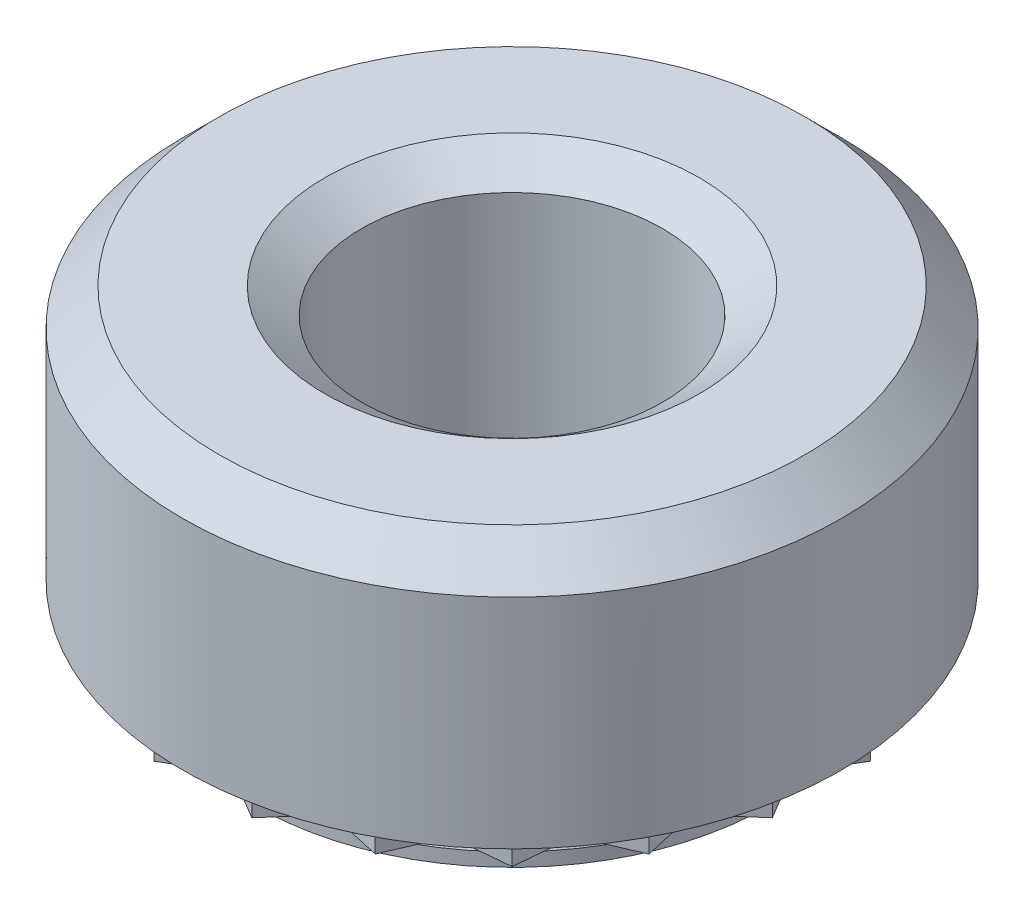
ISO-10303-21;
HEADER;
FILE_DESCRIPTION(('STEP AP214'),'2;1');
FILE_NAME('part.step','',(''),(''),'','','');
FILE_SCHEMA(('AUTOMOTIVE_DESIGN { 1 0 10303 214 1 1 1 1 }'));
ENDSEC;
DATA;
#1=APPLICATION_CONTEXT('core data for automotive mechanical design processes');
#2=APPLICATION_PROTOCOL_DEFINITION('international standard','automotive_design',2000,#1);
#3=PRODUCT_CONTEXT('',#1,'mechanical');
#4=PRODUCT('Part','Part','',(#3));
#5=PRODUCT_RELATED_PRODUCT_CATEGORY('part','',(#4));
#6=PRODUCT_DEFINITION_FORMATION('','',#4);
#7=PRODUCT_DEFINITION_CONTEXT('part definition',#1,'design');
#8=PRODUCT_DEFINITION('design','',#6,#7);
#9=PRODUCT_DEFINITION_SHAPE('','',#8);
#10=(LENGTH_UNIT() NAMED_UNIT(*) SI_UNIT(.MILLI.,.METRE.));
#11=(NAMED_UNIT(*) PLANE_ANGLE_UNIT() SI_UNIT($,.RADIAN.));
#12=(NAMED_UNIT(*) SI_UNIT($,.STERADIAN.) SOLID_ANGLE_UNIT());
#13=UNCERTAINTY_MEASURE_WITH_UNIT(LENGTH_MEASURE(1.E-05),#10,'distance_accuracy_value','');
#14=(GEOMETRIC_REPRESENTATION_CONTEXT(3) GLOBAL_UNCERTAINTY_ASSIGNED_CONTEXT((#13)) GLOBAL_UNIT_ASSIGNED_CONTEXT((#10,
#11,#12)) REPRESENTATION_CONTEXT('',''));
#15=CARTESIAN_POINT('',(0.,0.,0.));
#16=DIRECTION('',(0.,0.,1.));
#17=DIRECTION('',(1.,0.,0.));
#18=AXIS2_PLACEMENT_3D('',#15,#16,#17);
#19=CARTESIAN_POINT('',(4.0921354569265,0.,0.));
#20=DIRECTION('',(0.,-1.,0.));
#21=DIRECTION('',(0.,0.,-1.));
#22=AXIS2_PLACEMENT_3D('',#19,#20,#21);
#23=PLANE('',#22);
#24=CARTESIAN_POINT('',(0.,0.,0.));
#25=DIRECTION('',(0.,-1.,0.));
#26=DIRECTION('',(0.,0.,-1.));
#27=AXIS2_PLACEMENT_3D('',#24,#25,#26);
#28=CIRCLE('',#27,5.588);
#29=CARTESIAN_POINT('',(0.,0.,-5.588));
#30=VERTEX_POINT('',#29);
#31=EDGE_CURVE('E178',#30,#30,#28,.T.);
#32=ORIENTED_EDGE('',*,*,#31,.T.);
#33=EDGE_LOOP('',(#32));
#34=FACE_BOUND('',#33,.T.);
#35=DIRECTION('',(-0.859689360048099,0.,-0.5108171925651));
#36=VECTOR('',#35,1.);
#37=CARTESIAN_POINT('',(0.830448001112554,0.,5.24324232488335));
#38=LINE('',#37,#36);
#39=CARTESIAN_POINT('',(0.830448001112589,0.,5.24324232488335));
#40=VERTEX_POINT('',#39);
#41=CARTESIAN_POINT('',(0.,0.,4.7498));
#42=VERTEX_POINT('',#41);
#43=EDGE_CURVE('E70',#40,#42,#38,.T.);
#44=ORIENTED_EDGE('',*,*,#43,.F.);
#45=DIRECTION('',(-0.659761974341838,0.,0.751474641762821));
#46=VECTOR('',#45,1.);
#47=CARTESIAN_POINT('',(1.46776891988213,0.,4.51732824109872));
#48=LINE('',#47,#46);
#49=CARTESIAN_POINT('',(1.46776891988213,0.,4.51732824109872));
#50=VERTEX_POINT('',#49);
#51=EDGE_CURVE('E611',#50,#40,#48,.T.);
#52=ORIENTED_EDGE('',*,*,#51,.F.);
#53=DIRECTION('',(-0.975464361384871,0.,-0.220157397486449));
#54=VECTOR('',#53,1.);
#55=CARTESIAN_POINT('',(2.41005396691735,0.,4.72999723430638));
#56=LINE('',#55,#54);
#57=CARTESIAN_POINT('',(2.41005396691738,0.,4.72999723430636));
#58=VERTEX_POINT('',#57);
#59=EDGE_CURVE('E613',#58,#50,#56,.T.);
#60=ORIENTED_EDGE('',*,*,#59,.F.);
#61=DIRECTION('',(-0.395252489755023,0.,0.918572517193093));
#62=VECTOR('',#61,1.);
#63=CARTESIAN_POINT('',(2.79186239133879,0.,3.84266891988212));
#64=LINE('',#63,#62);
#65=CARTESIAN_POINT('',(2.79186239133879,0.,3.84266891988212));
#66=VERTEX_POINT('',#65);
#67=EDGE_CURVE('E638',#66,#58,#64,.T.);
#68=ORIENTED_EDGE('',*,*,#67,.F.);
#69=DIRECTION('',(-0.995754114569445,0.,0.0920529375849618));
#70=VECTOR('',#69,1.);
#71=CARTESIAN_POINT('',(3.7537470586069,0.,3.75374705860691));
#72=LINE('',#71,#70);
#73=CARTESIAN_POINT('',(3.75374705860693,0.,3.75374705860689));
#74=VERTEX_POINT('',#73);
#75=EDGE_CURVE('E641',#74,#66,#72,.T.);
#76=ORIENTED_EDGE('',*,*,#75,.F.);
#77=DIRECTION('',(-0.0920529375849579,0.,0.995754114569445));
#78=VECTOR('',#77,1.);
#79=CARTESIAN_POINT('',(3.84266891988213,0.,2.79186239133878));
#80=LINE('',#79,#78);
#81=CARTESIAN_POINT('',(3.84266891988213,0.,2.79186239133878));
#82=VERTEX_POINT('',#81);
#83=EDGE_CURVE('E672',#82,#74,#80,.T.);
#84=ORIENTED_EDGE('',*,*,#83,.F.);
#85=DIRECTION('',(-0.918572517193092,0.,0.395252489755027));
#86=VECTOR('',#85,1.);
#87=CARTESIAN_POINT('',(4.72999723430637,0.,2.41005396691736));
#88=LINE('',#87,#86);
#89=CARTESIAN_POINT('',(4.72999723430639,0.,2.41005396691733));
#90=VERTEX_POINT('',#89);
#91=EDGE_CURVE('E675',#90,#82,#88,.T.);
#92=ORIENTED_EDGE('',*,*,#91,.F.);
#93=DIRECTION('',(0.220157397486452,0.,0.97546436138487));
#94=VECTOR('',#93,1.);
#95=CARTESIAN_POINT('',(4.51732824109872,0.,1.46776891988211));
#96=LINE('',#95,#94);
#97=CARTESIAN_POINT('',(4.51732824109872,0.,1.46776891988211));
#98=VERTEX_POINT('',#97);
#99=EDGE_CURVE('E708',#98,#90,#96,.T.);
#100=ORIENTED_EDGE('',*,*,#99,.F.);
#101=DIRECTION('',(-0.751474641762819,0.,0.659761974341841));
#102=VECTOR('',#101,1.);
#103=CARTESIAN_POINT('',(5.24324232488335,0.,0.83044800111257));
#104=LINE('',#103,#102);
#105=CARTESIAN_POINT('',(5.24324232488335,0.,0.830448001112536));
#106=VERTEX_POINT('',#105);
#107=EDGE_CURVE('E711',#106,#98,#104,.T.);
#108=ORIENTED_EDGE('',*,*,#107,.F.);
#109=DIRECTION('',(0.510817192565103,0.,0.859689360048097));
#110=VECTOR('',#109,1.);
#111=CARTESIAN_POINT('',(4.7498,0.,0.));
#112=LINE('',#111,#110);
#113=CARTESIAN_POINT('',(4.7498,0.,0.));
#114=VERTEX_POINT('',#113);
#115=EDGE_CURVE('E744',#114,#106,#112,.T.);
#116=ORIENTED_EDGE('',*,*,#115,.F.);
#117=DIRECTION('',(-0.510817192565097,0.,0.8596893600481));
#118=VECTOR('',#117,1.);
#119=CARTESIAN_POINT('',(5.24324232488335,0.,-0.830448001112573));
#120=LINE('',#119,#118);
#121=CARTESIAN_POINT('',(5.24324232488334,0.,-0.830448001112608));
#122=VERTEX_POINT('',#121);
#123=EDGE_CURVE('E747',#122,#114,#120,.T.);
#124=ORIENTED_EDGE('',*,*,#123,.F.);
#125=DIRECTION('',(0.751474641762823,0.,0.659761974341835));
#126=VECTOR('',#125,1.);
#127=CARTESIAN_POINT('',(4.51732824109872,0.,-1.46776891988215));
#128=LINE('',#127,#126);
#129=CARTESIAN_POINT('',(4.51732824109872,0.,-1.46776891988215));
#130=VERTEX_POINT('',#129);
#131=EDGE_CURVE('E780',#130,#122,#128,.T.);
#132=ORIENTED_EDGE('',*,*,#131,.F.);
#133=DIRECTION('',(-0.220157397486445,0.,0.975464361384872));
#134=VECTOR('',#133,1.);
#135=CARTESIAN_POINT('',(4.72999723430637,0.,-2.41005396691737));
#136=LINE('',#135,#134);
#137=CARTESIAN_POINT('',(4.72999723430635,0.,-2.4100539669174));
#138=VERTEX_POINT('',#137);
#139=EDGE_CURVE('E783',#138,#130,#136,.T.);
#140=ORIENTED_EDGE('',*,*,#139,.F.);
#141=DIRECTION('',(0.918572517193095,0.,0.39525248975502));
#142=VECTOR('',#141,1.);
#143=CARTESIAN_POINT('',(3.84266891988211,0.,-2.79186239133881));
#144=LINE('',#143,#142);
#145=CARTESIAN_POINT('',(3.84266891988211,0.,-2.79186239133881));
#146=VERTEX_POINT('',#145);
#147=EDGE_CURVE('E816',#146,#138,#144,.T.);
#148=ORIENTED_EDGE('',*,*,#147,.F.);
#149=DIRECTION('',(0.0920529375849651,0.,0.995754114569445));
#150=VECTOR('',#149,1.);
#151=CARTESIAN_POINT('',(3.7537470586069,0.,-3.75374705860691));
#152=LINE('',#151,#150);
#153=CARTESIAN_POINT('',(3.75374705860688,0.,-3.75374705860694));
#154=VERTEX_POINT('',#153);
#155=EDGE_CURVE('E819',#154,#146,#152,.T.);
#156=ORIENTED_EDGE('',*,*,#155,.F.);
#157=DIRECTION('',(0.995754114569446,0.,0.0920529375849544));
#158=VECTOR('',#157,1.);
#159=CARTESIAN_POINT('',(2.79186239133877,0.,-3.84266891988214));
#160=LINE('',#159,#158);
#161=CARTESIAN_POINT('',(2.79186239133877,0.,-3.84266891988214));
#162=VERTEX_POINT('',#161);
#163=EDGE_CURVE('E852',#162,#154,#160,.T.);
#164=ORIENTED_EDGE('',*,*,#163,.F.);
#165=DIRECTION('',(0.39525248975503,0.,0.91857251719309));
#166=VECTOR('',#165,1.);
#167=CARTESIAN_POINT('',(2.41005396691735,0.,-4.72999723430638));
#168=LINE('',#167,#166);
#169=CARTESIAN_POINT('',(2.41005396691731,0.,-4.72999723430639));
#170=VERTEX_POINT('',#169);
#171=EDGE_CURVE('E855',#170,#162,#168,.T.);
#172=ORIENTED_EDGE('',*,*,#171,.F.);
#173=DIRECTION('',(0.975464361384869,0.,-0.220157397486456));
#174=VECTOR('',#173,1.);
#175=CARTESIAN_POINT('',(1.4677689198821,0.,-4.51732824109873));
#176=LINE('',#175,#174);
#177=CARTESIAN_POINT('',(1.4677689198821,0.,-4.51732824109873));
#178=VERTEX_POINT('',#177);
#179=EDGE_CURVE('E888',#178,#170,#176,.T.);
#180=ORIENTED_EDGE('',*,*,#179,.F.);
#181=DIRECTION('',(0.659761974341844,0.,0.751474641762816));
#182=VECTOR('',#181,1.);
#183=CARTESIAN_POINT('',(0.830448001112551,0.,-5.24324232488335));
#184=LINE('',#183,#182);
#185=CARTESIAN_POINT('',(0.830448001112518,0.,-5.24324232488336));
#186=VERTEX_POINT('',#185);
#187=EDGE_CURVE('E891',#186,#178,#184,.T.);
#188=ORIENTED_EDGE('',*,*,#187,.F.);
#189=DIRECTION('',(0.859689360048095,0.,-0.510817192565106));
#190=VECTOR('',#189,1.);
#191=CARTESIAN_POINT('',(0.,0.,-4.7498));
#192=LINE('',#191,#190);
#193=CARTESIAN_POINT('',(0.,0.,-4.7498));
#194=VERTEX_POINT('',#193);
#195=EDGE_CURVE('E924',#194,#186,#192,.T.);
#196=ORIENTED_EDGE('',*,*,#195,.F.);
#197=DIRECTION('',(0.859689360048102,0.,0.510817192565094));
#198=VECTOR('',#197,1.);
#199=CARTESIAN_POINT('',(-0.830448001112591,0.,-5.24324232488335));
#200=LINE('',#199,#198);
#201=CARTESIAN_POINT('',(-0.830448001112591,0.,-5.24324232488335));
#202=VERTEX_POINT('',#201);
#203=EDGE_CURVE('E927',#202,#194,#200,.T.);
#204=ORIENTED_EDGE('',*,*,#203,.F.);
#205=DIRECTION('',(0.659761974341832,0.,-0.751474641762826));
#206=VECTOR('',#205,1.);
#207=CARTESIAN_POINT('',(-1.46776891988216,0.,-4.51732824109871));
#208=LINE('',#207,#206);
#209=CARTESIAN_POINT('',(-1.46776891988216,0.,-4.51732824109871));
#210=VERTEX_POINT('',#209);
#211=EDGE_CURVE('E960',#210,#202,#208,.T.);
#212=ORIENTED_EDGE('',*,*,#211,.F.);
#213=DIRECTION('',(0.975464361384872,0.,0.220157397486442));
#214=VECTOR('',#213,1.);
#215=CARTESIAN_POINT('',(-2.41005396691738,0.,-4.72999723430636));
#216=LINE('',#215,#214);
#217=CARTESIAN_POINT('',(-2.41005396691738,0.,-4.72999723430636));
#218=VERTEX_POINT('',#217);
#219=EDGE_CURVE('E963',#218,#210,#216,.T.);
#220=ORIENTED_EDGE('',*,*,#219,.F.);
#221=DIRECTION('',(0.395252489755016,0.,-0.918572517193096));
#222=VECTOR('',#221,1.);
#223=CARTESIAN_POINT('',(-2.79186239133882,0.,-3.8426689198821));
#224=LINE('',#223,#222);
#225=CARTESIAN_POINT('',(-2.79186239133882,0.,-3.8426689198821));
#226=VERTEX_POINT('',#225);
#227=EDGE_CURVE('E996',#226,#218,#224,.T.);
#228=ORIENTED_EDGE('',*,*,#227,.F.);
#229=DIRECTION('',(0.995754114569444,0.,-0.0920529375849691));
#230=VECTOR('',#229,1.);
#231=CARTESIAN_POINT('',(-3.75374705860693,0.,-3.75374705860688));
#232=LINE('',#231,#230);
#233=CARTESIAN_POINT('',(-3.75374705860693,0.,-3.75374705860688));
#234=VERTEX_POINT('',#233);
#235=EDGE_CURVE('E999',#234,#226,#232,.T.);
#236=ORIENTED_EDGE('',*,*,#235,.F.);
#237=DIRECTION('',(0.0920529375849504,0.,-0.995754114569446));
#238=VECTOR('',#237,1.);
#239=CARTESIAN_POINT('',(-3.84266891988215,0.,-2.79186239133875));
#240=LINE('',#239,#238);
#241=CARTESIAN_POINT('',(-3.84266891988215,0.,-2.79186239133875));
#242=VERTEX_POINT('',#241);
#243=EDGE_CURVE('E1032',#242,#234,#240,.T.);
#244=ORIENTED_EDGE('',*,*,#243,.F.);
#245=DIRECTION('',(0.918572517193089,0.,-0.395252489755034));
#246=VECTOR('',#245,1.);
#247=CARTESIAN_POINT('',(-4.72999723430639,0.,-2.41005396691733));
#248=LINE('',#247,#246);
#249=CARTESIAN_POINT('',(-4.72999723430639,0.,-2.41005396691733));
#250=VERTEX_POINT('',#249);
#251=EDGE_CURVE('E1035',#250,#242,#248,.T.);
#252=ORIENTED_EDGE('',*,*,#251,.F.);
#253=DIRECTION('',(-0.220157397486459,0.,-0.975464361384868));
#254=VECTOR('',#253,1.);
#255=CARTESIAN_POINT('',(-4.51732824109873,0.,-1.46776891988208));
#256=LINE('',#255,#254);
#257=CARTESIAN_POINT('',(-4.51732824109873,0.,-1.46776891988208));
#258=VERTEX_POINT('',#257);
#259=EDGE_CURVE('E1068',#258,#250,#256,.T.);
#260=ORIENTED_EDGE('',*,*,#259,.F.);
#261=DIRECTION('',(0.751474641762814,0.,-0.659761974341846));
#262=VECTOR('',#261,1.);
#263=CARTESIAN_POINT('',(-5.24324232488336,0.,-0.830448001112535));
#264=LINE('',#263,#262);
#265=CARTESIAN_POINT('',(-5.24324232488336,0.,-0.830448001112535));
#266=VERTEX_POINT('',#265);
#267=EDGE_CURVE('E1071',#266,#258,#264,.T.);
#268=ORIENTED_EDGE('',*,*,#267,.F.);
#269=DIRECTION('',(-0.510817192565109,0.,-0.859689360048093));
#270=VECTOR('',#269,1.);
#271=CARTESIAN_POINT('',(-4.7498,0.,0.));
#272=LINE('',#271,#270);
#273=CARTESIAN_POINT('',(-4.7498,0.,0.));
#274=VERTEX_POINT('',#273);
#275=EDGE_CURVE('E1104',#274,#266,#272,.T.);
#276=ORIENTED_EDGE('',*,*,#275,.F.);
#277=DIRECTION('',(0.510817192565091,0.,-0.859689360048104));
#278=VECTOR('',#277,1.);
#279=CARTESIAN_POINT('',(-5.24324232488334,0.,0.830448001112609));
#280=LINE('',#279,#278);
#281=CARTESIAN_POINT('',(-5.24324232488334,0.,0.830448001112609));
#282=VERTEX_POINT('',#281);
#283=EDGE_CURVE('E1107',#282,#274,#280,.T.);
#284=ORIENTED_EDGE('',*,*,#283,.F.);
#285=DIRECTION('',(-0.751474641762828,0.,-0.65976197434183));
#286=VECTOR('',#285,1.);
#287=CARTESIAN_POINT('',(-4.5173282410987,0.,1.46776891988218));
#288=LINE('',#287,#286);
#289=CARTESIAN_POINT('',(-4.5173282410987,0.,1.46776891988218));
#290=VERTEX_POINT('',#289);
#291=EDGE_CURVE('E1140',#290,#282,#288,.T.);
#292=ORIENTED_EDGE('',*,*,#291,.F.);
#293=DIRECTION('',(0.220157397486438,0.,-0.975464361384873));
#294=VECTOR('',#293,1.);
#295=CARTESIAN_POINT('',(-4.72999723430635,0.,2.4100539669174));
#296=LINE('',#295,#294);
#297=CARTESIAN_POINT('',(-4.72999723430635,0.,2.4100539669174));
#298=VERTEX_POINT('',#297);
#299=EDGE_CURVE('E1143',#298,#290,#296,.T.);
#300=ORIENTED_EDGE('',*,*,#299,.F.);
#301=DIRECTION('',(-0.918572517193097,0.,-0.395252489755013));
#302=VECTOR('',#301,1.);
#303=CARTESIAN_POINT('',(-3.84266891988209,0.,2.79186239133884));
#304=LINE('',#303,#302);
#305=CARTESIAN_POINT('',(-3.84266891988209,0.,2.79186239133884));
#306=VERTEX_POINT('',#305);
#307=EDGE_CURVE('E1176',#306,#298,#304,.T.);
#308=ORIENTED_EDGE('',*,*,#307,.F.);
#309=DIRECTION('',(-0.0920529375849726,0.,-0.995754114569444));
#310=VECTOR('',#309,1.);
#311=CARTESIAN_POINT('',(-3.75374705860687,0.,3.75374705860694));
#312=LINE('',#311,#310);
#313=CARTESIAN_POINT('',(-3.75374705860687,0.,3.75374705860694));
#314=VERTEX_POINT('',#313);
#315=EDGE_CURVE('E1179',#314,#306,#312,.T.);
#316=ORIENTED_EDGE('',*,*,#315,.F.);
#317=DIRECTION('',(-0.995754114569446,0.,-0.0920529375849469));
#318=VECTOR('',#317,1.);
#319=CARTESIAN_POINT('',(-2.79186239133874,0.,3.84266891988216));
#320=LINE('',#319,#318);
#321=CARTESIAN_POINT('',(-2.79186239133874,0.,3.84266891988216));
#322=VERTEX_POINT('',#321);
#323=EDGE_CURVE('E1212',#322,#314,#320,.T.);
#324=ORIENTED_EDGE('',*,*,#323,.F.);
#325=DIRECTION('',(-0.395252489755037,0.,-0.918572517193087));
#326=VECTOR('',#325,1.);
#327=CARTESIAN_POINT('',(-2.41005396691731,0.,4.72999723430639));
#328=LINE('',#327,#326);
#329=CARTESIAN_POINT('',(-2.41005396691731,0.,4.72999723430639));
#330=VERTEX_POINT('',#329);
#331=EDGE_CURVE('E1215',#330,#322,#328,.T.);
#332=ORIENTED_EDGE('',*,*,#331,.F.);
#333=DIRECTION('',(-0.975464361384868,0.,0.220157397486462));
#334=VECTOR('',#333,1.);
#335=CARTESIAN_POINT('',(-1.46776891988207,0.,4.51732824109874));
#336=LINE('',#335,#334);
#337=CARTESIAN_POINT('',(-1.46776891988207,0.,4.51732824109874));
#338=VERTEX_POINT('',#337);
#339=EDGE_CURVE('E1235',#338,#330,#336,.T.);
#340=ORIENTED_EDGE('',*,*,#339,.F.);
#341=DIRECTION('',(-0.659761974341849,0.,-0.751474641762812));
#342=VECTOR('',#341,1.);
#343=CARTESIAN_POINT('',(-0.830448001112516,0.,5.24324232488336));
#344=LINE('',#343,#342);
#345=CARTESIAN_POINT('',(-0.830448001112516,0.,5.24324232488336));
#346=VERTEX_POINT('',#345);
#347=EDGE_CURVE('E1238',#346,#338,#344,.T.);
#348=ORIENTED_EDGE('',*,*,#347,.F.);
#349=DIRECTION('',(-0.859689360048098,0.,0.5108171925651));
#350=VECTOR('',#349,1.);
#351=CARTESIAN_POINT('',(0.,0.,4.7498));
#352=LINE('',#351,#350);
#353=EDGE_CURVE('E589',#42,#346,#352,.T.);
#354=ORIENTED_EDGE('',*,*,#353,.F.);
#355=EDGE_LOOP('',(#44,#52,#60,#68,#76,#84,#92,#100,#108,#116,#124,#132,#140,#148,#156,#164,
#172,#180,#188,#196,#204,#212,#220,#228,#236,#244,#252,#260,#268,#276,#284,#292,#300,#308,#316,
#324,#332,#340,#348,#354));
#356=FACE_BOUND('',#355,.T.);
#357=ADVANCED_FACE('F33',(#34,#356),#23,.T.);
#358=CARTESIAN_POINT('',(0.,0.,0.));
#359=DIRECTION('',(0.,-1.,0.));
#360=DIRECTION('',(0.,0.,-1.));
#361=AXIS2_PLACEMENT_3D('',#358,#359,#360);
#362=CIRCLE('',#361,4.0921354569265);
#363=CARTESIAN_POINT('',(0.,0.,-4.0921354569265));
#364=VERTEX_POINT('',#363);
#365=EDGE_CURVE('E175',#364,#364,#362,.T.);
#366=ORIENTED_EDGE('',*,*,#365,.F.);
#367=EDGE_LOOP('',(#366));
#368=FACE_BOUND('',#367,.T.);
#369=DIRECTION('',(0.975464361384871,0.,0.220157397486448));
#370=VECTOR('',#369,1.);
#371=CARTESIAN_POINT('',(1.40905816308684,0.,4.33663511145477));
#372=LINE('',#371,#370);
#373=CARTESIAN_POINT('',(1.40905816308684,0.,4.33663511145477));
#374=VERTEX_POINT('',#373);
#375=CARTESIAN_POINT('',(2.31365180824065,0.,4.54079734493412));
#376=VERTEX_POINT('',#375);
#377=EDGE_CURVE('E104',#374,#376,#372,.T.);
#378=ORIENTED_EDGE('',*,*,#377,.F.);
#379=DIRECTION('',(0.659761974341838,0.,-0.751474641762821));
#380=VECTOR('',#379,1.);
#381=CARTESIAN_POINT('',(0.797230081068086,0.,5.03351263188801));
#382=LINE('',#381,#380);
#383=CARTESIAN_POINT('',(0.797230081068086,0.,5.03351263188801));
#384=VERTEX_POINT('',#383);
#385=EDGE_CURVE('E609',#384,#374,#382,.T.);
#386=ORIENTED_EDGE('',*,*,#385,.F.);
#387=DIRECTION('',(0.859689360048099,0.,0.5108171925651));
#388=VECTOR('',#387,1.);
#389=CARTESIAN_POINT('',(0.,0.,4.559808));
#390=LINE('',#389,#388);
#391=CARTESIAN_POINT('',(0.,0.,4.559808));
#392=VERTEX_POINT('',#391);
#393=EDGE_CURVE('E138',#392,#384,#390,.T.);
#394=ORIENTED_EDGE('',*,*,#393,.F.);
#395=DIRECTION('',(0.859689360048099,0.,-0.5108171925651));
#396=VECTOR('',#395,1.);
#397=CARTESIAN_POINT('',(-0.797230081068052,0.,5.03351263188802));
#398=LINE('',#397,#396);
#399=CARTESIAN_POINT('',(-0.797230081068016,0.,5.03351263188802));
#400=VERTEX_POINT('',#399);
#401=EDGE_CURVE('E588',#400,#392,#398,.T.);
#402=ORIENTED_EDGE('',*,*,#401,.F.);
#403=DIRECTION('',(0.659761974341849,0.,0.751474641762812));
#404=VECTOR('',#403,1.);
#405=CARTESIAN_POINT('',(-1.40905816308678,0.,4.33663511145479));
#406=LINE('',#405,#404);
#407=CARTESIAN_POINT('',(-1.40905816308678,0.,4.33663511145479));
#408=VERTEX_POINT('',#407);
#409=EDGE_CURVE('E575',#408,#400,#406,.T.);
#410=ORIENTED_EDGE('',*,*,#409,.F.);
#411=DIRECTION('',(0.975464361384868,0.,-0.220157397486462));
#412=VECTOR('',#411,1.);
#413=CARTESIAN_POINT('',(-2.31365180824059,0.,4.54079734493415));
#414=LINE('',#413,#412);
#415=CARTESIAN_POINT('',(-2.31365180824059,0.,4.54079734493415));
#416=VERTEX_POINT('',#415);
#417=EDGE_CURVE('E586',#416,#408,#414,.T.);
#418=ORIENTED_EDGE('',*,*,#417,.F.);
#419=DIRECTION('',(0.395252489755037,0.,0.918572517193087));
#420=VECTOR('',#419,1.);
#421=CARTESIAN_POINT('',(-2.68018789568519,0.,3.68896216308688));
#422=LINE('',#421,#420);
#423=CARTESIAN_POINT('',(-2.68018789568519,0.,3.68896216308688));
#424=VERTEX_POINT('',#423);
#425=EDGE_CURVE('E1205',#424,#416,#422,.T.);
#426=ORIENTED_EDGE('',*,*,#425,.F.);
#427=DIRECTION('',(0.995754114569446,0.,0.0920529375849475));
#428=VECTOR('',#427,1.);
#429=CARTESIAN_POINT('',(-3.60359717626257,0.,3.60359717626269));
#430=LINE('',#429,#428);
#431=CARTESIAN_POINT('',(-3.60359717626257,0.,3.60359717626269));
#432=VERTEX_POINT('',#431);
#433=EDGE_CURVE('E1209',#432,#424,#430,.T.);
#434=ORIENTED_EDGE('',*,*,#433,.F.);
#435=DIRECTION('',(0.0920529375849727,0.,0.995754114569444));
#436=VECTOR('',#435,1.);
#437=CARTESIAN_POINT('',(-3.68896216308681,0.,2.68018789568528));
#438=LINE('',#437,#436);
#439=CARTESIAN_POINT('',(-3.68896216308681,0.,2.68018789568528));
#440=VERTEX_POINT('',#439);
#441=EDGE_CURVE('E1169',#440,#432,#438,.T.);
#442=ORIENTED_EDGE('',*,*,#441,.F.);
#443=DIRECTION('',(0.918572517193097,0.,0.395252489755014));
#444=VECTOR('',#443,1.);
#445=CARTESIAN_POINT('',(-4.54079734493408,0.,2.31365180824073));
#446=LINE('',#445,#444);
#447=CARTESIAN_POINT('',(-4.54079734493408,0.,2.31365180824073));
#448=VERTEX_POINT('',#447);
#449=EDGE_CURVE('E1173',#448,#440,#446,.T.);
#450=ORIENTED_EDGE('',*,*,#449,.F.);
#451=DIRECTION('',(-0.220157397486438,0.,0.975464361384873));
#452=VECTOR('',#451,1.);
#453=CARTESIAN_POINT('',(-4.33663511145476,0.,1.40905816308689));
#454=LINE('',#453,#452);
#455=CARTESIAN_POINT('',(-4.33663511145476,0.,1.40905816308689));
#456=VERTEX_POINT('',#455);
#457=EDGE_CURVE('E1133',#456,#448,#454,.T.);
#458=ORIENTED_EDGE('',*,*,#457,.F.);
#459=DIRECTION('',(0.751474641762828,0.,0.65976197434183));
#460=VECTOR('',#459,1.);
#461=CARTESIAN_POINT('',(-5.03351263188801,0.,0.797230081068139));
#462=LINE('',#461,#460);
#463=CARTESIAN_POINT('',(-5.03351263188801,0.,0.797230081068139));
#464=VERTEX_POINT('',#463);
#465=EDGE_CURVE('E1137',#464,#456,#462,.T.);
#466=ORIENTED_EDGE('',*,*,#465,.F.);
#467=DIRECTION('',(-0.510817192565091,0.,0.859689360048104));
#468=VECTOR('',#467,1.);
#469=CARTESIAN_POINT('',(-4.559808,0.,0.));
#470=LINE('',#469,#468);
#471=CARTESIAN_POINT('',(-4.559808,0.,0.));
#472=VERTEX_POINT('',#471);
#473=EDGE_CURVE('E1097',#472,#464,#470,.T.);
#474=ORIENTED_EDGE('',*,*,#473,.F.);
#475=DIRECTION('',(0.510817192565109,0.,0.859689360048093));
#476=VECTOR('',#475,1.);
#477=CARTESIAN_POINT('',(-5.03351263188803,0.,-0.797230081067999));
#478=LINE('',#477,#476);
#479=CARTESIAN_POINT('',(-5.03351263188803,0.,-0.797230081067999));
#480=VERTEX_POINT('',#479);
#481=EDGE_CURVE('E1101',#480,#472,#478,.T.);
#482=ORIENTED_EDGE('',*,*,#481,.F.);
#483=DIRECTION('',(-0.751474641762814,0.,0.659761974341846));
#484=VECTOR('',#483,1.);
#485=CARTESIAN_POINT('',(-4.33663511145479,0.,-1.4090581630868));
#486=LINE('',#485,#484);
#487=CARTESIAN_POINT('',(-4.33663511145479,0.,-1.4090581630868));
#488=VERTEX_POINT('',#487);
#489=EDGE_CURVE('E1061',#488,#480,#486,.T.);
#490=ORIENTED_EDGE('',*,*,#489,.F.);
#491=DIRECTION('',(0.220157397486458,0.,0.975464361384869));
#492=VECTOR('',#491,1.);
#493=CARTESIAN_POINT('',(-4.54079734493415,0.,-2.31365180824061));
#494=LINE('',#493,#492);
#495=CARTESIAN_POINT('',(-4.54079734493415,0.,-2.31365180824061));
#496=VERTEX_POINT('',#495);
#497=EDGE_CURVE('E1065',#496,#488,#494,.T.);
#498=ORIENTED_EDGE('',*,*,#497,.F.);
#499=DIRECTION('',(-0.918572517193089,0.,0.395252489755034));
#500=VECTOR('',#499,1.);
#501=CARTESIAN_POINT('',(-3.68896216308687,0.,-2.6801878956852));
#502=LINE('',#501,#500);
#503=CARTESIAN_POINT('',(-3.68896216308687,0.,-2.6801878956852));
#504=VERTEX_POINT('',#503);
#505=EDGE_CURVE('E1025',#504,#496,#502,.T.);
#506=ORIENTED_EDGE('',*,*,#505,.F.);
#507=DIRECTION('',(-0.0920529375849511,0.,0.995754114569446));
#508=VECTOR('',#507,1.);
#509=CARTESIAN_POINT('',(-3.60359717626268,0.,-3.60359717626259));
#510=LINE('',#509,#508);
#511=CARTESIAN_POINT('',(-3.60359717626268,0.,-3.60359717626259));
#512=VERTEX_POINT('',#511);
#513=EDGE_CURVE('E1029',#512,#504,#510,.T.);
#514=ORIENTED_EDGE('',*,*,#513,.F.);
#515=DIRECTION('',(-0.995754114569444,0.,0.0920529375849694));
#516=VECTOR('',#515,1.);
#517=CARTESIAN_POINT('',(-2.68018789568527,0.,-3.68896216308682));
#518=LINE('',#517,#516);
#519=CARTESIAN_POINT('',(-2.68018789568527,0.,-3.68896216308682));
#520=VERTEX_POINT('',#519);
#521=EDGE_CURVE('E989',#520,#512,#518,.T.);
#522=ORIENTED_EDGE('',*,*,#521,.F.);
#523=DIRECTION('',(-0.395252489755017,0.,0.918572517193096));
#524=VECTOR('',#523,1.);
#525=CARTESIAN_POINT('',(-2.31365180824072,0.,-4.54079734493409));
#526=LINE('',#525,#524);
#527=CARTESIAN_POINT('',(-2.31365180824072,0.,-4.54079734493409));
#528=VERTEX_POINT('',#527);
#529=EDGE_CURVE('E993',#528,#520,#526,.T.);
#530=ORIENTED_EDGE('',*,*,#529,.F.);
#531=DIRECTION('',(-0.975464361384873,0.,-0.220157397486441));
#532=VECTOR('',#531,1.);
#533=CARTESIAN_POINT('',(-1.40905816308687,0.,-4.33663511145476));
#534=LINE('',#533,#532);
#535=CARTESIAN_POINT('',(-1.40905816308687,0.,-4.33663511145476));
#536=VERTEX_POINT('',#535);
#537=EDGE_CURVE('E953',#536,#528,#534,.T.);
#538=ORIENTED_EDGE('',*,*,#537,.F.);
#539=DIRECTION('',(-0.659761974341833,0.,0.751474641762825));
#540=VECTOR('',#539,1.);
#541=CARTESIAN_POINT('',(-0.797230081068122,0.,-5.03351263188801));
#542=LINE('',#541,#540);
#543=CARTESIAN_POINT('',(-0.797230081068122,0.,-5.03351263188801));
#544=VERTEX_POINT('',#543);
#545=EDGE_CURVE('E957',#544,#536,#542,.T.);
#546=ORIENTED_EDGE('',*,*,#545,.F.);
#547=DIRECTION('',(-0.859689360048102,0.,-0.510817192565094));
#548=VECTOR('',#547,1.);
#549=CARTESIAN_POINT('',(0.,0.,-4.559808));
#550=LINE('',#549,#548);
#551=CARTESIAN_POINT('',(0.,0.,-4.559808));
#552=VERTEX_POINT('',#551);
#553=EDGE_CURVE('E917',#552,#544,#550,.T.);
#554=ORIENTED_EDGE('',*,*,#553,.F.);
#555=DIRECTION('',(-0.859689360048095,0.,0.510817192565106));
#556=VECTOR('',#555,1.);
#557=CARTESIAN_POINT('',(0.797230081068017,0.,-5.03351263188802));
#558=LINE('',#557,#556);
#559=CARTESIAN_POINT('',(0.797230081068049,0.,-5.03351263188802));
#560=VERTEX_POINT('',#559);
#561=EDGE_CURVE('E921',#560,#552,#558,.T.);
#562=ORIENTED_EDGE('',*,*,#561,.F.);
#563=DIRECTION('',(-0.659761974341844,0.,-0.751474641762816));
#564=VECTOR('',#563,1.);
#565=CARTESIAN_POINT('',(1.40905816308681,0.,-4.33663511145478));
#566=LINE('',#565,#564);
#567=CARTESIAN_POINT('',(1.40905816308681,0.,-4.33663511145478));
#568=VERTEX_POINT('',#567);
#569=EDGE_CURVE('E881',#568,#560,#566,.T.);
#570=ORIENTED_EDGE('',*,*,#569,.F.);
#571=DIRECTION('',(-0.975464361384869,0.,0.220157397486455));
#572=VECTOR('',#571,1.);
#573=CARTESIAN_POINT('',(2.31365180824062,0.,-4.54079734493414));
#574=LINE('',#573,#572);
#575=CARTESIAN_POINT('',(2.31365180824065,0.,-4.54079734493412));
#576=VERTEX_POINT('',#575);
#577=EDGE_CURVE('E885',#576,#568,#574,.T.);
#578=ORIENTED_EDGE('',*,*,#577,.F.);
#579=DIRECTION('',(-0.39525248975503,0.,-0.91857251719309));
#580=VECTOR('',#579,1.);
#581=CARTESIAN_POINT('',(2.68018789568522,0.,-3.68896216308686));
#582=LINE('',#581,#580);
#583=CARTESIAN_POINT('',(2.68018789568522,0.,-3.68896216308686));
#584=VERTEX_POINT('',#583);
#585=EDGE_CURVE('E845',#584,#576,#582,.T.);
#586=ORIENTED_EDGE('',*,*,#585,.F.);
#587=DIRECTION('',(-0.995754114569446,0.,-0.092052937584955));
#588=VECTOR('',#587,1.);
#589=CARTESIAN_POINT('',(3.6035971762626,0.,-3.60359717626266));
#590=LINE('',#589,#588);
#591=CARTESIAN_POINT('',(3.60359717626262,0.,-3.60359717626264));
#592=VERTEX_POINT('',#591);
#593=EDGE_CURVE('E849',#592,#584,#590,.T.);
#594=ORIENTED_EDGE('',*,*,#593,.F.);
#595=DIRECTION('',(-0.0920529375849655,0.,-0.995754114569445));
#596=VECTOR('',#595,1.);
#597=CARTESIAN_POINT('',(3.68896216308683,0.,-2.68018789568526));
#598=LINE('',#597,#596);
#599=CARTESIAN_POINT('',(3.68896216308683,0.,-2.68018789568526));
#600=VERTEX_POINT('',#599);
#601=EDGE_CURVE('E809',#600,#592,#598,.T.);
#602=ORIENTED_EDGE('',*,*,#601,.F.);
#603=DIRECTION('',(-0.918572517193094,0.,-0.39525248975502));
#604=VECTOR('',#603,1.);
#605=CARTESIAN_POINT('',(4.5407973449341,0.,-2.3136518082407));
#606=LINE('',#605,#604);
#607=CARTESIAN_POINT('',(4.54079734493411,0.,-2.31365180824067));
#608=VERTEX_POINT('',#607);
#609=EDGE_CURVE('E813',#608,#600,#606,.T.);
#610=ORIENTED_EDGE('',*,*,#609,.F.);
#611=DIRECTION('',(0.220157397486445,0.,-0.975464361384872));
#612=VECTOR('',#611,1.);
#613=CARTESIAN_POINT('',(4.33663511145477,0.,-1.40905816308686));
#614=LINE('',#613,#612);
#615=CARTESIAN_POINT('',(4.33663511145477,0.,-1.40905816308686));
#616=VERTEX_POINT('',#615);
#617=EDGE_CURVE('E773',#616,#608,#614,.T.);
#618=ORIENTED_EDGE('',*,*,#617,.F.);
#619=DIRECTION('',(-0.751474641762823,0.,-0.659761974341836));
#620=VECTOR('',#619,1.);
#621=CARTESIAN_POINT('',(5.03351263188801,0.,-0.797230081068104));
#622=LINE('',#621,#620);
#623=CARTESIAN_POINT('',(5.03351263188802,0.,-0.79723008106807));
#624=VERTEX_POINT('',#623);
#625=EDGE_CURVE('E777',#624,#616,#622,.T.);
#626=ORIENTED_EDGE('',*,*,#625,.F.);
#627=DIRECTION('',(0.510817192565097,0.,-0.859689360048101));
#628=VECTOR('',#627,1.);
#629=CARTESIAN_POINT('',(4.559808,0.,0.));
#630=LINE('',#629,#628);
#631=CARTESIAN_POINT('',(4.559808,0.,0.));
#632=VERTEX_POINT('',#631);
#633=EDGE_CURVE('E737',#632,#624,#630,.T.);
#634=ORIENTED_EDGE('',*,*,#633,.F.);
#635=DIRECTION('',(-0.510817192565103,0.,-0.859689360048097));
#636=VECTOR('',#635,1.);
#637=CARTESIAN_POINT('',(5.03351263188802,0.,0.797230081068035));
#638=LINE('',#637,#636);
#639=CARTESIAN_POINT('',(5.03351263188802,0.,0.797230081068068));
#640=VERTEX_POINT('',#639);
#641=EDGE_CURVE('E741',#640,#632,#638,.T.);
#642=ORIENTED_EDGE('',*,*,#641,.F.);
#643=DIRECTION('',(0.751474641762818,0.,-0.659761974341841));
#644=VECTOR('',#643,1.);
#645=CARTESIAN_POINT('',(4.33663511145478,0.,1.40905816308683));
#646=LINE('',#645,#644);
#647=CARTESIAN_POINT('',(4.33663511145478,0.,1.40905816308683));
#648=VERTEX_POINT('',#647);
#649=EDGE_CURVE('E701',#648,#640,#646,.T.);
#650=ORIENTED_EDGE('',*,*,#649,.F.);
#651=DIRECTION('',(-0.220157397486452,0.,-0.97546436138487));
#652=VECTOR('',#651,1.);
#653=CARTESIAN_POINT('',(4.54079734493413,0.,2.31365180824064));
#654=LINE('',#653,#652);
#655=CARTESIAN_POINT('',(4.54079734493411,0.,2.31365180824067));
#656=VERTEX_POINT('',#655);
#657=EDGE_CURVE('E705',#656,#648,#654,.T.);
#658=ORIENTED_EDGE('',*,*,#657,.F.);
#659=DIRECTION('',(0.918572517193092,0.,-0.395252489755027));
#660=VECTOR('',#659,1.);
#661=CARTESIAN_POINT('',(3.68896216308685,0.,2.68018789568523));
#662=LINE('',#661,#660);
#663=CARTESIAN_POINT('',(3.68896216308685,0.,2.68018789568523));
#664=VERTEX_POINT('',#663);
#665=EDGE_CURVE('E665',#664,#656,#662,.T.);
#666=ORIENTED_EDGE('',*,*,#665,.F.);
#667=DIRECTION('',(0.0920529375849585,0.,-0.995754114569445));
#668=VECTOR('',#667,1.);
#669=CARTESIAN_POINT('',(3.60359717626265,0.,3.60359717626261));
#670=LINE('',#669,#668);
#671=CARTESIAN_POINT('',(3.60359717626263,0.,3.60359717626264));
#672=VERTEX_POINT('',#671);
#673=EDGE_CURVE('E669',#672,#664,#670,.T.);
#674=ORIENTED_EDGE('',*,*,#673,.F.);
#675=DIRECTION('',(0.995754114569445,0.,-0.092052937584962));
#676=VECTOR('',#675,1.);
#677=CARTESIAN_POINT('',(2.68018789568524,0.,3.68896216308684));
#678=LINE('',#677,#676);
#679=CARTESIAN_POINT('',(2.68018789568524,0.,3.68896216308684));
#680=VERTEX_POINT('',#679);
#681=EDGE_CURVE('E631',#680,#672,#678,.T.);
#682=ORIENTED_EDGE('',*,*,#681,.F.);
#683=DIRECTION('',(0.395252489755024,0.,-0.918572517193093));
#684=VECTOR('',#683,1.);
#685=CARTESIAN_POINT('',(2.31365180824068,0.,4.54079734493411));
#686=LINE('',#685,#684);
#687=EDGE_CURVE('E635',#376,#680,#686,.T.);
#688=ORIENTED_EDGE('',*,*,#687,.F.);
#689=EDGE_LOOP('',(#378,#386,#394,#402,#410,#418,#426,#434,#442,#450,#458,#466,#474,#482,#490,
#498,#506,#514,#522,#530,#538,#546,#554,#562,#570,#578,#586,#594,#602,#610,#618,#626,#634,#642,
#650,#658,#666,#674,#682,#688));
#690=FACE_BOUND('',#689,.T.);
#691=ADVANCED_FACE('F203',(#368,#690),#23,.T.);
#692=CARTESIAN_POINT('',(0.,0.,0.));
#693=DIRECTION('',(0.,-1.,0.));
#694=DIRECTION('',(0.,0.,-1.));
#695=AXIS2_PLACEMENT_3D('',#692,#693,#694);
#696=CYLINDRICAL_SURFACE('',#695,5.588);
#697=CARTESIAN_POINT('',(0.,3.6957,0.));
#698=DIRECTION('',(0.,1.,0.));
#699=DIRECTION('',(0.,0.,1.));
#700=AXIS2_PLACEMENT_3D('',#697,#698,#699);
#701=CIRCLE('',#700,5.588);
#702=CARTESIAN_POINT('',(0.,3.6957,5.588));
#703=VERTEX_POINT('',#702);
#704=EDGE_CURVE('E42',#703,#703,#701,.F.);
#705=ORIENTED_EDGE('',*,*,#704,.T.);
#706=EDGE_LOOP('',(#705));
#707=FACE_BOUND('',#706,.T.);
#708=ORIENTED_EDGE('',*,*,#31,.F.);
#709=EDGE_LOOP('',(#708));
#710=FACE_BOUND('',#709,.T.);
#711=ADVANCED_FACE('F184',(#707,#710),#696,.T.);
#712=CARTESIAN_POINT('',(0.,0.,0.));
#713=DIRECTION('',(0.,-1.,0.));
#714=DIRECTION('',(0.,0.,-1.));
#715=AXIS2_PLACEMENT_3D('',#712,#713,#714);
#716=CYLINDRICAL_SURFACE('',#715,4.0921354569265);
#717=ORIENTED_EDGE('',*,*,#365,.T.);
#718=EDGE_LOOP('',(#717));
#719=FACE_BOUND('',#718,.T.);
#720=CARTESIAN_POINT('',(0.,-0.4572,0.));
#721=DIRECTION('',(0.,-1.,0.));
#722=DIRECTION('',(0.,0.,-1.));
#723=AXIS2_PLACEMENT_3D('',#720,#721,#722);
#724=CIRCLE('',#723,4.0921354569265);
#725=CARTESIAN_POINT('',(0.,-0.4572,-4.0921354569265));
#726=VERTEX_POINT('',#725);
#727=EDGE_CURVE('E172',#726,#726,#724,.T.);
#728=ORIENTED_EDGE('',*,*,#727,.F.);
#729=EDGE_LOOP('',(#728));
#730=FACE_BOUND('',#729,.T.);
#731=ADVANCED_FACE('F212',(#719,#730),#716,.T.);
#732=CARTESIAN_POINT('',(0.,-0.9144,0.));
#733=DIRECTION('',(0.,-1.,0.));
#734=DIRECTION('',(0.,0.,-1.));
#735=AXIS2_PLACEMENT_3D('',#732,#733,#734);
#736=CONICAL_SURFACE('',#735,4.3561,0.523598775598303);
#737=ORIENTED_EDGE('',*,*,#727,.T.);
#738=EDGE_LOOP('',(#737));
#739=FACE_BOUND('',#738,.T.);
#740=CARTESIAN_POINT('',(0.,-0.9144,0.));
#741=DIRECTION('',(0.,-1.,0.));
#742=DIRECTION('',(0.,0.,-1.));
#743=AXIS2_PLACEMENT_3D('',#740,#741,#742);
#744=CIRCLE('',#743,4.3561);
#745=CARTESIAN_POINT('',(0.,-0.9144,-4.3561));
#746=VERTEX_POINT('',#745);
#747=EDGE_CURVE('E169',#746,#746,#744,.T.);
#748=ORIENTED_EDGE('',*,*,#747,.F.);
#749=EDGE_LOOP('',(#748));
#750=FACE_BOUND('',#749,.T.);
#751=ADVANCED_FACE('F218',(#739,#750),#736,.T.);
#752=CARTESIAN_POINT('',(0.,0.,0.));
#753=DIRECTION('',(0.,-1.,0.));
#754=DIRECTION('',(0.,0.,-1.));
#755=AXIS2_PLACEMENT_3D('',#752,#753,#754);
#756=CYLINDRICAL_SURFACE('',#755,4.3561);
#757=ORIENTED_EDGE('',*,*,#747,.T.);
#758=EDGE_LOOP('',(#757));
#759=FACE_BOUND('',#758,.T.);
#760=CARTESIAN_POINT('',(0.,-1.143,0.));
#761=DIRECTION('',(0.,-1.,0.));
#762=DIRECTION('',(0.,0.,-1.));
#763=AXIS2_PLACEMENT_3D('',#760,#761,#762);
#764=CIRCLE('',#763,4.3561);
#765=CARTESIAN_POINT('',(0.,-1.143,-4.3561));
#766=VERTEX_POINT('',#765);
#767=EDGE_CURVE('E166',#766,#766,#764,.T.);
#768=ORIENTED_EDGE('',*,*,#767,.F.);
#769=EDGE_LOOP('',(#768));
#770=FACE_BOUND('',#769,.T.);
#771=ADVANCED_FACE('F223',(#759,#770),#756,.T.);
#772=CARTESIAN_POINT('',(2.5527,-1.143,0.));
#773=DIRECTION('',(0.,-1.,0.));
#774=DIRECTION('',(0.,0.,-1.));
#775=AXIS2_PLACEMENT_3D('',#772,#773,#774);
#776=PLANE('',#775);
#777=CARTESIAN_POINT('',(0.,-1.143,0.));
#778=DIRECTION('',(0.,-1.,0.));
#779=DIRECTION('',(0.,0.,-1.));
#780=AXIS2_PLACEMENT_3D('',#777,#778,#779);
#781=CIRCLE('',#780,3.175);
#782=CARTESIAN_POINT('',(0.,-1.143,-3.175));
#783=VERTEX_POINT('',#782);
#784=EDGE_CURVE('E37',#783,#783,#781,.T.);
#785=ORIENTED_EDGE('',*,*,#784,.F.);
#786=EDGE_LOOP('',(#785));
#787=FACE_BOUND('',#786,.T.);
#788=ORIENTED_EDGE('',*,*,#767,.T.);
#789=EDGE_LOOP('',(#788));
#790=FACE_BOUND('',#789,.T.);
#791=ADVANCED_FACE('F233',(#787,#790),#776,.T.);
#792=CARTESIAN_POINT('',(0.,0.,0.));
#793=DIRECTION('',(0.,-1.,0.));
#794=DIRECTION('',(0.,0.,-1.));
#795=AXIS2_PLACEMENT_3D('',#792,#793,#794);
#796=CYLINDRICAL_SURFACE('',#795,2.5527);
#797=CARTESIAN_POINT('',(0.,3.88242269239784,0.));
#798=DIRECTION('',(0.,-1.,0.));
#799=DIRECTION('',(0.,0.,-1.));
#800=AXIS2_PLACEMENT_3D('',#797,#798,#799);
#801=CIRCLE('',#800,2.5527);
#802=CARTESIAN_POINT('',(0.,3.88242269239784,-2.5527));
#803=VERTEX_POINT('',#802);
#804=EDGE_CURVE('E154',#803,#803,#801,.T.);
#805=ORIENTED_EDGE('',*,*,#804,.F.);
#806=EDGE_LOOP('',(#805));
#807=FACE_BOUND('',#806,.T.);
#808=CARTESIAN_POINT('',(0.,-0.704882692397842,0.));
#809=DIRECTION('',(0.,-1.,0.));
#810=DIRECTION('',(0.,0.,-1.));
#811=AXIS2_PLACEMENT_3D('',#808,#809,#810);
#812=CIRCLE('',#811,2.5527);
#813=CARTESIAN_POINT('',(0.,-0.704882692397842,-2.5527));
#814=VERTEX_POINT('',#813);
#815=EDGE_CURVE('E163',#814,#814,#812,.T.);
#816=ORIENTED_EDGE('',*,*,#815,.T.);
#817=EDGE_LOOP('',(#816));
#818=FACE_BOUND('',#817,.T.);
#819=ADVANCED_FACE('F198',(#807,#818),#796,.F.);
#820=CARTESIAN_POINT('',(5.588,4.318,0.));
#821=DIRECTION('',(0.,1.,0.));
#822=DIRECTION('',(0.,0.,1.));
#823=AXIS2_PLACEMENT_3D('',#820,#821,#822);
#824=PLANE('',#823);
#825=CARTESIAN_POINT('',(0.,4.318,0.));
#826=DIRECTION('',(0.,-1.,0.));
#827=DIRECTION('',(0.,0.,-1.));
#828=AXIS2_PLACEMENT_3D('',#825,#826,#827);
#829=CIRCLE('',#828,3.175);
#830=CARTESIAN_POINT('',(0.,4.318,-3.175));
#831=VERTEX_POINT('',#830);
#832=EDGE_CURVE('E157',#831,#831,#829,.T.);
#833=ORIENTED_EDGE('',*,*,#832,.T.);
#834=EDGE_LOOP('',(#833));
#835=FACE_BOUND('',#834,.T.);
#836=CARTESIAN_POINT('',(0.,4.318,0.));
#837=DIRECTION('',(0.,1.,0.));
#838=DIRECTION('',(0.,0.,1.));
#839=AXIS2_PLACEMENT_3D('',#836,#837,#838);
#840=CIRCLE('',#839,4.9657);
#841=CARTESIAN_POINT('',(0.,4.318,4.9657));
#842=VERTEX_POINT('',#841);
#843=EDGE_CURVE('E11',#842,#842,#840,.T.);
#844=ORIENTED_EDGE('',*,*,#843,.T.);
#845=EDGE_LOOP('',(#844));
#846=FACE_BOUND('',#845,.T.);
#847=ADVANCED_FACE('F189',(#835,#846),#824,.T.);
#848=CARTESIAN_POINT('',(0.,3.6957,0.));
#849=DIRECTION('',(0.,-1.,0.));
#850=DIRECTION('',(0.,0.,-1.));
#851=AXIS2_PLACEMENT_3D('',#848,#849,#850);
#852=CONICAL_SURFACE('',#851,5.588,0.78539816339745);
#853=ORIENTED_EDGE('',*,*,#843,.F.);
#854=EDGE_LOOP('',(#853));
#855=FACE_BOUND('',#854,.T.);
#856=ORIENTED_EDGE('',*,*,#704,.F.);
#857=EDGE_LOOP('',(#856));
#858=FACE_BOUND('',#857,.T.);
#859=ADVANCED_FACE('F35',(#855,#858),#852,.T.);
#860=CARTESIAN_POINT('',(0.,-1.14046,0.));
#861=DIRECTION('',(0.,-1.,0.));
#862=DIRECTION('',(0.,0.,-1.));
#863=AXIS2_PLACEMENT_3D('',#860,#861,#862);
#864=CONICAL_SURFACE('',#863,3.175,0.960105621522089);
#865=ORIENTED_EDGE('',*,*,#815,.F.);
#866=EDGE_LOOP('',(#865));
#867=FACE_BOUND('',#866,.T.);
#868=CARTESIAN_POINT('',(0.,-1.14046,0.));
#869=DIRECTION('',(0.,-1.,0.));
#870=DIRECTION('',(0.,0.,-1.));
#871=AXIS2_PLACEMENT_3D('',#868,#869,#870);
#872=CIRCLE('',#871,3.175);
#873=CARTESIAN_POINT('',(0.,-1.14046,-3.175));
#874=VERTEX_POINT('',#873);
#875=EDGE_CURVE('E160',#874,#874,#872,.T.);
#876=ORIENTED_EDGE('',*,*,#875,.T.);
#877=EDGE_LOOP('',(#876));
#878=FACE_BOUND('',#877,.T.);
#879=ADVANCED_FACE('F188',(#867,#878),#864,.F.);
#880=CARTESIAN_POINT('',(0.,-2.54,0.));
#881=DIRECTION('',(0.,-1.,0.));
#882=DIRECTION('',(0.,0.,-1.));
#883=AXIS2_PLACEMENT_3D('',#880,#881,#882);
#884=CYLINDRICAL_SURFACE('',#883,3.175);
#885=ORIENTED_EDGE('',*,*,#784,.T.);
#886=EDGE_LOOP('',(#885));
#887=FACE_BOUND('',#886,.T.);
#888=ORIENTED_EDGE('',*,*,#875,.F.);
#889=EDGE_LOOP('',(#888));
#890=FACE_BOUND('',#889,.T.);
#891=ADVANCED_FACE('F195',(#887,#890),#884,.F.);
#892=CARTESIAN_POINT('',(0.,3.88242269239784,0.));
#893=DIRECTION('',(0.,1.,0.));
#894=DIRECTION('',(0.,0.,1.));
#895=AXIS2_PLACEMENT_3D('',#892,#893,#894);
#896=CONICAL_SURFACE('',#895,2.5527,0.960105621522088);
#897=ORIENTED_EDGE('',*,*,#832,.F.);
#898=EDGE_LOOP('',(#897));
#899=FACE_BOUND('',#898,.T.);
#900=ORIENTED_EDGE('',*,*,#804,.T.);
#901=EDGE_LOOP('',(#900));
#902=FACE_BOUND('',#901,.T.);
#903=ADVANCED_FACE('F249',(#899,#902),#896,.F.);
#904=CARTESIAN_POINT('',(0.830448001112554,-0.4572,5.24324232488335));
#905=DIRECTION('',(0.5108171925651,0.,-0.859689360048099));
#906=DIRECTION('',(-0.859689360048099,0.,-0.5108171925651));
#907=AXIS2_PLACEMENT_3D('',#904,#905,#906);
#908=PLANE('',#907);
#909=ORIENTED_EDGE('',*,*,#43,.T.);
#910=DIRECTION('',(0.,1.,0.));
#911=VECTOR('',#910,1.);
#912=CARTESIAN_POINT('',(0.,-0.4572,4.7498));
#913=LINE('',#912,#911);
#914=CARTESIAN_POINT('',(0.,-0.4572,4.7498));
#915=VERTEX_POINT('',#914);
#916=EDGE_CURVE('E150',#915,#42,#913,.T.);
#917=ORIENTED_EDGE('',*,*,#916,.F.);
#918=DIRECTION('',(-0.859689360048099,0.,-0.5108171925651));
#919=VECTOR('',#918,1.);
#920=CARTESIAN_POINT('',(0.830448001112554,-0.4572,5.24324232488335));
#921=LINE('',#920,#919);
#922=CARTESIAN_POINT('',(0.830448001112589,-0.4572,5.24324232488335));
#923=VERTEX_POINT('',#922);
#924=EDGE_CURVE('E590',#923,#915,#921,.T.);
#925=ORIENTED_EDGE('',*,*,#924,.F.);
#926=DIRECTION('',(0.,1.,0.));
#927=VECTOR('',#926,1.);
#928=CARTESIAN_POINT('',(0.830448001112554,-0.4572,5.24324232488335));
#929=LINE('',#928,#927);
#930=EDGE_CURVE('E152',#923,#40,#929,.T.);
#931=ORIENTED_EDGE('',*,*,#930,.T.);
#932=EDGE_LOOP('',(#909,#917,#925,#931));
#933=FACE_BOUND('',#932,.T.);
#934=ADVANCED_FACE('F253',(#933),#908,.F.);
#935=CARTESIAN_POINT('',(0.,-0.4572,4.7498));
#936=DIRECTION('',(-0.5108171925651,0.,-0.859689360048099));
#937=DIRECTION('',(-0.859689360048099,0.,0.5108171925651));
#938=AXIS2_PLACEMENT_3D('',#935,#936,#937);
#939=PLANE('',#938);
#940=ORIENTED_EDGE('',*,*,#353,.T.);
#941=DIRECTION('',(0.,1.,0.));
#942=VECTOR('',#941,1.);
#943=CARTESIAN_POINT('',(-0.830448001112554,-0.4572,5.24324232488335));
#944=LINE('',#943,#942);
#945=CARTESIAN_POINT('',(-0.830448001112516,-0.4572,5.24324232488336));
#946=VERTEX_POINT('',#945);
#947=EDGE_CURVE('E147',#946,#346,#944,.T.);
#948=ORIENTED_EDGE('',*,*,#947,.F.);
#949=DIRECTION('',(-0.859689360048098,0.,0.5108171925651));
#950=VECTOR('',#949,1.);
#951=CARTESIAN_POINT('',(0.,-0.4572,4.7498));
#952=LINE('',#951,#950);
#953=EDGE_CURVE('E597',#915,#946,#952,.T.);
#954=ORIENTED_EDGE('',*,*,#953,.F.);
#955=ORIENTED_EDGE('',*,*,#916,.T.);
#956=EDGE_LOOP('',(#940,#948,#954,#955));
#957=FACE_BOUND('',#956,.T.);
#958=ADVANCED_FACE('F257',(#957),#939,.F.);
#959=CARTESIAN_POINT('',(-0.797230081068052,-0.4572,5.03351263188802));
#960=DIRECTION('',(0.5108171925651,0.,0.859689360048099));
#961=DIRECTION('',(0.859689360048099,0.,-0.5108171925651));
#962=AXIS2_PLACEMENT_3D('',#959,#960,#961);
#963=PLANE('',#962);
#964=ORIENTED_EDGE('',*,*,#401,.T.);
#965=DIRECTION('',(0.,1.,0.));
#966=VECTOR('',#965,1.);
#967=CARTESIAN_POINT('',(0.,-0.4572,4.559808));
#968=LINE('',#967,#966);
#969=CARTESIAN_POINT('',(0.,-0.4572,4.559808));
#970=VERTEX_POINT('',#969);
#971=EDGE_CURVE('E49',#970,#392,#968,.T.);
#972=ORIENTED_EDGE('',*,*,#971,.F.);
#973=DIRECTION('',(0.859689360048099,0.,-0.5108171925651));
#974=VECTOR('',#973,1.);
#975=CARTESIAN_POINT('',(-0.797230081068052,-0.4572,5.03351263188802));
#976=LINE('',#975,#974);
#977=CARTESIAN_POINT('',(-0.797230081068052,-0.4572,5.03351263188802));
#978=VERTEX_POINT('',#977);
#979=EDGE_CURVE('E58',#978,#970,#976,.T.);
#980=ORIENTED_EDGE('',*,*,#979,.F.);
#981=DIRECTION('',(0.,1.,0.));
#982=VECTOR('',#981,1.);
#983=CARTESIAN_POINT('',(-0.797230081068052,-0.4572,5.03351263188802));
#984=LINE('',#983,#982);
#985=EDGE_CURVE('E140',#978,#400,#984,.T.);
#986=ORIENTED_EDGE('',*,*,#985,.T.);
#987=EDGE_LOOP('',(#964,#972,#980,#986));
#988=FACE_BOUND('',#987,.T.);
#989=ADVANCED_FACE('F260',(#988),#963,.F.);
#990=CARTESIAN_POINT('',(0.,-0.4572,4.559808));
#991=DIRECTION('',(-0.5108171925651,0.,0.859689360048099));
#992=DIRECTION('',(0.859689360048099,0.,0.5108171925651));
#993=AXIS2_PLACEMENT_3D('',#990,#991,#992);
#994=PLANE('',#993);
#995=ORIENTED_EDGE('',*,*,#393,.T.);
#996=DIRECTION('',(0.,1.,0.));
#997=VECTOR('',#996,1.);
#998=CARTESIAN_POINT('',(0.797230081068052,-0.4572,5.03351263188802));
#999=LINE('',#998,#997);
#1000=CARTESIAN_POINT('',(0.797230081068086,-0.4572,5.03351263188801));
#1001=VERTEX_POINT('',#1000);
#1002=EDGE_CURVE('E128',#1001,#384,#999,.T.);
#1003=ORIENTED_EDGE('',*,*,#1002,.F.);
#1004=DIRECTION('',(0.859689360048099,0.,0.5108171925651));
#1005=VECTOR('',#1004,1.);
#1006=CARTESIAN_POINT('',(0.,-0.4572,4.559808));
#1007=LINE('',#1006,#1005);
#1008=EDGE_CURVE('E133',#970,#1001,#1007,.T.);
#1009=ORIENTED_EDGE('',*,*,#1008,.F.);
#1010=ORIENTED_EDGE('',*,*,#971,.T.);
#1011=EDGE_LOOP('',(#995,#1003,#1009,#1010));
#1012=FACE_BOUND('',#1011,.T.);
#1013=ADVANCED_FACE('F136',(#1012),#994,.F.);
#1014=CARTESIAN_POINT('',(0.660082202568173,-0.4572,4.16759500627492));
#1015=DIRECTION('',(0.,1.,0.));
#1016=DIRECTION('',(0.,0.,1.));
#1017=AXIS2_PLACEMENT_3D('',#1014,#1015,#1016);
#1018=PLANE('',#1017);
#1019=DIRECTION('',(-0.659761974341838,0.,0.751474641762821));
#1020=VECTOR('',#1019,1.);
#1021=CARTESIAN_POINT('',(1.46776891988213,-0.4572,4.51732824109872));
#1022=LINE('',#1021,#1020);
#1023=CARTESIAN_POINT('',(1.46776891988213,-0.4572,4.51732824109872));
#1024=VERTEX_POINT('',#1023);
#1025=EDGE_CURVE('E131',#1024,#923,#1022,.T.);
#1026=ORIENTED_EDGE('',*,*,#1025,.T.);
#1027=ORIENTED_EDGE('',*,*,#924,.T.);
#1028=ORIENTED_EDGE('',*,*,#953,.T.);
#1029=DIRECTION('',(-0.659761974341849,0.,-0.751474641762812));
#1030=VECTOR('',#1029,1.);
#1031=CARTESIAN_POINT('',(-0.830448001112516,-0.4572,5.24324232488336));
#1032=LINE('',#1031,#1030);
#1033=CARTESIAN_POINT('',(-1.46776891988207,-0.4572,4.51732824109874));
#1034=VERTEX_POINT('',#1033);
#1035=EDGE_CURVE('E585',#946,#1034,#1032,.T.);
#1036=ORIENTED_EDGE('',*,*,#1035,.T.);
#1037=DIRECTION('',(-0.975464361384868,0.,0.220157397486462));
#1038=VECTOR('',#1037,1.);
#1039=CARTESIAN_POINT('',(-1.46776891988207,-0.4572,4.51732824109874));
#1040=LINE('',#1039,#1038);
#1041=CARTESIAN_POINT('',(-2.41005396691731,-0.4572,4.72999723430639));
#1042=VERTEX_POINT('',#1041);
#1043=EDGE_CURVE('E1245',#1034,#1042,#1040,.T.);
#1044=ORIENTED_EDGE('',*,*,#1043,.T.);
#1045=DIRECTION('',(-0.395252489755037,0.,-0.918572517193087));
#1046=VECTOR('',#1045,1.);
#1047=CARTESIAN_POINT('',(-2.41005396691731,-0.4572,4.72999723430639));
#1048=LINE('',#1047,#1046);
#1049=CARTESIAN_POINT('',(-2.79186239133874,-0.4572,3.84266891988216));
#1050=VERTEX_POINT('',#1049);
#1051=EDGE_CURVE('E1208',#1042,#1050,#1048,.T.);
#1052=ORIENTED_EDGE('',*,*,#1051,.T.);
#1053=DIRECTION('',(-0.995754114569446,0.,-0.0920529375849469));
#1054=VECTOR('',#1053,1.);
#1055=CARTESIAN_POINT('',(-2.79186239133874,-0.4572,3.84266891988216));
#1056=LINE('',#1055,#1054);
#1057=CARTESIAN_POINT('',(-3.75374705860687,-0.4572,3.75374705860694));
#1058=VERTEX_POINT('',#1057);
#1059=EDGE_CURVE('E1224',#1050,#1058,#1056,.T.);
#1060=ORIENTED_EDGE('',*,*,#1059,.T.);
#1061=DIRECTION('',(-0.0920529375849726,0.,-0.995754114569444));
#1062=VECTOR('',#1061,1.);
#1063=CARTESIAN_POINT('',(-3.75374705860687,-0.4572,3.75374705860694));
#1064=LINE('',#1063,#1062);
#1065=CARTESIAN_POINT('',(-3.84266891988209,-0.4572,2.79186239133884));
#1066=VERTEX_POINT('',#1065);
#1067=EDGE_CURVE('E1172',#1058,#1066,#1064,.T.);
#1068=ORIENTED_EDGE('',*,*,#1067,.T.);
#1069=DIRECTION('',(-0.918572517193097,0.,-0.395252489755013));
#1070=VECTOR('',#1069,1.);
#1071=CARTESIAN_POINT('',(-3.84266891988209,-0.4572,2.79186239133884));
#1072=LINE('',#1071,#1070);
#1073=CARTESIAN_POINT('',(-4.72999723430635,-0.4572,2.4100539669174));
#1074=VERTEX_POINT('',#1073);
#1075=EDGE_CURVE('E1188',#1066,#1074,#1072,.T.);
#1076=ORIENTED_EDGE('',*,*,#1075,.T.);
#1077=DIRECTION('',(0.220157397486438,0.,-0.975464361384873));
#1078=VECTOR('',#1077,1.);
#1079=CARTESIAN_POINT('',(-4.72999723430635,-0.4572,2.4100539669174));
#1080=LINE('',#1079,#1078);
#1081=CARTESIAN_POINT('',(-4.5173282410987,-0.4572,1.46776891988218));
#1082=VERTEX_POINT('',#1081);
#1083=EDGE_CURVE('E1136',#1074,#1082,#1080,.T.);
#1084=ORIENTED_EDGE('',*,*,#1083,.T.);
#1085=DIRECTION('',(-0.751474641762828,0.,-0.65976197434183));
#1086=VECTOR('',#1085,1.);
#1087=CARTESIAN_POINT('',(-4.5173282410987,-0.4572,1.46776891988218));
#1088=LINE('',#1087,#1086);
#1089=CARTESIAN_POINT('',(-5.24324232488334,-0.4572,0.830448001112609));
#1090=VERTEX_POINT('',#1089);
#1091=EDGE_CURVE('E1152',#1082,#1090,#1088,.T.);
#1092=ORIENTED_EDGE('',*,*,#1091,.T.);
#1093=DIRECTION('',(0.510817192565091,0.,-0.859689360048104));
#1094=VECTOR('',#1093,1.);
#1095=CARTESIAN_POINT('',(-5.24324232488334,-0.4572,0.830448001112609));
#1096=LINE('',#1095,#1094);
#1097=CARTESIAN_POINT('',(-4.7498,-0.4572,0.));
#1098=VERTEX_POINT('',#1097);
#1099=EDGE_CURVE('E1100',#1090,#1098,#1096,.T.);
#1100=ORIENTED_EDGE('',*,*,#1099,.T.);
#1101=DIRECTION('',(-0.510817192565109,0.,-0.859689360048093));
#1102=VECTOR('',#1101,1.);
#1103=CARTESIAN_POINT('',(-4.7498,-0.4572,0.));
#1104=LINE('',#1103,#1102);
#1105=CARTESIAN_POINT('',(-5.24324232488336,-0.4572,-0.830448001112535));
#1106=VERTEX_POINT('',#1105);
#1107=EDGE_CURVE('E1116',#1098,#1106,#1104,.T.);
#1108=ORIENTED_EDGE('',*,*,#1107,.T.);
#1109=DIRECTION('',(0.751474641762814,0.,-0.659761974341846));
#1110=VECTOR('',#1109,1.);
#1111=CARTESIAN_POINT('',(-5.24324232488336,-0.4572,-0.830448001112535));
#1112=LINE('',#1111,#1110);
#1113=CARTESIAN_POINT('',(-4.51732824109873,-0.4572,-1.46776891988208));
#1114=VERTEX_POINT('',#1113);
#1115=EDGE_CURVE('E1064',#1106,#1114,#1112,.T.);
#1116=ORIENTED_EDGE('',*,*,#1115,.T.);
#1117=DIRECTION('',(-0.220157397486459,0.,-0.975464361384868));
#1118=VECTOR('',#1117,1.);
#1119=CARTESIAN_POINT('',(-4.51732824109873,-0.4572,-1.46776891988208));
#1120=LINE('',#1119,#1118);
#1121=CARTESIAN_POINT('',(-4.72999723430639,-0.4572,-2.41005396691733));
#1122=VERTEX_POINT('',#1121);
#1123=EDGE_CURVE('E1080',#1114,#1122,#1120,.T.);
#1124=ORIENTED_EDGE('',*,*,#1123,.T.);
#1125=DIRECTION('',(0.918572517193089,0.,-0.395252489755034));
#1126=VECTOR('',#1125,1.);
#1127=CARTESIAN_POINT('',(-4.72999723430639,-0.4572,-2.41005396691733));
#1128=LINE('',#1127,#1126);
#1129=CARTESIAN_POINT('',(-3.84266891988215,-0.4572,-2.79186239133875));
#1130=VERTEX_POINT('',#1129);
#1131=EDGE_CURVE('E1028',#1122,#1130,#1128,.T.);
#1132=ORIENTED_EDGE('',*,*,#1131,.T.);
#1133=DIRECTION('',(0.0920529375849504,0.,-0.995754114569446));
#1134=VECTOR('',#1133,1.);
#1135=CARTESIAN_POINT('',(-3.84266891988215,-0.4572,-2.79186239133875));
#1136=LINE('',#1135,#1134);
#1137=CARTESIAN_POINT('',(-3.75374705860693,-0.4572,-3.75374705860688));
#1138=VERTEX_POINT('',#1137);
#1139=EDGE_CURVE('E1044',#1130,#1138,#1136,.T.);
#1140=ORIENTED_EDGE('',*,*,#1139,.T.);
#1141=DIRECTION('',(0.995754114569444,0.,-0.0920529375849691));
#1142=VECTOR('',#1141,1.);
#1143=CARTESIAN_POINT('',(-3.75374705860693,-0.4572,-3.75374705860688));
#1144=LINE('',#1143,#1142);
#1145=CARTESIAN_POINT('',(-2.79186239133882,-0.4572,-3.8426689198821));
#1146=VERTEX_POINT('',#1145);
#1147=EDGE_CURVE('E992',#1138,#1146,#1144,.T.);
#1148=ORIENTED_EDGE('',*,*,#1147,.T.);
#1149=DIRECTION('',(0.395252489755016,0.,-0.918572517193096));
#1150=VECTOR('',#1149,1.);
#1151=CARTESIAN_POINT('',(-2.79186239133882,-0.4572,-3.8426689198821));
#1152=LINE('',#1151,#1150);
#1153=CARTESIAN_POINT('',(-2.41005396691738,-0.4572,-4.72999723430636));
#1154=VERTEX_POINT('',#1153);
#1155=EDGE_CURVE('E1008',#1146,#1154,#1152,.T.);
#1156=ORIENTED_EDGE('',*,*,#1155,.T.);
#1157=DIRECTION('',(0.975464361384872,0.,0.220157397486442));
#1158=VECTOR('',#1157,1.);
#1159=CARTESIAN_POINT('',(-2.41005396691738,-0.4572,-4.72999723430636));
#1160=LINE('',#1159,#1158);
#1161=CARTESIAN_POINT('',(-1.46776891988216,-0.4572,-4.51732824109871));
#1162=VERTEX_POINT('',#1161);
#1163=EDGE_CURVE('E956',#1154,#1162,#1160,.T.);
#1164=ORIENTED_EDGE('',*,*,#1163,.T.);
#1165=DIRECTION('',(0.659761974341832,0.,-0.751474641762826));
#1166=VECTOR('',#1165,1.);
#1167=CARTESIAN_POINT('',(-1.46776891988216,-0.4572,-4.51732824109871));
#1168=LINE('',#1167,#1166);
#1169=CARTESIAN_POINT('',(-0.830448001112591,-0.4572,-5.24324232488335));
#1170=VERTEX_POINT('',#1169);
#1171=EDGE_CURVE('E972',#1162,#1170,#1168,.T.);
#1172=ORIENTED_EDGE('',*,*,#1171,.T.);
#1173=DIRECTION('',(0.859689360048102,0.,0.510817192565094));
#1174=VECTOR('',#1173,1.);
#1175=CARTESIAN_POINT('',(-0.830448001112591,-0.4572,-5.24324232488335));
#1176=LINE('',#1175,#1174);
#1177=CARTESIAN_POINT('',(0.,-0.4572,-4.7498));
#1178=VERTEX_POINT('',#1177);
#1179=EDGE_CURVE('E920',#1170,#1178,#1176,.T.);
#1180=ORIENTED_EDGE('',*,*,#1179,.T.);
#1181=DIRECTION('',(0.859689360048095,0.,-0.510817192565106));
#1182=VECTOR('',#1181,1.);
#1183=CARTESIAN_POINT('',(0.,-0.4572,-4.7498));
#1184=LINE('',#1183,#1182);
#1185=CARTESIAN_POINT('',(0.830448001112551,-0.4572,-5.24324232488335));
#1186=VERTEX_POINT('',#1185);
#1187=EDGE_CURVE('E936',#1178,#1186,#1184,.T.);
#1188=ORIENTED_EDGE('',*,*,#1187,.T.);
#1189=DIRECTION('',(0.659761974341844,0.,0.751474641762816));
#1190=VECTOR('',#1189,1.);
#1191=CARTESIAN_POINT('',(0.830448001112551,-0.4572,-5.24324232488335));
#1192=LINE('',#1191,#1190);
#1193=CARTESIAN_POINT('',(1.4677689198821,-0.4572,-4.51732824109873));
#1194=VERTEX_POINT('',#1193);
#1195=EDGE_CURVE('E884',#1186,#1194,#1192,.T.);
#1196=ORIENTED_EDGE('',*,*,#1195,.T.);
#1197=DIRECTION('',(0.975464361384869,0.,-0.220157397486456));
#1198=VECTOR('',#1197,1.);
#1199=CARTESIAN_POINT('',(1.4677689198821,-0.4572,-4.51732824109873));
#1200=LINE('',#1199,#1198);
#1201=CARTESIAN_POINT('',(2.41005396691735,-0.4572,-4.72999723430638));
#1202=VERTEX_POINT('',#1201);
#1203=EDGE_CURVE('E900',#1194,#1202,#1200,.T.);
#1204=ORIENTED_EDGE('',*,*,#1203,.T.);
#1205=DIRECTION('',(0.39525248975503,0.,0.91857251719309));
#1206=VECTOR('',#1205,1.);
#1207=CARTESIAN_POINT('',(2.41005396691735,-0.4572,-4.72999723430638));
#1208=LINE('',#1207,#1206);
#1209=CARTESIAN_POINT('',(2.79186239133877,-0.4572,-3.84266891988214));
#1210=VERTEX_POINT('',#1209);
#1211=EDGE_CURVE('E848',#1202,#1210,#1208,.T.);
#1212=ORIENTED_EDGE('',*,*,#1211,.T.);
#1213=DIRECTION('',(0.995754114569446,0.,0.0920529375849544));
#1214=VECTOR('',#1213,1.);
#1215=CARTESIAN_POINT('',(2.79186239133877,-0.4572,-3.84266891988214));
#1216=LINE('',#1215,#1214);
#1217=CARTESIAN_POINT('',(3.7537470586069,-0.4572,-3.75374705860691));
#1218=VERTEX_POINT('',#1217);
#1219=EDGE_CURVE('E864',#1210,#1218,#1216,.T.);
#1220=ORIENTED_EDGE('',*,*,#1219,.T.);
#1221=DIRECTION('',(0.0920529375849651,0.,0.995754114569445));
#1222=VECTOR('',#1221,1.);
#1223=CARTESIAN_POINT('',(3.7537470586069,-0.4572,-3.75374705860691));
#1224=LINE('',#1223,#1222);
#1225=CARTESIAN_POINT('',(3.84266891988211,-0.4572,-2.79186239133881));
#1226=VERTEX_POINT('',#1225);
#1227=EDGE_CURVE('E812',#1218,#1226,#1224,.T.);
#1228=ORIENTED_EDGE('',*,*,#1227,.T.);
#1229=DIRECTION('',(0.918572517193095,0.,0.39525248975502));
#1230=VECTOR('',#1229,1.);
#1231=CARTESIAN_POINT('',(3.84266891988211,-0.4572,-2.79186239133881));
#1232=LINE('',#1231,#1230);
#1233=CARTESIAN_POINT('',(4.72999723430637,-0.4572,-2.41005396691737));
#1234=VERTEX_POINT('',#1233);
#1235=EDGE_CURVE('E828',#1226,#1234,#1232,.T.);
#1236=ORIENTED_EDGE('',*,*,#1235,.T.);
#1237=DIRECTION('',(-0.220157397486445,0.,0.975464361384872));
#1238=VECTOR('',#1237,1.);
#1239=CARTESIAN_POINT('',(4.72999723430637,-0.4572,-2.41005396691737));
#1240=LINE('',#1239,#1238);
#1241=CARTESIAN_POINT('',(4.51732824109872,-0.4572,-1.46776891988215));
#1242=VERTEX_POINT('',#1241);
#1243=EDGE_CURVE('E776',#1234,#1242,#1240,.T.);
#1244=ORIENTED_EDGE('',*,*,#1243,.T.);
#1245=DIRECTION('',(0.751474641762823,0.,0.659761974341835));
#1246=VECTOR('',#1245,1.);
#1247=CARTESIAN_POINT('',(4.51732824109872,-0.4572,-1.46776891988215));
#1248=LINE('',#1247,#1246);
#1249=CARTESIAN_POINT('',(5.24324232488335,-0.4572,-0.830448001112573));
#1250=VERTEX_POINT('',#1249);
#1251=EDGE_CURVE('E792',#1242,#1250,#1248,.T.);
#1252=ORIENTED_EDGE('',*,*,#1251,.T.);
#1253=DIRECTION('',(-0.510817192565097,0.,0.8596893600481));
#1254=VECTOR('',#1253,1.);
#1255=CARTESIAN_POINT('',(5.24324232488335,-0.4572,-0.830448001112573));
#1256=LINE('',#1255,#1254);
#1257=CARTESIAN_POINT('',(4.7498,-0.4572,0.));
#1258=VERTEX_POINT('',#1257);
#1259=EDGE_CURVE('E740',#1250,#1258,#1256,.T.);
#1260=ORIENTED_EDGE('',*,*,#1259,.T.);
#1261=DIRECTION('',(0.510817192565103,0.,0.859689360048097));
#1262=VECTOR('',#1261,1.);
#1263=CARTESIAN_POINT('',(4.7498,-0.4572,0.));
#1264=LINE('',#1263,#1262);
#1265=CARTESIAN_POINT('',(5.24324232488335,-0.4572,0.83044800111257));
#1266=VERTEX_POINT('',#1265);
#1267=EDGE_CURVE('E756',#1258,#1266,#1264,.T.);
#1268=ORIENTED_EDGE('',*,*,#1267,.T.);
#1269=DIRECTION('',(-0.751474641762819,0.,0.659761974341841));
#1270=VECTOR('',#1269,1.);
#1271=CARTESIAN_POINT('',(5.24324232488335,-0.4572,0.83044800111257));
#1272=LINE('',#1271,#1270);
#1273=CARTESIAN_POINT('',(4.51732824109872,-0.4572,1.46776891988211));
#1274=VERTEX_POINT('',#1273);
#1275=EDGE_CURVE('E704',#1266,#1274,#1272,.T.);
#1276=ORIENTED_EDGE('',*,*,#1275,.T.);
#1277=DIRECTION('',(0.220157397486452,0.,0.97546436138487));
#1278=VECTOR('',#1277,1.);
#1279=CARTESIAN_POINT('',(4.51732824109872,-0.4572,1.46776891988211));
#1280=LINE('',#1279,#1278);
#1281=CARTESIAN_POINT('',(4.72999723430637,-0.4572,2.41005396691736));
#1282=VERTEX_POINT('',#1281);
#1283=EDGE_CURVE('E720',#1274,#1282,#1280,.T.);
#1284=ORIENTED_EDGE('',*,*,#1283,.T.);
#1285=DIRECTION('',(-0.918572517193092,0.,0.395252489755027));
#1286=VECTOR('',#1285,1.);
#1287=CARTESIAN_POINT('',(4.72999723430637,-0.4572,2.41005396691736));
#1288=LINE('',#1287,#1286);
#1289=CARTESIAN_POINT('',(3.84266891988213,-0.4572,2.79186239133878));
#1290=VERTEX_POINT('',#1289);
#1291=EDGE_CURVE('E668',#1282,#1290,#1288,.T.);
#1292=ORIENTED_EDGE('',*,*,#1291,.T.);
#1293=DIRECTION('',(-0.0920529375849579,0.,0.995754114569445));
#1294=VECTOR('',#1293,1.);
#1295=CARTESIAN_POINT('',(3.84266891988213,-0.4572,2.79186239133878));
#1296=LINE('',#1295,#1294);
#1297=CARTESIAN_POINT('',(3.7537470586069,-0.4572,3.75374705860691));
#1298=VERTEX_POINT('',#1297);
#1299=EDGE_CURVE('E684',#1290,#1298,#1296,.T.);
#1300=ORIENTED_EDGE('',*,*,#1299,.T.);
#1301=DIRECTION('',(-0.995754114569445,0.,0.0920529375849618));
#1302=VECTOR('',#1301,1.);
#1303=CARTESIAN_POINT('',(3.7537470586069,-0.4572,3.75374705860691));
#1304=LINE('',#1303,#1302);
#1305=CARTESIAN_POINT('',(2.79186239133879,-0.4572,3.84266891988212));
#1306=VERTEX_POINT('',#1305);
#1307=EDGE_CURVE('E634',#1298,#1306,#1304,.T.);
#1308=ORIENTED_EDGE('',*,*,#1307,.T.);
#1309=DIRECTION('',(-0.395252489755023,0.,0.918572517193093));
#1310=VECTOR('',#1309,1.);
#1311=CARTESIAN_POINT('',(2.79186239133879,-0.4572,3.84266891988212));
#1312=LINE('',#1311,#1310);
#1313=CARTESIAN_POINT('',(2.41005396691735,-0.4572,4.72999723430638));
#1314=VERTEX_POINT('',#1313);
#1315=EDGE_CURVE('E649',#1306,#1314,#1312,.T.);
#1316=ORIENTED_EDGE('',*,*,#1315,.T.);
#1317=DIRECTION('',(-0.975464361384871,0.,-0.220157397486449));
#1318=VECTOR('',#1317,1.);
#1319=CARTESIAN_POINT('',(2.41005396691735,-0.4572,4.72999723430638));
#1320=LINE('',#1319,#1318);
#1321=EDGE_CURVE('E113',#1314,#1024,#1320,.T.);
#1322=ORIENTED_EDGE('',*,*,#1321,.T.);
#1323=EDGE_LOOP('',(#1026,#1027,#1028,#1036,#1044,#1052,#1060,#1068,#1076,#1084,#1092,#1100,
#1108,#1116,#1124,#1132,#1140,#1148,#1156,#1164,#1172,#1180,#1188,#1196,#1204,#1212,#1220,#1228,
#1236,#1244,#1252,#1260,#1268,#1276,#1284,#1292,#1300,#1308,#1316,#1322));
#1324=FACE_BOUND('',#1323,.T.);
#1325=ORIENTED_EDGE('',*,*,#1008,.T.);
#1326=DIRECTION('',(0.659761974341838,0.,-0.751474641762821));
#1327=VECTOR('',#1326,1.);
#1328=CARTESIAN_POINT('',(0.797230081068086,-0.4572,5.03351263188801));
#1329=LINE('',#1328,#1327);
#1330=CARTESIAN_POINT('',(1.40905816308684,-0.4572,4.33663511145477));
#1331=VERTEX_POINT('',#1330);
#1332=EDGE_CURVE('E125',#1001,#1331,#1329,.T.);
#1333=ORIENTED_EDGE('',*,*,#1332,.T.);
#1334=DIRECTION('',(0.975464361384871,0.,0.220157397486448));
#1335=VECTOR('',#1334,1.);
#1336=CARTESIAN_POINT('',(1.40905816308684,-0.4572,4.33663511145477));
#1337=LINE('',#1336,#1335);
#1338=CARTESIAN_POINT('',(2.31365180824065,-0.4572,4.54079734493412));
#1339=VERTEX_POINT('',#1338);
#1340=EDGE_CURVE('E79',#1331,#1339,#1337,.T.);
#1341=ORIENTED_EDGE('',*,*,#1340,.T.);
#1342=DIRECTION('',(0.395252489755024,0.,-0.918572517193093));
#1343=VECTOR('',#1342,1.);
#1344=CARTESIAN_POINT('',(2.31365180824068,-0.4572,4.54079734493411));
#1345=LINE('',#1344,#1343);
#1346=CARTESIAN_POINT('',(2.68018789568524,-0.4572,3.68896216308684));
#1347=VERTEX_POINT('',#1346);
#1348=EDGE_CURVE('E647',#1339,#1347,#1345,.T.);
#1349=ORIENTED_EDGE('',*,*,#1348,.T.);
#1350=DIRECTION('',(0.995754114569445,0.,-0.092052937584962));
#1351=VECTOR('',#1350,1.);
#1352=CARTESIAN_POINT('',(2.68018789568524,-0.4572,3.68896216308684));
#1353=LINE('',#1352,#1351);
#1354=CARTESIAN_POINT('',(3.60359717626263,-0.4572,3.60359717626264));
#1355=VERTEX_POINT('',#1354);
#1356=EDGE_CURVE('E630',#1347,#1355,#1353,.T.);
#1357=ORIENTED_EDGE('',*,*,#1356,.T.);
#1358=DIRECTION('',(0.0920529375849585,0.,-0.995754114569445));
#1359=VECTOR('',#1358,1.);
#1360=CARTESIAN_POINT('',(3.60359717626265,-0.4572,3.60359717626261));
#1361=LINE('',#1360,#1359);
#1362=CARTESIAN_POINT('',(3.68896216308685,-0.4572,2.68018789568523));
#1363=VERTEX_POINT('',#1362);
#1364=EDGE_CURVE('E681',#1355,#1363,#1361,.T.);
#1365=ORIENTED_EDGE('',*,*,#1364,.T.);
#1366=DIRECTION('',(0.918572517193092,0.,-0.395252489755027));
#1367=VECTOR('',#1366,1.);
#1368=CARTESIAN_POINT('',(3.68896216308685,-0.4572,2.68018789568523));
#1369=LINE('',#1368,#1367);
#1370=CARTESIAN_POINT('',(4.54079734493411,-0.4572,2.31365180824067));
#1371=VERTEX_POINT('',#1370);
#1372=EDGE_CURVE('E664',#1363,#1371,#1369,.T.);
#1373=ORIENTED_EDGE('',*,*,#1372,.T.);
#1374=DIRECTION('',(-0.220157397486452,0.,-0.97546436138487));
#1375=VECTOR('',#1374,1.);
#1376=CARTESIAN_POINT('',(4.54079734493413,-0.4572,2.31365180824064));
#1377=LINE('',#1376,#1375);
#1378=CARTESIAN_POINT('',(4.33663511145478,-0.4572,1.40905816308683));
#1379=VERTEX_POINT('',#1378);
#1380=EDGE_CURVE('E717',#1371,#1379,#1377,.T.);
#1381=ORIENTED_EDGE('',*,*,#1380,.T.);
#1382=DIRECTION('',(0.751474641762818,0.,-0.659761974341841));
#1383=VECTOR('',#1382,1.);
#1384=CARTESIAN_POINT('',(4.33663511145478,-0.4572,1.40905816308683));
#1385=LINE('',#1384,#1383);
#1386=CARTESIAN_POINT('',(5.03351263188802,-0.4572,0.797230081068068));
#1387=VERTEX_POINT('',#1386);
#1388=EDGE_CURVE('E700',#1379,#1387,#1385,.T.);
#1389=ORIENTED_EDGE('',*,*,#1388,.T.);
#1390=DIRECTION('',(-0.510817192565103,0.,-0.859689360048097));
#1391=VECTOR('',#1390,1.);
#1392=CARTESIAN_POINT('',(5.03351263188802,-0.4572,0.797230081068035));
#1393=LINE('',#1392,#1391);
#1394=CARTESIAN_POINT('',(4.559808,-0.4572,0.));
#1395=VERTEX_POINT('',#1394);
#1396=EDGE_CURVE('E753',#1387,#1395,#1393,.T.);
#1397=ORIENTED_EDGE('',*,*,#1396,.T.);
#1398=DIRECTION('',(0.510817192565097,0.,-0.859689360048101));
#1399=VECTOR('',#1398,1.);
#1400=CARTESIAN_POINT('',(4.559808,-0.4572,0.));
#1401=LINE('',#1400,#1399);
#1402=CARTESIAN_POINT('',(5.03351263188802,-0.4572,-0.79723008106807));
#1403=VERTEX_POINT('',#1402);
#1404=EDGE_CURVE('E736',#1395,#1403,#1401,.T.);
#1405=ORIENTED_EDGE('',*,*,#1404,.T.);
#1406=DIRECTION('',(-0.751474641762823,0.,-0.659761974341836));
#1407=VECTOR('',#1406,1.);
#1408=CARTESIAN_POINT('',(5.03351263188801,-0.4572,-0.797230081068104));
#1409=LINE('',#1408,#1407);
#1410=CARTESIAN_POINT('',(4.33663511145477,-0.4572,-1.40905816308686));
#1411=VERTEX_POINT('',#1410);
#1412=EDGE_CURVE('E789',#1403,#1411,#1409,.T.);
#1413=ORIENTED_EDGE('',*,*,#1412,.T.);
#1414=DIRECTION('',(0.220157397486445,0.,-0.975464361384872));
#1415=VECTOR('',#1414,1.);
#1416=CARTESIAN_POINT('',(4.33663511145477,-0.4572,-1.40905816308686));
#1417=LINE('',#1416,#1415);
#1418=CARTESIAN_POINT('',(4.54079734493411,-0.4572,-2.31365180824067));
#1419=VERTEX_POINT('',#1418);
#1420=EDGE_CURVE('E772',#1411,#1419,#1417,.T.);
#1421=ORIENTED_EDGE('',*,*,#1420,.T.);
#1422=DIRECTION('',(-0.918572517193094,0.,-0.39525248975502));
#1423=VECTOR('',#1422,1.);
#1424=CARTESIAN_POINT('',(4.5407973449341,-0.4572,-2.3136518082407));
#1425=LINE('',#1424,#1423);
#1426=CARTESIAN_POINT('',(3.68896216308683,-0.4572,-2.68018789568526));
#1427=VERTEX_POINT('',#1426);
#1428=EDGE_CURVE('E825',#1419,#1427,#1425,.T.);
#1429=ORIENTED_EDGE('',*,*,#1428,.T.);
#1430=DIRECTION('',(-0.0920529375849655,0.,-0.995754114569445));
#1431=VECTOR('',#1430,1.);
#1432=CARTESIAN_POINT('',(3.68896216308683,-0.4572,-2.68018789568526));
#1433=LINE('',#1432,#1431);
#1434=CARTESIAN_POINT('',(3.60359717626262,-0.4572,-3.60359717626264));
#1435=VERTEX_POINT('',#1434);
#1436=EDGE_CURVE('E808',#1427,#1435,#1433,.T.);
#1437=ORIENTED_EDGE('',*,*,#1436,.T.);
#1438=DIRECTION('',(-0.995754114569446,0.,-0.092052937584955));
#1439=VECTOR('',#1438,1.);
#1440=CARTESIAN_POINT('',(3.6035971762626,-0.4572,-3.60359717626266));
#1441=LINE('',#1440,#1439);
#1442=CARTESIAN_POINT('',(2.68018789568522,-0.4572,-3.68896216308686));
#1443=VERTEX_POINT('',#1442);
#1444=EDGE_CURVE('E861',#1435,#1443,#1441,.T.);
#1445=ORIENTED_EDGE('',*,*,#1444,.T.);
#1446=DIRECTION('',(-0.39525248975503,0.,-0.91857251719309));
#1447=VECTOR('',#1446,1.);
#1448=CARTESIAN_POINT('',(2.68018789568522,-0.4572,-3.68896216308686));
#1449=LINE('',#1448,#1447);
#1450=CARTESIAN_POINT('',(2.31365180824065,-0.4572,-4.54079734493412));
#1451=VERTEX_POINT('',#1450);
#1452=EDGE_CURVE('E844',#1443,#1451,#1449,.T.);
#1453=ORIENTED_EDGE('',*,*,#1452,.T.);
#1454=DIRECTION('',(-0.975464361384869,0.,0.220157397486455));
#1455=VECTOR('',#1454,1.);
#1456=CARTESIAN_POINT('',(2.31365180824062,-0.4572,-4.54079734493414));
#1457=LINE('',#1456,#1455);
#1458=CARTESIAN_POINT('',(1.40905816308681,-0.4572,-4.33663511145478));
#1459=VERTEX_POINT('',#1458);
#1460=EDGE_CURVE('E897',#1451,#1459,#1457,.T.);
#1461=ORIENTED_EDGE('',*,*,#1460,.T.);
#1462=DIRECTION('',(-0.659761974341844,0.,-0.751474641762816));
#1463=VECTOR('',#1462,1.);
#1464=CARTESIAN_POINT('',(1.40905816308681,-0.4572,-4.33663511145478));
#1465=LINE('',#1464,#1463);
#1466=CARTESIAN_POINT('',(0.797230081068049,-0.4572,-5.03351263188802));
#1467=VERTEX_POINT('',#1466);
#1468=EDGE_CURVE('E880',#1459,#1467,#1465,.T.);
#1469=ORIENTED_EDGE('',*,*,#1468,.T.);
#1470=DIRECTION('',(-0.859689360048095,0.,0.510817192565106));
#1471=VECTOR('',#1470,1.);
#1472=CARTESIAN_POINT('',(0.797230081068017,-0.4572,-5.03351263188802));
#1473=LINE('',#1472,#1471);
#1474=CARTESIAN_POINT('',(0.,-0.4572,-4.559808));
#1475=VERTEX_POINT('',#1474);
#1476=EDGE_CURVE('E933',#1467,#1475,#1473,.T.);
#1477=ORIENTED_EDGE('',*,*,#1476,.T.);
#1478=DIRECTION('',(-0.859689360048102,0.,-0.510817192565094));
#1479=VECTOR('',#1478,1.);
#1480=CARTESIAN_POINT('',(0.,-0.4572,-4.559808));
#1481=LINE('',#1480,#1479);
#1482=CARTESIAN_POINT('',(-0.797230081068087,-0.4572,-5.03351263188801));
#1483=VERTEX_POINT('',#1482);
#1484=EDGE_CURVE('E916',#1475,#1483,#1481,.T.);
#1485=ORIENTED_EDGE('',*,*,#1484,.T.);
#1486=DIRECTION('',(-0.659761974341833,0.,0.751474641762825));
#1487=VECTOR('',#1486,1.);
#1488=CARTESIAN_POINT('',(-0.797230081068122,-0.4572,-5.03351263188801));
#1489=LINE('',#1488,#1487);
#1490=CARTESIAN_POINT('',(-1.40905816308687,-0.4572,-4.33663511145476));
#1491=VERTEX_POINT('',#1490);
#1492=EDGE_CURVE('E969',#1483,#1491,#1489,.T.);
#1493=ORIENTED_EDGE('',*,*,#1492,.T.);
#1494=DIRECTION('',(-0.975464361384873,0.,-0.220157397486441));
#1495=VECTOR('',#1494,1.);
#1496=CARTESIAN_POINT('',(-1.40905816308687,-0.4572,-4.33663511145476));
#1497=LINE('',#1496,#1495);
#1498=CARTESIAN_POINT('',(-2.31365180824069,-0.4572,-4.5407973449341));
#1499=VERTEX_POINT('',#1498);
#1500=EDGE_CURVE('E952',#1491,#1499,#1497,.T.);
#1501=ORIENTED_EDGE('',*,*,#1500,.T.);
#1502=DIRECTION('',(-0.395252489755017,0.,0.918572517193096));
#1503=VECTOR('',#1502,1.);
#1504=CARTESIAN_POINT('',(-2.31365180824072,-0.4572,-4.54079734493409));
#1505=LINE('',#1504,#1503);
#1506=CARTESIAN_POINT('',(-2.68018789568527,-0.4572,-3.68896216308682));
#1507=VERTEX_POINT('',#1506);
#1508=EDGE_CURVE('E1005',#1499,#1507,#1505,.T.);
#1509=ORIENTED_EDGE('',*,*,#1508,.T.);
#1510=DIRECTION('',(-0.995754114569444,0.,0.0920529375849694));
#1511=VECTOR('',#1510,1.);
#1512=CARTESIAN_POINT('',(-2.68018789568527,-0.4572,-3.68896216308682));
#1513=LINE('',#1512,#1511);
#1514=CARTESIAN_POINT('',(-3.60359717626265,-0.4572,-3.60359717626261));
#1515=VERTEX_POINT('',#1514);
#1516=EDGE_CURVE('E988',#1507,#1515,#1513,.T.);
#1517=ORIENTED_EDGE('',*,*,#1516,.T.);
#1518=DIRECTION('',(-0.0920529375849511,0.,0.995754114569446));
#1519=VECTOR('',#1518,1.);
#1520=CARTESIAN_POINT('',(-3.60359717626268,-0.4572,-3.60359717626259));
#1521=LINE('',#1520,#1519);
#1522=CARTESIAN_POINT('',(-3.68896216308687,-0.4572,-2.6801878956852));
#1523=VERTEX_POINT('',#1522);
#1524=EDGE_CURVE('E1041',#1515,#1523,#1521,.T.);
#1525=ORIENTED_EDGE('',*,*,#1524,.T.);
#1526=DIRECTION('',(-0.918572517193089,0.,0.395252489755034));
#1527=VECTOR('',#1526,1.);
#1528=CARTESIAN_POINT('',(-3.68896216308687,-0.4572,-2.6801878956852));
#1529=LINE('',#1528,#1527);
#1530=CARTESIAN_POINT('',(-4.54079734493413,-0.4572,-2.31365180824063));
#1531=VERTEX_POINT('',#1530);
#1532=EDGE_CURVE('E1024',#1523,#1531,#1529,.T.);
#1533=ORIENTED_EDGE('',*,*,#1532,.T.);
#1534=DIRECTION('',(0.220157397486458,0.,0.975464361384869));
#1535=VECTOR('',#1534,1.);
#1536=CARTESIAN_POINT('',(-4.54079734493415,-0.4572,-2.31365180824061));
#1537=LINE('',#1536,#1535);
#1538=CARTESIAN_POINT('',(-4.33663511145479,-0.4572,-1.4090581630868));
#1539=VERTEX_POINT('',#1538);
#1540=EDGE_CURVE('E1077',#1531,#1539,#1537,.T.);
#1541=ORIENTED_EDGE('',*,*,#1540,.T.);
#1542=DIRECTION('',(-0.751474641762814,0.,0.659761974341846));
#1543=VECTOR('',#1542,1.);
#1544=CARTESIAN_POINT('',(-4.33663511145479,-0.4572,-1.4090581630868));
#1545=LINE('',#1544,#1543);
#1546=CARTESIAN_POINT('',(-5.03351263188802,-0.4572,-0.797230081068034));
#1547=VERTEX_POINT('',#1546);
#1548=EDGE_CURVE('E1060',#1539,#1547,#1545,.T.);
#1549=ORIENTED_EDGE('',*,*,#1548,.T.);
#1550=DIRECTION('',(0.510817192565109,0.,0.859689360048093));
#1551=VECTOR('',#1550,1.);
#1552=CARTESIAN_POINT('',(-5.03351263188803,-0.4572,-0.797230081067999));
#1553=LINE('',#1552,#1551);
#1554=CARTESIAN_POINT('',(-4.559808,-0.4572,0.));
#1555=VERTEX_POINT('',#1554);
#1556=EDGE_CURVE('E1113',#1547,#1555,#1553,.T.);
#1557=ORIENTED_EDGE('',*,*,#1556,.T.);
#1558=DIRECTION('',(-0.510817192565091,0.,0.859689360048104));
#1559=VECTOR('',#1558,1.);
#1560=CARTESIAN_POINT('',(-4.559808,-0.4572,0.));
#1561=LINE('',#1560,#1559);
#1562=CARTESIAN_POINT('',(-5.03351263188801,-0.4572,0.797230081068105));
#1563=VERTEX_POINT('',#1562);
#1564=EDGE_CURVE('E1096',#1555,#1563,#1561,.T.);
#1565=ORIENTED_EDGE('',*,*,#1564,.T.);
#1566=DIRECTION('',(0.751474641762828,0.,0.65976197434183));
#1567=VECTOR('',#1566,1.);
#1568=CARTESIAN_POINT('',(-5.03351263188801,-0.4572,0.797230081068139));
#1569=LINE('',#1568,#1567);
#1570=CARTESIAN_POINT('',(-4.33663511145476,-0.4572,1.40905816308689));
#1571=VERTEX_POINT('',#1570);
#1572=EDGE_CURVE('E1149',#1563,#1571,#1569,.T.);
#1573=ORIENTED_EDGE('',*,*,#1572,.T.);
#1574=DIRECTION('',(-0.220157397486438,0.,0.975464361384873));
#1575=VECTOR('',#1574,1.);
#1576=CARTESIAN_POINT('',(-4.33663511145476,-0.4572,1.40905816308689));
#1577=LINE('',#1576,#1575);
#1578=CARTESIAN_POINT('',(-4.5407973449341,-0.4572,2.3136518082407));
#1579=VERTEX_POINT('',#1578);
#1580=EDGE_CURVE('E1132',#1571,#1579,#1577,.T.);
#1581=ORIENTED_EDGE('',*,*,#1580,.T.);
#1582=DIRECTION('',(0.918572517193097,0.,0.395252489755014));
#1583=VECTOR('',#1582,1.);
#1584=CARTESIAN_POINT('',(-4.54079734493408,-0.4572,2.31365180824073));
#1585=LINE('',#1584,#1583);
#1586=CARTESIAN_POINT('',(-3.68896216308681,-0.4572,2.68018789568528));
#1587=VERTEX_POINT('',#1586);
#1588=EDGE_CURVE('E1185',#1579,#1587,#1585,.T.);
#1589=ORIENTED_EDGE('',*,*,#1588,.T.);
#1590=DIRECTION('',(0.0920529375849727,0.,0.995754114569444));
#1591=VECTOR('',#1590,1.);
#1592=CARTESIAN_POINT('',(-3.68896216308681,-0.4572,2.68018789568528));
#1593=LINE('',#1592,#1591);
#1594=CARTESIAN_POINT('',(-3.6035971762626,-0.4572,3.60359717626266));
#1595=VERTEX_POINT('',#1594);
#1596=EDGE_CURVE('E1168',#1587,#1595,#1593,.T.);
#1597=ORIENTED_EDGE('',*,*,#1596,.T.);
#1598=DIRECTION('',(0.995754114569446,0.,0.0920529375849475));
#1599=VECTOR('',#1598,1.);
#1600=CARTESIAN_POINT('',(-3.60359717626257,-0.4572,3.60359717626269));
#1601=LINE('',#1600,#1599);
#1602=CARTESIAN_POINT('',(-2.68018789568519,-0.4572,3.68896216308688));
#1603=VERTEX_POINT('',#1602);
#1604=EDGE_CURVE('E1221',#1595,#1603,#1601,.T.);
#1605=ORIENTED_EDGE('',*,*,#1604,.T.);
#1606=DIRECTION('',(0.395252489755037,0.,0.918572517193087));
#1607=VECTOR('',#1606,1.);
#1608=CARTESIAN_POINT('',(-2.68018789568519,-0.4572,3.68896216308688));
#1609=LINE('',#1608,#1607);
#1610=CARTESIAN_POINT('',(-2.31365180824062,-0.4572,4.54079734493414));
#1611=VERTEX_POINT('',#1610);
#1612=EDGE_CURVE('E1204',#1603,#1611,#1609,.T.);
#1613=ORIENTED_EDGE('',*,*,#1612,.T.);
#1614=DIRECTION('',(0.975464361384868,0.,-0.220157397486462));
#1615=VECTOR('',#1614,1.);
#1616=CARTESIAN_POINT('',(-2.31365180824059,-0.4572,4.54079734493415));
#1617=LINE('',#1616,#1615);
#1618=CARTESIAN_POINT('',(-1.40905816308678,-0.4572,4.33663511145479));
#1619=VERTEX_POINT('',#1618);
#1620=EDGE_CURVE('E1242',#1611,#1619,#1617,.T.);
#1621=ORIENTED_EDGE('',*,*,#1620,.T.);
#1622=DIRECTION('',(0.659761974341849,0.,0.751474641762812));
#1623=VECTOR('',#1622,1.);
#1624=CARTESIAN_POINT('',(-1.40905816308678,-0.4572,4.33663511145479));
#1625=LINE('',#1624,#1623);
#1626=EDGE_CURVE('E1231',#1619,#978,#1625,.T.);
#1627=ORIENTED_EDGE('',*,*,#1626,.T.);
#1628=ORIENTED_EDGE('',*,*,#979,.T.);
#1629=EDGE_LOOP('',(#1325,#1333,#1341,#1349,#1357,#1365,#1373,#1381,#1389,#1397,#1405,#1413,
#1421,#1429,#1437,#1445,#1453,#1461,#1469,#1477,#1485,#1493,#1501,#1509,#1517,#1525,#1533,#1541,
#1549,#1557,#1565,#1573,#1581,#1589,#1597,#1605,#1613,#1621,#1627,#1628));
#1630=FACE_BOUND('',#1629,.T.);
#1631=ADVANCED_FACE('F134',(#1324,#1630),#1018,.F.);
#1632=CARTESIAN_POINT('',(2.41005396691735,-0.4572,4.72999723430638));
#1633=DIRECTION('',(0.220157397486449,0.,-0.975464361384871));
#1634=DIRECTION('',(-0.975464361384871,0.,-0.220157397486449));
#1635=AXIS2_PLACEMENT_3D('',#1632,#1633,#1634);
#1636=PLANE('',#1635);
#1637=ORIENTED_EDGE('',*,*,#59,.T.);
#1638=DIRECTION('',(0.,1.,0.));
#1639=VECTOR('',#1638,1.);
#1640=CARTESIAN_POINT('',(1.46776891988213,-0.4572,4.51732824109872));
#1641=LINE('',#1640,#1639);
#1642=EDGE_CURVE('E602',#1024,#50,#1641,.T.);
#1643=ORIENTED_EDGE('',*,*,#1642,.F.);
#1644=ORIENTED_EDGE('',*,*,#1321,.F.);
#1645=DIRECTION('',(0.,1.,0.));
#1646=VECTOR('',#1645,1.);
#1647=CARTESIAN_POINT('',(2.41005396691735,-0.4572,4.72999723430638));
#1648=LINE('',#1647,#1646);
#1649=EDGE_CURVE('E594',#1314,#58,#1648,.T.);
#1650=ORIENTED_EDGE('',*,*,#1649,.T.);
#1651=EDGE_LOOP('',(#1637,#1643,#1644,#1650));
#1652=FACE_BOUND('',#1651,.T.);
#1653=ADVANCED_FACE('F269',(#1652),#1636,.F.);
#1654=CARTESIAN_POINT('',(1.46776891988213,-0.4572,4.51732824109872));
#1655=DIRECTION('',(-0.751474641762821,0.,-0.659761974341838));
#1656=DIRECTION('',(-0.659761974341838,0.,0.751474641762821));
#1657=AXIS2_PLACEMENT_3D('',#1654,#1655,#1656);
#1658=PLANE('',#1657);
#1659=ORIENTED_EDGE('',*,*,#51,.T.);
#1660=ORIENTED_EDGE('',*,*,#930,.F.);
#1661=ORIENTED_EDGE('',*,*,#1025,.F.);
#1662=ORIENTED_EDGE('',*,*,#1642,.T.);
#1663=EDGE_LOOP('',(#1659,#1660,#1661,#1662));
#1664=FACE_BOUND('',#1663,.T.);
#1665=ADVANCED_FACE('F273',(#1664),#1658,.F.);
#1666=CARTESIAN_POINT('',(0.797230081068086,-0.4572,5.03351263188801));
#1667=DIRECTION('',(0.751474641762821,0.,0.659761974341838));
#1668=DIRECTION('',(0.659761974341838,0.,-0.751474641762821));
#1669=AXIS2_PLACEMENT_3D('',#1666,#1667,#1668);
#1670=PLANE('',#1669);
#1671=ORIENTED_EDGE('',*,*,#385,.T.);
#1672=DIRECTION('',(0.,1.,0.));
#1673=VECTOR('',#1672,1.);
#1674=CARTESIAN_POINT('',(1.40905816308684,-0.4572,4.33663511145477));
#1675=LINE('',#1674,#1673);
#1676=EDGE_CURVE('E130',#1331,#374,#1675,.T.);
#1677=ORIENTED_EDGE('',*,*,#1676,.F.);
#1678=ORIENTED_EDGE('',*,*,#1332,.F.);
#1679=ORIENTED_EDGE('',*,*,#1002,.T.);
#1680=EDGE_LOOP('',(#1671,#1677,#1678,#1679));
#1681=FACE_BOUND('',#1680,.T.);
#1682=ADVANCED_FACE('F126',(#1681),#1670,.F.);
#1683=CARTESIAN_POINT('',(1.40905816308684,-0.4572,4.33663511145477));
#1684=DIRECTION('',(-0.220157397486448,0.,0.975464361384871));
#1685=DIRECTION('',(0.975464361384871,0.,0.220157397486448));
#1686=AXIS2_PLACEMENT_3D('',#1683,#1684,#1685);
#1687=PLANE('',#1686);
#1688=ORIENTED_EDGE('',*,*,#377,.T.);
#1689=DIRECTION('',(0.,1.,0.));
#1690=VECTOR('',#1689,1.);
#1691=CARTESIAN_POINT('',(2.31365180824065,-0.4572,4.54079734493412));
#1692=LINE('',#1691,#1690);
#1693=EDGE_CURVE('E606',#1339,#376,#1692,.T.);
#1694=ORIENTED_EDGE('',*,*,#1693,.F.);
#1695=ORIENTED_EDGE('',*,*,#1340,.F.);
#1696=ORIENTED_EDGE('',*,*,#1676,.T.);
#1697=EDGE_LOOP('',(#1688,#1694,#1695,#1696));
#1698=FACE_BOUND('',#1697,.T.);
#1699=ADVANCED_FACE('F279',(#1698),#1687,.F.);
#1700=CARTESIAN_POINT('',(3.7537470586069,-0.4572,3.75374705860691));
#1701=DIRECTION('',(-0.0920529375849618,0.,-0.995754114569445));
#1702=DIRECTION('',(-0.995754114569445,0.,0.0920529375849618));
#1703=AXIS2_PLACEMENT_3D('',#1700,#1701,#1702);
#1704=PLANE('',#1703);
#1705=ORIENTED_EDGE('',*,*,#75,.T.);
#1706=DIRECTION('',(0.,1.,0.));
#1707=VECTOR('',#1706,1.);
#1708=CARTESIAN_POINT('',(2.79186239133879,-0.4572,3.84266891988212));
#1709=LINE('',#1708,#1707);
#1710=EDGE_CURVE('E621',#1306,#66,#1709,.T.);
#1711=ORIENTED_EDGE('',*,*,#1710,.F.);
#1712=ORIENTED_EDGE('',*,*,#1307,.F.);
#1713=DIRECTION('',(0.,1.,0.));
#1714=VECTOR('',#1713,1.);
#1715=CARTESIAN_POINT('',(3.7537470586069,-0.4572,3.75374705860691));
#1716=LINE('',#1715,#1714);
#1717=EDGE_CURVE('E615',#1298,#74,#1716,.T.);
#1718=ORIENTED_EDGE('',*,*,#1717,.T.);
#1719=EDGE_LOOP('',(#1705,#1711,#1712,#1718));
#1720=FACE_BOUND('',#1719,.T.);
#1721=ADVANCED_FACE('F282',(#1720),#1704,.F.);
#1722=CARTESIAN_POINT('',(2.79186239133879,-0.4572,3.84266891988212));
#1723=DIRECTION('',(-0.918572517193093,0.,-0.395252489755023));
#1724=DIRECTION('',(-0.395252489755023,0.,0.918572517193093));
#1725=AXIS2_PLACEMENT_3D('',#1722,#1723,#1724);
#1726=PLANE('',#1725);
#1727=ORIENTED_EDGE('',*,*,#67,.T.);
#1728=ORIENTED_EDGE('',*,*,#1649,.F.);
#1729=ORIENTED_EDGE('',*,*,#1315,.F.);
#1730=ORIENTED_EDGE('',*,*,#1710,.T.);
#1731=EDGE_LOOP('',(#1727,#1728,#1729,#1730));
#1732=FACE_BOUND('',#1731,.T.);
#1733=ADVANCED_FACE('F285',(#1732),#1726,.F.);
#1734=CARTESIAN_POINT('',(2.31365180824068,-0.4572,4.54079734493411));
#1735=DIRECTION('',(0.918572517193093,0.,0.395252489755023));
#1736=DIRECTION('',(0.395252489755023,0.,-0.918572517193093));
#1737=AXIS2_PLACEMENT_3D('',#1734,#1735,#1736);
#1738=PLANE('',#1737);
#1739=ORIENTED_EDGE('',*,*,#687,.T.);
#1740=DIRECTION('',(0.,1.,0.));
#1741=VECTOR('',#1740,1.);
#1742=CARTESIAN_POINT('',(2.68018789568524,-0.4572,3.68896216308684));
#1743=LINE('',#1742,#1741);
#1744=EDGE_CURVE('E624',#1347,#680,#1743,.T.);
#1745=ORIENTED_EDGE('',*,*,#1744,.F.);
#1746=ORIENTED_EDGE('',*,*,#1348,.F.);
#1747=ORIENTED_EDGE('',*,*,#1693,.T.);
#1748=EDGE_LOOP('',(#1739,#1745,#1746,#1747));
#1749=FACE_BOUND('',#1748,.T.);
#1750=ADVANCED_FACE('F289',(#1749),#1738,.F.);
#1751=CARTESIAN_POINT('',(2.68018789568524,-0.4572,3.68896216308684));
#1752=DIRECTION('',(0.0920529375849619,0.,0.995754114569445));
#1753=DIRECTION('',(0.995754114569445,0.,-0.0920529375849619));
#1754=AXIS2_PLACEMENT_3D('',#1751,#1752,#1753);
#1755=PLANE('',#1754);
#1756=ORIENTED_EDGE('',*,*,#681,.T.);
#1757=DIRECTION('',(0.,1.,0.));
#1758=VECTOR('',#1757,1.);
#1759=CARTESIAN_POINT('',(3.60359717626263,-0.4572,3.60359717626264));
#1760=LINE('',#1759,#1758);
#1761=EDGE_CURVE('E627',#1355,#672,#1760,.T.);
#1762=ORIENTED_EDGE('',*,*,#1761,.F.);
#1763=ORIENTED_EDGE('',*,*,#1356,.F.);
#1764=ORIENTED_EDGE('',*,*,#1744,.T.);
#1765=EDGE_LOOP('',(#1756,#1762,#1763,#1764));
#1766=FACE_BOUND('',#1765,.T.);
#1767=ADVANCED_FACE('F293',(#1766),#1755,.F.);
#1768=CARTESIAN_POINT('',(4.72999723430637,-0.4572,2.41005396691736));
#1769=DIRECTION('',(-0.395252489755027,0.,-0.918572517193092));
#1770=DIRECTION('',(-0.918572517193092,0.,0.395252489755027));
#1771=AXIS2_PLACEMENT_3D('',#1768,#1769,#1770);
#1772=PLANE('',#1771);
#1773=ORIENTED_EDGE('',*,*,#91,.T.);
#1774=DIRECTION('',(0.,1.,0.));
#1775=VECTOR('',#1774,1.);
#1776=CARTESIAN_POINT('',(3.84266891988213,-0.4572,2.79186239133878));
#1777=LINE('',#1776,#1775);
#1778=EDGE_CURVE('E655',#1290,#82,#1777,.T.);
#1779=ORIENTED_EDGE('',*,*,#1778,.F.);
#1780=ORIENTED_EDGE('',*,*,#1291,.F.);
#1781=DIRECTION('',(0.,1.,0.));
#1782=VECTOR('',#1781,1.);
#1783=CARTESIAN_POINT('',(4.72999723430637,-0.4572,2.41005396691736));
#1784=LINE('',#1783,#1782);
#1785=EDGE_CURVE('E644',#1282,#90,#1784,.T.);
#1786=ORIENTED_EDGE('',*,*,#1785,.T.);
#1787=EDGE_LOOP('',(#1773,#1779,#1780,#1786));
#1788=FACE_BOUND('',#1787,.T.);
#1789=ADVANCED_FACE('F297',(#1788),#1772,.F.);
#1790=CARTESIAN_POINT('',(3.84266891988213,-0.4572,2.79186239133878));
#1791=DIRECTION('',(-0.995754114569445,0.,-0.0920529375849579));
#1792=DIRECTION('',(-0.0920529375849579,0.,0.995754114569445));
#1793=AXIS2_PLACEMENT_3D('',#1790,#1791,#1792);
#1794=PLANE('',#1793);
#1795=ORIENTED_EDGE('',*,*,#83,.T.);
#1796=ORIENTED_EDGE('',*,*,#1717,.F.);
#1797=ORIENTED_EDGE('',*,*,#1299,.F.);
#1798=ORIENTED_EDGE('',*,*,#1778,.T.);
#1799=EDGE_LOOP('',(#1795,#1796,#1797,#1798));
#1800=FACE_BOUND('',#1799,.T.);
#1801=ADVANCED_FACE('F301',(#1800),#1794,.F.);
#1802=CARTESIAN_POINT('',(3.60359717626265,-0.4572,3.60359717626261));
#1803=DIRECTION('',(0.995754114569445,0.,0.0920529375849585));
#1804=DIRECTION('',(0.0920529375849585,0.,-0.995754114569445));
#1805=AXIS2_PLACEMENT_3D('',#1802,#1803,#1804);
#1806=PLANE('',#1805);
#1807=ORIENTED_EDGE('',*,*,#673,.T.);
#1808=DIRECTION('',(0.,1.,0.));
#1809=VECTOR('',#1808,1.);
#1810=CARTESIAN_POINT('',(3.68896216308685,-0.4572,2.68018789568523));
#1811=LINE('',#1810,#1809);
#1812=EDGE_CURVE('E658',#1363,#664,#1811,.T.);
#1813=ORIENTED_EDGE('',*,*,#1812,.F.);
#1814=ORIENTED_EDGE('',*,*,#1364,.F.);
#1815=ORIENTED_EDGE('',*,*,#1761,.T.);
#1816=EDGE_LOOP('',(#1807,#1813,#1814,#1815));
#1817=FACE_BOUND('',#1816,.T.);
#1818=ADVANCED_FACE('F305',(#1817),#1806,.F.);
#1819=CARTESIAN_POINT('',(3.68896216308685,-0.4572,2.68018789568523));
#1820=DIRECTION('',(0.395252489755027,0.,0.918572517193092));
#1821=DIRECTION('',(0.918572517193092,0.,-0.395252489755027));
#1822=AXIS2_PLACEMENT_3D('',#1819,#1820,#1821);
#1823=PLANE('',#1822);
#1824=ORIENTED_EDGE('',*,*,#665,.T.);
#1825=DIRECTION('',(0.,1.,0.));
#1826=VECTOR('',#1825,1.);
#1827=CARTESIAN_POINT('',(4.54079734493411,-0.4572,2.31365180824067));
#1828=LINE('',#1827,#1826);
#1829=EDGE_CURVE('E661',#1371,#656,#1828,.T.);
#1830=ORIENTED_EDGE('',*,*,#1829,.F.);
#1831=ORIENTED_EDGE('',*,*,#1372,.F.);
#1832=ORIENTED_EDGE('',*,*,#1812,.T.);
#1833=EDGE_LOOP('',(#1824,#1830,#1831,#1832));
#1834=FACE_BOUND('',#1833,.T.);
#1835=ADVANCED_FACE('F309',(#1834),#1823,.F.);
#1836=CARTESIAN_POINT('',(5.24324232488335,-0.4572,0.83044800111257));
#1837=DIRECTION('',(-0.659761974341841,0.,-0.751474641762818));
#1838=DIRECTION('',(-0.751474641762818,0.,0.659761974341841));
#1839=AXIS2_PLACEMENT_3D('',#1836,#1837,#1838);
#1840=PLANE('',#1839);
#1841=ORIENTED_EDGE('',*,*,#107,.T.);
#1842=DIRECTION('',(0.,1.,0.));
#1843=VECTOR('',#1842,1.);
#1844=CARTESIAN_POINT('',(4.51732824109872,-0.4572,1.46776891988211));
#1845=LINE('',#1844,#1843);
#1846=EDGE_CURVE('E691',#1274,#98,#1845,.T.);
#1847=ORIENTED_EDGE('',*,*,#1846,.F.);
#1848=ORIENTED_EDGE('',*,*,#1275,.F.);
#1849=DIRECTION('',(0.,1.,0.));
#1850=VECTOR('',#1849,1.);
#1851=CARTESIAN_POINT('',(5.24324232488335,-0.4572,0.83044800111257));
#1852=LINE('',#1851,#1850);
#1853=EDGE_CURVE('E678',#1266,#106,#1852,.T.);
#1854=ORIENTED_EDGE('',*,*,#1853,.T.);
#1855=EDGE_LOOP('',(#1841,#1847,#1848,#1854));
#1856=FACE_BOUND('',#1855,.T.);
#1857=ADVANCED_FACE('F313',(#1856),#1840,.F.);
#1858=CARTESIAN_POINT('',(4.51732824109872,-0.4572,1.46776891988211));
#1859=DIRECTION('',(-0.97546436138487,0.,0.220157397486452));
#1860=DIRECTION('',(0.220157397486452,0.,0.97546436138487));
#1861=AXIS2_PLACEMENT_3D('',#1858,#1859,#1860);
#1862=PLANE('',#1861);
#1863=ORIENTED_EDGE('',*,*,#99,.T.);
#1864=ORIENTED_EDGE('',*,*,#1785,.F.);
#1865=ORIENTED_EDGE('',*,*,#1283,.F.);
#1866=ORIENTED_EDGE('',*,*,#1846,.T.);
#1867=EDGE_LOOP('',(#1863,#1864,#1865,#1866));
#1868=FACE_BOUND('',#1867,.T.);
#1869=ADVANCED_FACE('F317',(#1868),#1862,.F.);
#1870=CARTESIAN_POINT('',(4.54079734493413,-0.4572,2.31365180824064));
#1871=DIRECTION('',(0.97546436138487,0.,-0.220157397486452));
#1872=DIRECTION('',(-0.220157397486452,0.,-0.97546436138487));
#1873=AXIS2_PLACEMENT_3D('',#1870,#1871,#1872);
#1874=PLANE('',#1873);
#1875=ORIENTED_EDGE('',*,*,#657,.T.);
#1876=DIRECTION('',(0.,1.,0.));
#1877=VECTOR('',#1876,1.);
#1878=CARTESIAN_POINT('',(4.33663511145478,-0.4572,1.40905816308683));
#1879=LINE('',#1878,#1877);
#1880=EDGE_CURVE('E694',#1379,#648,#1879,.T.);
#1881=ORIENTED_EDGE('',*,*,#1880,.F.);
#1882=ORIENTED_EDGE('',*,*,#1380,.F.);
#1883=ORIENTED_EDGE('',*,*,#1829,.T.);
#1884=EDGE_LOOP('',(#1875,#1881,#1882,#1883));
#1885=FACE_BOUND('',#1884,.T.);
#1886=ADVANCED_FACE('F321',(#1885),#1874,.F.);
#1887=CARTESIAN_POINT('',(4.33663511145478,-0.4572,1.40905816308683));
#1888=DIRECTION('',(0.659761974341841,0.,0.751474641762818));
#1889=DIRECTION('',(0.751474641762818,0.,-0.659761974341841));
#1890=AXIS2_PLACEMENT_3D('',#1887,#1888,#1889);
#1891=PLANE('',#1890);
#1892=ORIENTED_EDGE('',*,*,#649,.T.);
#1893=DIRECTION('',(0.,1.,0.));
#1894=VECTOR('',#1893,1.);
#1895=CARTESIAN_POINT('',(5.03351263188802,-0.4572,0.797230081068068));
#1896=LINE('',#1895,#1894);
#1897=EDGE_CURVE('E697',#1387,#640,#1896,.T.);
#1898=ORIENTED_EDGE('',*,*,#1897,.F.);
#1899=ORIENTED_EDGE('',*,*,#1388,.F.);
#1900=ORIENTED_EDGE('',*,*,#1880,.T.);
#1901=EDGE_LOOP('',(#1892,#1898,#1899,#1900));
#1902=FACE_BOUND('',#1901,.T.);
#1903=ADVANCED_FACE('F325',(#1902),#1891,.F.);
#1904=CARTESIAN_POINT('',(5.24324232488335,-0.4572,-0.830448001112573));
#1905=DIRECTION('',(-0.8596893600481,0.,-0.510817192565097));
#1906=DIRECTION('',(-0.510817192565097,0.,0.8596893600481));
#1907=AXIS2_PLACEMENT_3D('',#1904,#1905,#1906);
#1908=PLANE('',#1907);
#1909=ORIENTED_EDGE('',*,*,#123,.T.);
#1910=DIRECTION('',(0.,1.,0.));
#1911=VECTOR('',#1910,1.);
#1912=CARTESIAN_POINT('',(4.7498,-0.4572,0.));
#1913=LINE('',#1912,#1911);
#1914=EDGE_CURVE('E727',#1258,#114,#1913,.T.);
#1915=ORIENTED_EDGE('',*,*,#1914,.F.);
#1916=ORIENTED_EDGE('',*,*,#1259,.F.);
#1917=DIRECTION('',(0.,1.,0.));
#1918=VECTOR('',#1917,1.);
#1919=CARTESIAN_POINT('',(5.24324232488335,-0.4572,-0.830448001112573));
#1920=LINE('',#1919,#1918);
#1921=EDGE_CURVE('E714',#1250,#122,#1920,.T.);
#1922=ORIENTED_EDGE('',*,*,#1921,.T.);
#1923=EDGE_LOOP('',(#1909,#1915,#1916,#1922));
#1924=FACE_BOUND('',#1923,.T.);
#1925=ADVANCED_FACE('F329',(#1924),#1908,.F.);
#1926=CARTESIAN_POINT('',(4.7498,-0.4572,0.));
#1927=DIRECTION('',(-0.859689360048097,0.,0.510817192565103));
#1928=DIRECTION('',(0.510817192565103,0.,0.859689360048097));
#1929=AXIS2_PLACEMENT_3D('',#1926,#1927,#1928);
#1930=PLANE('',#1929);
#1931=ORIENTED_EDGE('',*,*,#115,.T.);
#1932=ORIENTED_EDGE('',*,*,#1853,.F.);
#1933=ORIENTED_EDGE('',*,*,#1267,.F.);
#1934=ORIENTED_EDGE('',*,*,#1914,.T.);
#1935=EDGE_LOOP('',(#1931,#1932,#1933,#1934));
#1936=FACE_BOUND('',#1935,.T.);
#1937=ADVANCED_FACE('F333',(#1936),#1930,.F.);
#1938=CARTESIAN_POINT('',(5.03351263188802,-0.4572,0.797230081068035));
#1939=DIRECTION('',(0.859689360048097,0.,-0.510817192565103));
#1940=DIRECTION('',(-0.510817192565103,0.,-0.859689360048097));
#1941=AXIS2_PLACEMENT_3D('',#1938,#1939,#1940);
#1942=PLANE('',#1941);
#1943=ORIENTED_EDGE('',*,*,#641,.T.);
#1944=DIRECTION('',(0.,1.,0.));
#1945=VECTOR('',#1944,1.);
#1946=CARTESIAN_POINT('',(4.559808,-0.4572,0.));
#1947=LINE('',#1946,#1945);
#1948=EDGE_CURVE('E730',#1395,#632,#1947,.T.);
#1949=ORIENTED_EDGE('',*,*,#1948,.F.);
#1950=ORIENTED_EDGE('',*,*,#1396,.F.);
#1951=ORIENTED_EDGE('',*,*,#1897,.T.);
#1952=EDGE_LOOP('',(#1943,#1949,#1950,#1951));
#1953=FACE_BOUND('',#1952,.T.);
#1954=ADVANCED_FACE('F337',(#1953),#1942,.F.);
#1955=CARTESIAN_POINT('',(4.559808,-0.4572,0.));
#1956=DIRECTION('',(0.8596893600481,0.,0.510817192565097));
#1957=DIRECTION('',(0.510817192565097,0.,-0.859689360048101));
#1958=AXIS2_PLACEMENT_3D('',#1955,#1956,#1957);
#1959=PLANE('',#1958);
#1960=ORIENTED_EDGE('',*,*,#633,.T.);
#1961=DIRECTION('',(0.,1.,0.));
#1962=VECTOR('',#1961,1.);
#1963=CARTESIAN_POINT('',(5.03351263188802,-0.4572,-0.79723008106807));
#1964=LINE('',#1963,#1962);
#1965=EDGE_CURVE('E733',#1403,#624,#1964,.T.);
#1966=ORIENTED_EDGE('',*,*,#1965,.F.);
#1967=ORIENTED_EDGE('',*,*,#1404,.F.);
#1968=ORIENTED_EDGE('',*,*,#1948,.T.);
#1969=EDGE_LOOP('',(#1960,#1966,#1967,#1968));
#1970=FACE_BOUND('',#1969,.T.);
#1971=ADVANCED_FACE('F341',(#1970),#1959,.F.);
#1972=CARTESIAN_POINT('',(4.72999723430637,-0.4572,-2.41005396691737));
#1973=DIRECTION('',(-0.975464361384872,0.,-0.220157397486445));
#1974=DIRECTION('',(-0.220157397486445,0.,0.975464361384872));
#1975=AXIS2_PLACEMENT_3D('',#1972,#1973,#1974);
#1976=PLANE('',#1975);
#1977=ORIENTED_EDGE('',*,*,#139,.T.);
#1978=DIRECTION('',(0.,1.,0.));
#1979=VECTOR('',#1978,1.);
#1980=CARTESIAN_POINT('',(4.51732824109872,-0.4572,-1.46776891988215));
#1981=LINE('',#1980,#1979);
#1982=EDGE_CURVE('E763',#1242,#130,#1981,.T.);
#1983=ORIENTED_EDGE('',*,*,#1982,.F.);
#1984=ORIENTED_EDGE('',*,*,#1243,.F.);
#1985=DIRECTION('',(0.,1.,0.));
#1986=VECTOR('',#1985,1.);
#1987=CARTESIAN_POINT('',(4.72999723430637,-0.4572,-2.41005396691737));
#1988=LINE('',#1987,#1986);
#1989=EDGE_CURVE('E750',#1234,#138,#1988,.T.);
#1990=ORIENTED_EDGE('',*,*,#1989,.T.);
#1991=EDGE_LOOP('',(#1977,#1983,#1984,#1990));
#1992=FACE_BOUND('',#1991,.T.);
#1993=ADVANCED_FACE('F345',(#1992),#1976,.F.);
#1994=CARTESIAN_POINT('',(4.51732824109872,-0.4572,-1.46776891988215));
#1995=DIRECTION('',(-0.659761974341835,0.,0.751474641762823));
#1996=DIRECTION('',(0.751474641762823,0.,0.659761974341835));
#1997=AXIS2_PLACEMENT_3D('',#1994,#1995,#1996);
#1998=PLANE('',#1997);
#1999=ORIENTED_EDGE('',*,*,#131,.T.);
#2000=ORIENTED_EDGE('',*,*,#1921,.F.);
#2001=ORIENTED_EDGE('',*,*,#1251,.F.);
#2002=ORIENTED_EDGE('',*,*,#1982,.T.);
#2003=EDGE_LOOP('',(#1999,#2000,#2001,#2002));
#2004=FACE_BOUND('',#2003,.T.);
#2005=ADVANCED_FACE('F349',(#2004),#1998,.F.);
#2006=CARTESIAN_POINT('',(5.03351263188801,-0.4572,-0.797230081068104));
#2007=DIRECTION('',(0.659761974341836,0.,-0.751474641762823));
#2008=DIRECTION('',(-0.751474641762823,0.,-0.659761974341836));
#2009=AXIS2_PLACEMENT_3D('',#2006,#2007,#2008);
#2010=PLANE('',#2009);
#2011=ORIENTED_EDGE('',*,*,#625,.T.);
#2012=DIRECTION('',(0.,1.,0.));
#2013=VECTOR('',#2012,1.);
#2014=CARTESIAN_POINT('',(4.33663511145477,-0.4572,-1.40905816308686));
#2015=LINE('',#2014,#2013);
#2016=EDGE_CURVE('E766',#1411,#616,#2015,.T.);
#2017=ORIENTED_EDGE('',*,*,#2016,.F.);
#2018=ORIENTED_EDGE('',*,*,#1412,.F.);
#2019=ORIENTED_EDGE('',*,*,#1965,.T.);
#2020=EDGE_LOOP('',(#2011,#2017,#2018,#2019));
#2021=FACE_BOUND('',#2020,.T.);
#2022=ADVANCED_FACE('F353',(#2021),#2010,.F.);
#2023=CARTESIAN_POINT('',(4.33663511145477,-0.4572,-1.40905816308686));
#2024=DIRECTION('',(0.975464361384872,0.,0.220157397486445));
#2025=DIRECTION('',(0.220157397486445,0.,-0.975464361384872));
#2026=AXIS2_PLACEMENT_3D('',#2023,#2024,#2025);
#2027=PLANE('',#2026);
#2028=ORIENTED_EDGE('',*,*,#617,.T.);
#2029=DIRECTION('',(0.,1.,0.));
#2030=VECTOR('',#2029,1.);
#2031=CARTESIAN_POINT('',(4.54079734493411,-0.4572,-2.31365180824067));
#2032=LINE('',#2031,#2030);
#2033=EDGE_CURVE('E769',#1419,#608,#2032,.T.);
#2034=ORIENTED_EDGE('',*,*,#2033,.F.);
#2035=ORIENTED_EDGE('',*,*,#1420,.F.);
#2036=ORIENTED_EDGE('',*,*,#2016,.T.);
#2037=EDGE_LOOP('',(#2028,#2034,#2035,#2036));
#2038=FACE_BOUND('',#2037,.T.);
#2039=ADVANCED_FACE('F357',(#2038),#2027,.F.);
#2040=CARTESIAN_POINT('',(3.7537470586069,-0.4572,-3.75374705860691));
#2041=DIRECTION('',(-0.995754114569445,0.,0.0920529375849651));
#2042=DIRECTION('',(0.0920529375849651,0.,0.995754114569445));
#2043=AXIS2_PLACEMENT_3D('',#2040,#2041,#2042);
#2044=PLANE('',#2043);
#2045=ORIENTED_EDGE('',*,*,#155,.T.);
#2046=DIRECTION('',(0.,1.,0.));
#2047=VECTOR('',#2046,1.);
#2048=CARTESIAN_POINT('',(3.84266891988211,-0.4572,-2.79186239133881));
#2049=LINE('',#2048,#2047);
#2050=EDGE_CURVE('E799',#1226,#146,#2049,.T.);
#2051=ORIENTED_EDGE('',*,*,#2050,.F.);
#2052=ORIENTED_EDGE('',*,*,#1227,.F.);
#2053=DIRECTION('',(0.,1.,0.));
#2054=VECTOR('',#2053,1.);
#2055=CARTESIAN_POINT('',(3.7537470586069,-0.4572,-3.75374705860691));
#2056=LINE('',#2055,#2054);
#2057=EDGE_CURVE('E786',#1218,#154,#2056,.T.);
#2058=ORIENTED_EDGE('',*,*,#2057,.T.);
#2059=EDGE_LOOP('',(#2045,#2051,#2052,#2058));
#2060=FACE_BOUND('',#2059,.T.);
#2061=ADVANCED_FACE('F361',(#2060),#2044,.F.);
#2062=CARTESIAN_POINT('',(3.84266891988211,-0.4572,-2.79186239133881));
#2063=DIRECTION('',(-0.39525248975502,0.,0.918572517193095));
#2064=DIRECTION('',(0.918572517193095,0.,0.39525248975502));
#2065=AXIS2_PLACEMENT_3D('',#2062,#2063,#2064);
#2066=PLANE('',#2065);
#2067=ORIENTED_EDGE('',*,*,#147,.T.);
#2068=ORIENTED_EDGE('',*,*,#1989,.F.);
#2069=ORIENTED_EDGE('',*,*,#1235,.F.);
#2070=ORIENTED_EDGE('',*,*,#2050,.T.);
#2071=EDGE_LOOP('',(#2067,#2068,#2069,#2070));
#2072=FACE_BOUND('',#2071,.T.);
#2073=ADVANCED_FACE('F365',(#2072),#2066,.F.);
#2074=CARTESIAN_POINT('',(4.5407973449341,-0.4572,-2.3136518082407));
#2075=DIRECTION('',(0.39525248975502,0.,-0.918572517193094));
#2076=DIRECTION('',(-0.918572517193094,0.,-0.39525248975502));
#2077=AXIS2_PLACEMENT_3D('',#2074,#2075,#2076);
#2078=PLANE('',#2077);
#2079=ORIENTED_EDGE('',*,*,#609,.T.);
#2080=DIRECTION('',(0.,1.,0.));
#2081=VECTOR('',#2080,1.);
#2082=CARTESIAN_POINT('',(3.68896216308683,-0.4572,-2.68018789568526));
#2083=LINE('',#2082,#2081);
#2084=EDGE_CURVE('E802',#1427,#600,#2083,.T.);
#2085=ORIENTED_EDGE('',*,*,#2084,.F.);
#2086=ORIENTED_EDGE('',*,*,#1428,.F.);
#2087=ORIENTED_EDGE('',*,*,#2033,.T.);
#2088=EDGE_LOOP('',(#2079,#2085,#2086,#2087));
#2089=FACE_BOUND('',#2088,.T.);
#2090=ADVANCED_FACE('F369',(#2089),#2078,.F.);
#2091=CARTESIAN_POINT('',(3.68896216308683,-0.4572,-2.68018789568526));
#2092=DIRECTION('',(0.995754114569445,0.,-0.0920529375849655));
#2093=DIRECTION('',(-0.0920529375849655,0.,-0.995754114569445));
#2094=AXIS2_PLACEMENT_3D('',#2091,#2092,#2093);
#2095=PLANE('',#2094);
#2096=ORIENTED_EDGE('',*,*,#601,.T.);
#2097=DIRECTION('',(0.,1.,0.));
#2098=VECTOR('',#2097,1.);
#2099=CARTESIAN_POINT('',(3.60359717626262,-0.4572,-3.60359717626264));
#2100=LINE('',#2099,#2098);
#2101=EDGE_CURVE('E805',#1435,#592,#2100,.T.);
#2102=ORIENTED_EDGE('',*,*,#2101,.F.);
#2103=ORIENTED_EDGE('',*,*,#1436,.F.);
#2104=ORIENTED_EDGE('',*,*,#2084,.T.);
#2105=EDGE_LOOP('',(#2096,#2102,#2103,#2104));
#2106=FACE_BOUND('',#2105,.T.);
#2107=ADVANCED_FACE('F373',(#2106),#2095,.F.);
#2108=CARTESIAN_POINT('',(2.41005396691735,-0.4572,-4.72999723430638));
#2109=DIRECTION('',(-0.91857251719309,0.,0.39525248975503));
#2110=DIRECTION('',(0.39525248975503,0.,0.91857251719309));
#2111=AXIS2_PLACEMENT_3D('',#2108,#2109,#2110);
#2112=PLANE('',#2111);
#2113=ORIENTED_EDGE('',*,*,#171,.T.);
#2114=DIRECTION('',(0.,1.,0.));
#2115=VECTOR('',#2114,1.);
#2116=CARTESIAN_POINT('',(2.79186239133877,-0.4572,-3.84266891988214));
#2117=LINE('',#2116,#2115);
#2118=EDGE_CURVE('E835',#1210,#162,#2117,.T.);
#2119=ORIENTED_EDGE('',*,*,#2118,.F.);
#2120=ORIENTED_EDGE('',*,*,#1211,.F.);
#2121=DIRECTION('',(0.,1.,0.));
#2122=VECTOR('',#2121,1.);
#2123=CARTESIAN_POINT('',(2.41005396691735,-0.4572,-4.72999723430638));
#2124=LINE('',#2123,#2122);
#2125=EDGE_CURVE('E822',#1202,#170,#2124,.T.);
#2126=ORIENTED_EDGE('',*,*,#2125,.T.);
#2127=EDGE_LOOP('',(#2113,#2119,#2120,#2126));
#2128=FACE_BOUND('',#2127,.T.);
#2129=ADVANCED_FACE('F377',(#2128),#2112,.F.);
#2130=CARTESIAN_POINT('',(2.79186239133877,-0.4572,-3.84266891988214));
#2131=DIRECTION('',(-0.0920529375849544,0.,0.995754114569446));
#2132=DIRECTION('',(0.995754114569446,0.,0.0920529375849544));
#2133=AXIS2_PLACEMENT_3D('',#2130,#2131,#2132);
#2134=PLANE('',#2133);
#2135=ORIENTED_EDGE('',*,*,#163,.T.);
#2136=ORIENTED_EDGE('',*,*,#2057,.F.);
#2137=ORIENTED_EDGE('',*,*,#1219,.F.);
#2138=ORIENTED_EDGE('',*,*,#2118,.T.);
#2139=EDGE_LOOP('',(#2135,#2136,#2137,#2138));
#2140=FACE_BOUND('',#2139,.T.);
#2141=ADVANCED_FACE('F381',(#2140),#2134,.F.);
#2142=CARTESIAN_POINT('',(3.6035971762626,-0.4572,-3.60359717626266));
#2143=DIRECTION('',(0.092052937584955,0.,-0.995754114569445));
#2144=DIRECTION('',(-0.995754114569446,0.,-0.092052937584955));
#2145=AXIS2_PLACEMENT_3D('',#2142,#2143,#2144);
#2146=PLANE('',#2145);
#2147=ORIENTED_EDGE('',*,*,#593,.T.);
#2148=DIRECTION('',(0.,1.,0.));
#2149=VECTOR('',#2148,1.);
#2150=CARTESIAN_POINT('',(2.68018789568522,-0.4572,-3.68896216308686));
#2151=LINE('',#2150,#2149);
#2152=EDGE_CURVE('E838',#1443,#584,#2151,.T.);
#2153=ORIENTED_EDGE('',*,*,#2152,.F.);
#2154=ORIENTED_EDGE('',*,*,#1444,.F.);
#2155=ORIENTED_EDGE('',*,*,#2101,.T.);
#2156=EDGE_LOOP('',(#2147,#2153,#2154,#2155));
#2157=FACE_BOUND('',#2156,.T.);
#2158=ADVANCED_FACE('F385',(#2157),#2146,.F.);
#2159=CARTESIAN_POINT('',(2.68018789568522,-0.4572,-3.68896216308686));
#2160=DIRECTION('',(0.91857251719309,0.,-0.39525248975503));
#2161=DIRECTION('',(-0.39525248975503,0.,-0.91857251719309));
#2162=AXIS2_PLACEMENT_3D('',#2159,#2160,#2161);
#2163=PLANE('',#2162);
#2164=ORIENTED_EDGE('',*,*,#585,.T.);
#2165=DIRECTION('',(0.,1.,0.));
#2166=VECTOR('',#2165,1.);
#2167=CARTESIAN_POINT('',(2.31365180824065,-0.4572,-4.54079734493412));
#2168=LINE('',#2167,#2166);
#2169=EDGE_CURVE('E841',#1451,#576,#2168,.T.);
#2170=ORIENTED_EDGE('',*,*,#2169,.F.);
#2171=ORIENTED_EDGE('',*,*,#1452,.F.);
#2172=ORIENTED_EDGE('',*,*,#2152,.T.);
#2173=EDGE_LOOP('',(#2164,#2170,#2171,#2172));
#2174=FACE_BOUND('',#2173,.T.);
#2175=ADVANCED_FACE('F389',(#2174),#2163,.F.);
#2176=CARTESIAN_POINT('',(0.830448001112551,-0.4572,-5.24324232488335));
#2177=DIRECTION('',(-0.751474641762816,0.,0.659761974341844));
#2178=DIRECTION('',(0.659761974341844,0.,0.751474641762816));
#2179=AXIS2_PLACEMENT_3D('',#2176,#2177,#2178);
#2180=PLANE('',#2179);
#2181=ORIENTED_EDGE('',*,*,#187,.T.);
#2182=DIRECTION('',(0.,1.,0.));
#2183=VECTOR('',#2182,1.);
#2184=CARTESIAN_POINT('',(1.4677689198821,-0.4572,-4.51732824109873));
#2185=LINE('',#2184,#2183);
#2186=EDGE_CURVE('E871',#1194,#178,#2185,.T.);
#2187=ORIENTED_EDGE('',*,*,#2186,.F.);
#2188=ORIENTED_EDGE('',*,*,#1195,.F.);
#2189=DIRECTION('',(0.,1.,0.));
#2190=VECTOR('',#2189,1.);
#2191=CARTESIAN_POINT('',(0.830448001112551,-0.4572,-5.24324232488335));
#2192=LINE('',#2191,#2190);
#2193=EDGE_CURVE('E858',#1186,#186,#2192,.T.);
#2194=ORIENTED_EDGE('',*,*,#2193,.T.);
#2195=EDGE_LOOP('',(#2181,#2187,#2188,#2194));
#2196=FACE_BOUND('',#2195,.T.);
#2197=ADVANCED_FACE('F393',(#2196),#2180,.F.);
#2198=CARTESIAN_POINT('',(1.4677689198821,-0.4572,-4.51732824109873));
#2199=DIRECTION('',(0.220157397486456,0.,0.975464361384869));
#2200=DIRECTION('',(0.975464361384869,0.,-0.220157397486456));
#2201=AXIS2_PLACEMENT_3D('',#2198,#2199,#2200);
#2202=PLANE('',#2201);
#2203=ORIENTED_EDGE('',*,*,#179,.T.);
#2204=ORIENTED_EDGE('',*,*,#2125,.F.);
#2205=ORIENTED_EDGE('',*,*,#1203,.F.);
#2206=ORIENTED_EDGE('',*,*,#2186,.T.);
#2207=EDGE_LOOP('',(#2203,#2204,#2205,#2206));
#2208=FACE_BOUND('',#2207,.T.);
#2209=ADVANCED_FACE('F397',(#2208),#2202,.F.);
#2210=CARTESIAN_POINT('',(2.31365180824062,-0.4572,-4.54079734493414));
#2211=DIRECTION('',(-0.220157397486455,0.,-0.975464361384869));
#2212=DIRECTION('',(-0.975464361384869,0.,0.220157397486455));
#2213=AXIS2_PLACEMENT_3D('',#2210,#2211,#2212);
#2214=PLANE('',#2213);
#2215=ORIENTED_EDGE('',*,*,#577,.T.);
#2216=DIRECTION('',(0.,1.,0.));
#2217=VECTOR('',#2216,1.);
#2218=CARTESIAN_POINT('',(1.40905816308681,-0.4572,-4.33663511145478));
#2219=LINE('',#2218,#2217);
#2220=EDGE_CURVE('E874',#1459,#568,#2219,.T.);
#2221=ORIENTED_EDGE('',*,*,#2220,.F.);
#2222=ORIENTED_EDGE('',*,*,#1460,.F.);
#2223=ORIENTED_EDGE('',*,*,#2169,.T.);
#2224=EDGE_LOOP('',(#2215,#2221,#2222,#2223));
#2225=FACE_BOUND('',#2224,.T.);
#2226=ADVANCED_FACE('F401',(#2225),#2214,.F.);
#2227=CARTESIAN_POINT('',(1.40905816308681,-0.4572,-4.33663511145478));
#2228=DIRECTION('',(0.751474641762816,0.,-0.659761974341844));
#2229=DIRECTION('',(-0.659761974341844,0.,-0.751474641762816));
#2230=AXIS2_PLACEMENT_3D('',#2227,#2228,#2229);
#2231=PLANE('',#2230);
#2232=ORIENTED_EDGE('',*,*,#569,.T.);
#2233=DIRECTION('',(0.,1.,0.));
#2234=VECTOR('',#2233,1.);
#2235=CARTESIAN_POINT('',(0.797230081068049,-0.4572,-5.03351263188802));
#2236=LINE('',#2235,#2234);
#2237=EDGE_CURVE('E877',#1467,#560,#2236,.T.);
#2238=ORIENTED_EDGE('',*,*,#2237,.F.);
#2239=ORIENTED_EDGE('',*,*,#1468,.F.);
#2240=ORIENTED_EDGE('',*,*,#2220,.T.);
#2241=EDGE_LOOP('',(#2232,#2238,#2239,#2240));
#2242=FACE_BOUND('',#2241,.T.);
#2243=ADVANCED_FACE('F405',(#2242),#2231,.F.);
#2244=CARTESIAN_POINT('',(-0.830448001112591,-0.4572,-5.24324232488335));
#2245=DIRECTION('',(-0.510817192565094,0.,0.859689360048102));
#2246=DIRECTION('',(0.859689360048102,0.,0.510817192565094));
#2247=AXIS2_PLACEMENT_3D('',#2244,#2245,#2246);
#2248=PLANE('',#2247);
#2249=ORIENTED_EDGE('',*,*,#203,.T.);
#2250=DIRECTION('',(0.,1.,0.));
#2251=VECTOR('',#2250,1.);
#2252=CARTESIAN_POINT('',(0.,-0.4572,-4.7498));
#2253=LINE('',#2252,#2251);
#2254=EDGE_CURVE('E907',#1178,#194,#2253,.T.);
#2255=ORIENTED_EDGE('',*,*,#2254,.F.);
#2256=ORIENTED_EDGE('',*,*,#1179,.F.);
#2257=DIRECTION('',(0.,1.,0.));
#2258=VECTOR('',#2257,1.);
#2259=CARTESIAN_POINT('',(-0.830448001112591,-0.4572,-5.24324232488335));
#2260=LINE('',#2259,#2258);
#2261=EDGE_CURVE('E894',#1170,#202,#2260,.T.);
#2262=ORIENTED_EDGE('',*,*,#2261,.T.);
#2263=EDGE_LOOP('',(#2249,#2255,#2256,#2262));
#2264=FACE_BOUND('',#2263,.T.);
#2265=ADVANCED_FACE('F409',(#2264),#2248,.F.);
#2266=CARTESIAN_POINT('',(0.,-0.4572,-4.7498));
#2267=DIRECTION('',(0.510817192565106,0.,0.859689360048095));
#2268=DIRECTION('',(0.859689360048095,0.,-0.510817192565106));
#2269=AXIS2_PLACEMENT_3D('',#2266,#2267,#2268);
#2270=PLANE('',#2269);
#2271=ORIENTED_EDGE('',*,*,#195,.T.);
#2272=ORIENTED_EDGE('',*,*,#2193,.F.);
#2273=ORIENTED_EDGE('',*,*,#1187,.F.);
#2274=ORIENTED_EDGE('',*,*,#2254,.T.);
#2275=EDGE_LOOP('',(#2271,#2272,#2273,#2274));
#2276=FACE_BOUND('',#2275,.T.);
#2277=ADVANCED_FACE('F413',(#2276),#2270,.F.);
#2278=CARTESIAN_POINT('',(0.797230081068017,-0.4572,-5.03351263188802));
#2279=DIRECTION('',(-0.510817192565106,0.,-0.859689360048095));
#2280=DIRECTION('',(-0.859689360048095,0.,0.510817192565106));
#2281=AXIS2_PLACEMENT_3D('',#2278,#2279,#2280);
#2282=PLANE('',#2281);
#2283=ORIENTED_EDGE('',*,*,#561,.T.);
#2284=DIRECTION('',(0.,1.,0.));
#2285=VECTOR('',#2284,1.);
#2286=CARTESIAN_POINT('',(0.,-0.4572,-4.559808));
#2287=LINE('',#2286,#2285);
#2288=EDGE_CURVE('E910',#1475,#552,#2287,.T.);
#2289=ORIENTED_EDGE('',*,*,#2288,.F.);
#2290=ORIENTED_EDGE('',*,*,#1476,.F.);
#2291=ORIENTED_EDGE('',*,*,#2237,.T.);
#2292=EDGE_LOOP('',(#2283,#2289,#2290,#2291));
#2293=FACE_BOUND('',#2292,.T.);
#2294=ADVANCED_FACE('F417',(#2293),#2282,.F.);
#2295=CARTESIAN_POINT('',(0.,-0.4572,-4.559808));
#2296=DIRECTION('',(0.510817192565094,0.,-0.859689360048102));
#2297=DIRECTION('',(-0.859689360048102,0.,-0.510817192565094));
#2298=AXIS2_PLACEMENT_3D('',#2295,#2296,#2297);
#2299=PLANE('',#2298);
#2300=ORIENTED_EDGE('',*,*,#553,.T.);
#2301=DIRECTION('',(0.,1.,0.));
#2302=VECTOR('',#2301,1.);
#2303=CARTESIAN_POINT('',(-0.797230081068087,-0.4572,-5.03351263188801));
#2304=LINE('',#2303,#2302);
#2305=EDGE_CURVE('E913',#1483,#544,#2304,.T.);
#2306=ORIENTED_EDGE('',*,*,#2305,.F.);
#2307=ORIENTED_EDGE('',*,*,#1484,.F.);
#2308=ORIENTED_EDGE('',*,*,#2288,.T.);
#2309=EDGE_LOOP('',(#2300,#2306,#2307,#2308));
#2310=FACE_BOUND('',#2309,.T.);
#2311=ADVANCED_FACE('F421',(#2310),#2299,.F.);
#2312=CARTESIAN_POINT('',(-2.41005396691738,-0.4572,-4.72999723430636));
#2313=DIRECTION('',(-0.220157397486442,0.,0.975464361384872));
#2314=DIRECTION('',(0.975464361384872,0.,0.220157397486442));
#2315=AXIS2_PLACEMENT_3D('',#2312,#2313,#2314);
#2316=PLANE('',#2315);
#2317=ORIENTED_EDGE('',*,*,#219,.T.);
#2318=DIRECTION('',(0.,1.,0.));
#2319=VECTOR('',#2318,1.);
#2320=CARTESIAN_POINT('',(-1.46776891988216,-0.4572,-4.51732824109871));
#2321=LINE('',#2320,#2319);
#2322=EDGE_CURVE('E943',#1162,#210,#2321,.T.);
#2323=ORIENTED_EDGE('',*,*,#2322,.F.);
#2324=ORIENTED_EDGE('',*,*,#1163,.F.);
#2325=DIRECTION('',(0.,1.,0.));
#2326=VECTOR('',#2325,1.);
#2327=CARTESIAN_POINT('',(-2.41005396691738,-0.4572,-4.72999723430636));
#2328=LINE('',#2327,#2326);
#2329=EDGE_CURVE('E930',#1154,#218,#2328,.T.);
#2330=ORIENTED_EDGE('',*,*,#2329,.T.);
#2331=EDGE_LOOP('',(#2317,#2323,#2324,#2330));
#2332=FACE_BOUND('',#2331,.T.);
#2333=ADVANCED_FACE('F425',(#2332),#2316,.F.);
#2334=CARTESIAN_POINT('',(-1.46776891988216,-0.4572,-4.51732824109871));
#2335=DIRECTION('',(0.751474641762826,0.,0.659761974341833));
#2336=DIRECTION('',(0.659761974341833,0.,-0.751474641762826));
#2337=AXIS2_PLACEMENT_3D('',#2334,#2335,#2336);
#2338=PLANE('',#2337);
#2339=ORIENTED_EDGE('',*,*,#211,.T.);
#2340=ORIENTED_EDGE('',*,*,#2261,.F.);
#2341=ORIENTED_EDGE('',*,*,#1171,.F.);
#2342=ORIENTED_EDGE('',*,*,#2322,.T.);
#2343=EDGE_LOOP('',(#2339,#2340,#2341,#2342));
#2344=FACE_BOUND('',#2343,.T.);
#2345=ADVANCED_FACE('F429',(#2344),#2338,.F.);
#2346=CARTESIAN_POINT('',(-0.797230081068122,-0.4572,-5.03351263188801));
#2347=DIRECTION('',(-0.751474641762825,0.,-0.659761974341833));
#2348=DIRECTION('',(-0.659761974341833,0.,0.751474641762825));
#2349=AXIS2_PLACEMENT_3D('',#2346,#2347,#2348);
#2350=PLANE('',#2349);
#2351=ORIENTED_EDGE('',*,*,#545,.T.);
#2352=DIRECTION('',(0.,1.,0.));
#2353=VECTOR('',#2352,1.);
#2354=CARTESIAN_POINT('',(-1.40905816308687,-0.4572,-4.33663511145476));
#2355=LINE('',#2354,#2353);
#2356=EDGE_CURVE('E946',#1491,#536,#2355,.T.);
#2357=ORIENTED_EDGE('',*,*,#2356,.F.);
#2358=ORIENTED_EDGE('',*,*,#1492,.F.);
#2359=ORIENTED_EDGE('',*,*,#2305,.T.);
#2360=EDGE_LOOP('',(#2351,#2357,#2358,#2359));
#2361=FACE_BOUND('',#2360,.T.);
#2362=ADVANCED_FACE('F433',(#2361),#2350,.F.);
#2363=CARTESIAN_POINT('',(-1.40905816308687,-0.4572,-4.33663511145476));
#2364=DIRECTION('',(0.220157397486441,0.,-0.975464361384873));
#2365=DIRECTION('',(-0.975464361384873,0.,-0.220157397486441));
#2366=AXIS2_PLACEMENT_3D('',#2363,#2364,#2365);
#2367=PLANE('',#2366);
#2368=ORIENTED_EDGE('',*,*,#537,.T.);
#2369=DIRECTION('',(0.,1.,0.));
#2370=VECTOR('',#2369,1.);
#2371=CARTESIAN_POINT('',(-2.31365180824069,-0.4572,-4.5407973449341));
#2372=LINE('',#2371,#2370);
#2373=EDGE_CURVE('E949',#1499,#528,#2372,.T.);
#2374=ORIENTED_EDGE('',*,*,#2373,.F.);
#2375=ORIENTED_EDGE('',*,*,#1500,.F.);
#2376=ORIENTED_EDGE('',*,*,#2356,.T.);
#2377=EDGE_LOOP('',(#2368,#2374,#2375,#2376));
#2378=FACE_BOUND('',#2377,.T.);
#2379=ADVANCED_FACE('F437',(#2378),#2367,.F.);
#2380=CARTESIAN_POINT('',(-3.75374705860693,-0.4572,-3.75374705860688));
#2381=DIRECTION('',(0.0920529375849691,0.,0.995754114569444));
#2382=DIRECTION('',(0.995754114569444,0.,-0.0920529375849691));
#2383=AXIS2_PLACEMENT_3D('',#2380,#2381,#2382);
#2384=PLANE('',#2383);
#2385=ORIENTED_EDGE('',*,*,#235,.T.);
#2386=DIRECTION('',(0.,1.,0.));
#2387=VECTOR('',#2386,1.);
#2388=CARTESIAN_POINT('',(-2.79186239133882,-0.4572,-3.8426689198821));
#2389=LINE('',#2388,#2387);
#2390=EDGE_CURVE('E979',#1146,#226,#2389,.T.);
#2391=ORIENTED_EDGE('',*,*,#2390,.F.);
#2392=ORIENTED_EDGE('',*,*,#1147,.F.);
#2393=DIRECTION('',(0.,1.,0.));
#2394=VECTOR('',#2393,1.);
#2395=CARTESIAN_POINT('',(-3.75374705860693,-0.4572,-3.75374705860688));
#2396=LINE('',#2395,#2394);
#2397=EDGE_CURVE('E966',#1138,#234,#2396,.T.);
#2398=ORIENTED_EDGE('',*,*,#2397,.T.);
#2399=EDGE_LOOP('',(#2385,#2391,#2392,#2398));
#2400=FACE_BOUND('',#2399,.T.);
#2401=ADVANCED_FACE('F441',(#2400),#2384,.F.);
#2402=CARTESIAN_POINT('',(-2.79186239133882,-0.4572,-3.8426689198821));
#2403=DIRECTION('',(0.918572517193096,0.,0.395252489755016));
#2404=DIRECTION('',(0.395252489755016,0.,-0.918572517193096));
#2405=AXIS2_PLACEMENT_3D('',#2402,#2403,#2404);
#2406=PLANE('',#2405);
#2407=ORIENTED_EDGE('',*,*,#227,.T.);
#2408=ORIENTED_EDGE('',*,*,#2329,.F.);
#2409=ORIENTED_EDGE('',*,*,#1155,.F.);
#2410=ORIENTED_EDGE('',*,*,#2390,.T.);
#2411=EDGE_LOOP('',(#2407,#2408,#2409,#2410));
#2412=FACE_BOUND('',#2411,.T.);
#2413=ADVANCED_FACE('F445',(#2412),#2406,.F.);
#2414=CARTESIAN_POINT('',(-2.31365180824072,-0.4572,-4.54079734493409));
#2415=DIRECTION('',(-0.918572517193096,0.,-0.395252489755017));
#2416=DIRECTION('',(-0.395252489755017,0.,0.918572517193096));
#2417=AXIS2_PLACEMENT_3D('',#2414,#2415,#2416);
#2418=PLANE('',#2417);
#2419=ORIENTED_EDGE('',*,*,#529,.T.);
#2420=DIRECTION('',(0.,1.,0.));
#2421=VECTOR('',#2420,1.);
#2422=CARTESIAN_POINT('',(-2.68018789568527,-0.4572,-3.68896216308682));
#2423=LINE('',#2422,#2421);
#2424=EDGE_CURVE('E982',#1507,#520,#2423,.T.);
#2425=ORIENTED_EDGE('',*,*,#2424,.F.);
#2426=ORIENTED_EDGE('',*,*,#1508,.F.);
#2427=ORIENTED_EDGE('',*,*,#2373,.T.);
#2428=EDGE_LOOP('',(#2419,#2425,#2426,#2427));
#2429=FACE_BOUND('',#2428,.T.);
#2430=ADVANCED_FACE('F449',(#2429),#2418,.F.);
#2431=CARTESIAN_POINT('',(-2.68018789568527,-0.4572,-3.68896216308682));
#2432=DIRECTION('',(-0.0920529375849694,0.,-0.995754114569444));
#2433=DIRECTION('',(-0.995754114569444,0.,0.0920529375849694));
#2434=AXIS2_PLACEMENT_3D('',#2431,#2432,#2433);
#2435=PLANE('',#2434);
#2436=ORIENTED_EDGE('',*,*,#521,.T.);
#2437=DIRECTION('',(0.,1.,0.));
#2438=VECTOR('',#2437,1.);
#2439=CARTESIAN_POINT('',(-3.60359717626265,-0.4572,-3.60359717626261));
#2440=LINE('',#2439,#2438);
#2441=EDGE_CURVE('E985',#1515,#512,#2440,.T.);
#2442=ORIENTED_EDGE('',*,*,#2441,.F.);
#2443=ORIENTED_EDGE('',*,*,#1516,.F.);
#2444=ORIENTED_EDGE('',*,*,#2424,.T.);
#2445=EDGE_LOOP('',(#2436,#2442,#2443,#2444));
#2446=FACE_BOUND('',#2445,.T.);
#2447=ADVANCED_FACE('F453',(#2446),#2435,.F.);
#2448=CARTESIAN_POINT('',(-4.72999723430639,-0.4572,-2.41005396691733));
#2449=DIRECTION('',(0.395252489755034,0.,0.918572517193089));
#2450=DIRECTION('',(0.918572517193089,0.,-0.395252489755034));
#2451=AXIS2_PLACEMENT_3D('',#2448,#2449,#2450);
#2452=PLANE('',#2451);
#2453=ORIENTED_EDGE('',*,*,#251,.T.);
#2454=DIRECTION('',(0.,1.,0.));
#2455=VECTOR('',#2454,1.);
#2456=CARTESIAN_POINT('',(-3.84266891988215,-0.4572,-2.79186239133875));
#2457=LINE('',#2456,#2455);
#2458=EDGE_CURVE('E1015',#1130,#242,#2457,.T.);
#2459=ORIENTED_EDGE('',*,*,#2458,.F.);
#2460=ORIENTED_EDGE('',*,*,#1131,.F.);
#2461=DIRECTION('',(0.,1.,0.));
#2462=VECTOR('',#2461,1.);
#2463=CARTESIAN_POINT('',(-4.72999723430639,-0.4572,-2.41005396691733));
#2464=LINE('',#2463,#2462);
#2465=EDGE_CURVE('E1002',#1122,#250,#2464,.T.);
#2466=ORIENTED_EDGE('',*,*,#2465,.T.);
#2467=EDGE_LOOP('',(#2453,#2459,#2460,#2466));
#2468=FACE_BOUND('',#2467,.T.);
#2469=ADVANCED_FACE('F457',(#2468),#2452,.F.);
#2470=CARTESIAN_POINT('',(-3.84266891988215,-0.4572,-2.79186239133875));
#2471=DIRECTION('',(0.995754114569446,0.,0.0920529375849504));
#2472=DIRECTION('',(0.0920529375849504,0.,-0.995754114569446));
#2473=AXIS2_PLACEMENT_3D('',#2470,#2471,#2472);
#2474=PLANE('',#2473);
#2475=ORIENTED_EDGE('',*,*,#243,.T.);
#2476=ORIENTED_EDGE('',*,*,#2397,.F.);
#2477=ORIENTED_EDGE('',*,*,#1139,.F.);
#2478=ORIENTED_EDGE('',*,*,#2458,.T.);
#2479=EDGE_LOOP('',(#2475,#2476,#2477,#2478));
#2480=FACE_BOUND('',#2479,.T.);
#2481=ADVANCED_FACE('F461',(#2480),#2474,.F.);
#2482=CARTESIAN_POINT('',(-3.60359717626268,-0.4572,-3.60359717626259));
#2483=DIRECTION('',(-0.995754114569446,0.,-0.0920529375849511));
#2484=DIRECTION('',(-0.0920529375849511,0.,0.995754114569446));
#2485=AXIS2_PLACEMENT_3D('',#2482,#2483,#2484);
#2486=PLANE('',#2485);
#2487=ORIENTED_EDGE('',*,*,#513,.T.);
#2488=DIRECTION('',(0.,1.,0.));
#2489=VECTOR('',#2488,1.);
#2490=CARTESIAN_POINT('',(-3.68896216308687,-0.4572,-2.6801878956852));
#2491=LINE('',#2490,#2489);
#2492=EDGE_CURVE('E1018',#1523,#504,#2491,.T.);
#2493=ORIENTED_EDGE('',*,*,#2492,.F.);
#2494=ORIENTED_EDGE('',*,*,#1524,.F.);
#2495=ORIENTED_EDGE('',*,*,#2441,.T.);
#2496=EDGE_LOOP('',(#2487,#2493,#2494,#2495));
#2497=FACE_BOUND('',#2496,.T.);
#2498=ADVANCED_FACE('F465',(#2497),#2486,.F.);
#2499=CARTESIAN_POINT('',(-3.68896216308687,-0.4572,-2.6801878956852));
#2500=DIRECTION('',(-0.395252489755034,0.,-0.918572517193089));
#2501=DIRECTION('',(-0.918572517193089,0.,0.395252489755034));
#2502=AXIS2_PLACEMENT_3D('',#2499,#2500,#2501);
#2503=PLANE('',#2502);
#2504=ORIENTED_EDGE('',*,*,#505,.T.);
#2505=DIRECTION('',(0.,1.,0.));
#2506=VECTOR('',#2505,1.);
#2507=CARTESIAN_POINT('',(-4.54079734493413,-0.4572,-2.31365180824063));
#2508=LINE('',#2507,#2506);
#2509=EDGE_CURVE('E1021',#1531,#496,#2508,.T.);
#2510=ORIENTED_EDGE('',*,*,#2509,.F.);
#2511=ORIENTED_EDGE('',*,*,#1532,.F.);
#2512=ORIENTED_EDGE('',*,*,#2492,.T.);
#2513=EDGE_LOOP('',(#2504,#2510,#2511,#2512));
#2514=FACE_BOUND('',#2513,.T.);
#2515=ADVANCED_FACE('F469',(#2514),#2503,.F.);
#2516=CARTESIAN_POINT('',(-5.24324232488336,-0.4572,-0.830448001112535));
#2517=DIRECTION('',(0.659761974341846,0.,0.751474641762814));
#2518=DIRECTION('',(0.751474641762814,0.,-0.659761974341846));
#2519=AXIS2_PLACEMENT_3D('',#2516,#2517,#2518);
#2520=PLANE('',#2519);
#2521=ORIENTED_EDGE('',*,*,#267,.T.);
#2522=DIRECTION('',(0.,1.,0.));
#2523=VECTOR('',#2522,1.);
#2524=CARTESIAN_POINT('',(-4.51732824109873,-0.4572,-1.46776891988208));
#2525=LINE('',#2524,#2523);
#2526=EDGE_CURVE('E1051',#1114,#258,#2525,.T.);
#2527=ORIENTED_EDGE('',*,*,#2526,.F.);
#2528=ORIENTED_EDGE('',*,*,#1115,.F.);
#2529=DIRECTION('',(0.,1.,0.));
#2530=VECTOR('',#2529,1.);
#2531=CARTESIAN_POINT('',(-5.24324232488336,-0.4572,-0.830448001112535));
#2532=LINE('',#2531,#2530);
#2533=EDGE_CURVE('E1038',#1106,#266,#2532,.T.);
#2534=ORIENTED_EDGE('',*,*,#2533,.T.);
#2535=EDGE_LOOP('',(#2521,#2527,#2528,#2534));
#2536=FACE_BOUND('',#2535,.T.);
#2537=ADVANCED_FACE('F473',(#2536),#2520,.F.);
#2538=CARTESIAN_POINT('',(-4.51732824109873,-0.4572,-1.46776891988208));
#2539=DIRECTION('',(0.975464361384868,0.,-0.220157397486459));
#2540=DIRECTION('',(-0.220157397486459,0.,-0.975464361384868));
#2541=AXIS2_PLACEMENT_3D('',#2538,#2539,#2540);
#2542=PLANE('',#2541);
#2543=ORIENTED_EDGE('',*,*,#259,.T.);
#2544=ORIENTED_EDGE('',*,*,#2465,.F.);
#2545=ORIENTED_EDGE('',*,*,#1123,.F.);
#2546=ORIENTED_EDGE('',*,*,#2526,.T.);
#2547=EDGE_LOOP('',(#2543,#2544,#2545,#2546));
#2548=FACE_BOUND('',#2547,.T.);
#2549=ADVANCED_FACE('F477',(#2548),#2542,.F.);
#2550=CARTESIAN_POINT('',(-4.54079734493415,-0.4572,-2.31365180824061));
#2551=DIRECTION('',(-0.975464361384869,0.,0.220157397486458));
#2552=DIRECTION('',(0.220157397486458,0.,0.975464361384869));
#2553=AXIS2_PLACEMENT_3D('',#2550,#2551,#2552);
#2554=PLANE('',#2553);
#2555=ORIENTED_EDGE('',*,*,#497,.T.);
#2556=DIRECTION('',(0.,1.,0.));
#2557=VECTOR('',#2556,1.);
#2558=CARTESIAN_POINT('',(-4.33663511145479,-0.4572,-1.4090581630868));
#2559=LINE('',#2558,#2557);
#2560=EDGE_CURVE('E1054',#1539,#488,#2559,.T.);
#2561=ORIENTED_EDGE('',*,*,#2560,.F.);
#2562=ORIENTED_EDGE('',*,*,#1540,.F.);
#2563=ORIENTED_EDGE('',*,*,#2509,.T.);
#2564=EDGE_LOOP('',(#2555,#2561,#2562,#2563));
#2565=FACE_BOUND('',#2564,.T.);
#2566=ADVANCED_FACE('F481',(#2565),#2554,.F.);
#2567=CARTESIAN_POINT('',(-4.33663511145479,-0.4572,-1.4090581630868));
#2568=DIRECTION('',(-0.659761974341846,0.,-0.751474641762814));
#2569=DIRECTION('',(-0.751474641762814,0.,0.659761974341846));
#2570=AXIS2_PLACEMENT_3D('',#2567,#2568,#2569);
#2571=PLANE('',#2570);
#2572=ORIENTED_EDGE('',*,*,#489,.T.);
#2573=DIRECTION('',(0.,1.,0.));
#2574=VECTOR('',#2573,1.);
#2575=CARTESIAN_POINT('',(-5.03351263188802,-0.4572,-0.797230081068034));
#2576=LINE('',#2575,#2574);
#2577=EDGE_CURVE('E1057',#1547,#480,#2576,.T.);
#2578=ORIENTED_EDGE('',*,*,#2577,.F.);
#2579=ORIENTED_EDGE('',*,*,#1548,.F.);
#2580=ORIENTED_EDGE('',*,*,#2560,.T.);
#2581=EDGE_LOOP('',(#2572,#2578,#2579,#2580));
#2582=FACE_BOUND('',#2581,.T.);
#2583=ADVANCED_FACE('F485',(#2582),#2571,.F.);
#2584=CARTESIAN_POINT('',(-5.24324232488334,-0.4572,0.830448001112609));
#2585=DIRECTION('',(0.859689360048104,0.,0.510817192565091));
#2586=DIRECTION('',(0.510817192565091,0.,-0.859689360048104));
#2587=AXIS2_PLACEMENT_3D('',#2584,#2585,#2586);
#2588=PLANE('',#2587);
#2589=ORIENTED_EDGE('',*,*,#283,.T.);
#2590=DIRECTION('',(0.,1.,0.));
#2591=VECTOR('',#2590,1.);
#2592=CARTESIAN_POINT('',(-4.7498,-0.4572,0.));
#2593=LINE('',#2592,#2591);
#2594=EDGE_CURVE('E1087',#1098,#274,#2593,.T.);
#2595=ORIENTED_EDGE('',*,*,#2594,.F.);
#2596=ORIENTED_EDGE('',*,*,#1099,.F.);
#2597=DIRECTION('',(0.,1.,0.));
#2598=VECTOR('',#2597,1.);
#2599=CARTESIAN_POINT('',(-5.24324232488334,-0.4572,0.830448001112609));
#2600=LINE('',#2599,#2598);
#2601=EDGE_CURVE('E1074',#1090,#282,#2600,.T.);
#2602=ORIENTED_EDGE('',*,*,#2601,.T.);
#2603=EDGE_LOOP('',(#2589,#2595,#2596,#2602));
#2604=FACE_BOUND('',#2603,.T.);
#2605=ADVANCED_FACE('F489',(#2604),#2588,.F.);
#2606=CARTESIAN_POINT('',(-4.7498,-0.4572,0.));
#2607=DIRECTION('',(0.859689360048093,0.,-0.510817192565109));
#2608=DIRECTION('',(-0.510817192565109,0.,-0.859689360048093));
#2609=AXIS2_PLACEMENT_3D('',#2606,#2607,#2608);
#2610=PLANE('',#2609);
#2611=ORIENTED_EDGE('',*,*,#275,.T.);
#2612=ORIENTED_EDGE('',*,*,#2533,.F.);
#2613=ORIENTED_EDGE('',*,*,#1107,.F.);
#2614=ORIENTED_EDGE('',*,*,#2594,.T.);
#2615=EDGE_LOOP('',(#2611,#2612,#2613,#2614));
#2616=FACE_BOUND('',#2615,.T.);
#2617=ADVANCED_FACE('F493',(#2616),#2610,.F.);
#2618=CARTESIAN_POINT('',(-5.03351263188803,-0.4572,-0.797230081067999));
#2619=DIRECTION('',(-0.859689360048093,0.,0.510817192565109));
#2620=DIRECTION('',(0.510817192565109,0.,0.859689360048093));
#2621=AXIS2_PLACEMENT_3D('',#2618,#2619,#2620);
#2622=PLANE('',#2621);
#2623=ORIENTED_EDGE('',*,*,#481,.T.);
#2624=DIRECTION('',(0.,1.,0.));
#2625=VECTOR('',#2624,1.);
#2626=CARTESIAN_POINT('',(-4.559808,-0.4572,0.));
#2627=LINE('',#2626,#2625);
#2628=EDGE_CURVE('E1090',#1555,#472,#2627,.T.);
#2629=ORIENTED_EDGE('',*,*,#2628,.F.);
#2630=ORIENTED_EDGE('',*,*,#1556,.F.);
#2631=ORIENTED_EDGE('',*,*,#2577,.T.);
#2632=EDGE_LOOP('',(#2623,#2629,#2630,#2631));
#2633=FACE_BOUND('',#2632,.T.);
#2634=ADVANCED_FACE('F497',(#2633),#2622,.F.);
#2635=CARTESIAN_POINT('',(-4.559808,-0.4572,0.));
#2636=DIRECTION('',(-0.859689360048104,0.,-0.510817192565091));
#2637=DIRECTION('',(-0.510817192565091,0.,0.859689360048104));
#2638=AXIS2_PLACEMENT_3D('',#2635,#2636,#2637);
#2639=PLANE('',#2638);
#2640=ORIENTED_EDGE('',*,*,#473,.T.);
#2641=DIRECTION('',(0.,1.,0.));
#2642=VECTOR('',#2641,1.);
#2643=CARTESIAN_POINT('',(-5.03351263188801,-0.4572,0.797230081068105));
#2644=LINE('',#2643,#2642);
#2645=EDGE_CURVE('E1093',#1563,#464,#2644,.T.);
#2646=ORIENTED_EDGE('',*,*,#2645,.F.);
#2647=ORIENTED_EDGE('',*,*,#1564,.F.);
#2648=ORIENTED_EDGE('',*,*,#2628,.T.);
#2649=EDGE_LOOP('',(#2640,#2646,#2647,#2648));
#2650=FACE_BOUND('',#2649,.T.);
#2651=ADVANCED_FACE('F501',(#2650),#2639,.F.);
#2652=CARTESIAN_POINT('',(-4.72999723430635,-0.4572,2.4100539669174));
#2653=DIRECTION('',(0.975464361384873,0.,0.220157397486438));
#2654=DIRECTION('',(0.220157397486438,0.,-0.975464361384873));
#2655=AXIS2_PLACEMENT_3D('',#2652,#2653,#2654);
#2656=PLANE('',#2655);
#2657=ORIENTED_EDGE('',*,*,#299,.T.);
#2658=DIRECTION('',(0.,1.,0.));
#2659=VECTOR('',#2658,1.);
#2660=CARTESIAN_POINT('',(-4.5173282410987,-0.4572,1.46776891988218));
#2661=LINE('',#2660,#2659);
#2662=EDGE_CURVE('E1123',#1082,#290,#2661,.T.);
#2663=ORIENTED_EDGE('',*,*,#2662,.F.);
#2664=ORIENTED_EDGE('',*,*,#1083,.F.);
#2665=DIRECTION('',(0.,1.,0.));
#2666=VECTOR('',#2665,1.);
#2667=CARTESIAN_POINT('',(-4.72999723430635,-0.4572,2.4100539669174));
#2668=LINE('',#2667,#2666);
#2669=EDGE_CURVE('E1110',#1074,#298,#2668,.T.);
#2670=ORIENTED_EDGE('',*,*,#2669,.T.);
#2671=EDGE_LOOP('',(#2657,#2663,#2664,#2670));
#2672=FACE_BOUND('',#2671,.T.);
#2673=ADVANCED_FACE('F505',(#2672),#2656,.F.);
#2674=CARTESIAN_POINT('',(-4.5173282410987,-0.4572,1.46776891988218));
#2675=DIRECTION('',(0.65976197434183,0.,-0.751474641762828));
#2676=DIRECTION('',(-0.751474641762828,0.,-0.65976197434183));
#2677=AXIS2_PLACEMENT_3D('',#2674,#2675,#2676);
#2678=PLANE('',#2677);
#2679=ORIENTED_EDGE('',*,*,#291,.T.);
#2680=ORIENTED_EDGE('',*,*,#2601,.F.);
#2681=ORIENTED_EDGE('',*,*,#1091,.F.);
#2682=ORIENTED_EDGE('',*,*,#2662,.T.);
#2683=EDGE_LOOP('',(#2679,#2680,#2681,#2682));
#2684=FACE_BOUND('',#2683,.T.);
#2685=ADVANCED_FACE('F509',(#2684),#2678,.F.);
#2686=CARTESIAN_POINT('',(-5.03351263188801,-0.4572,0.797230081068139));
#2687=DIRECTION('',(-0.65976197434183,0.,0.751474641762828));
#2688=DIRECTION('',(0.751474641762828,0.,0.65976197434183));
#2689=AXIS2_PLACEMENT_3D('',#2686,#2687,#2688);
#2690=PLANE('',#2689);
#2691=ORIENTED_EDGE('',*,*,#465,.T.);
#2692=DIRECTION('',(0.,1.,0.));
#2693=VECTOR('',#2692,1.);
#2694=CARTESIAN_POINT('',(-4.33663511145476,-0.4572,1.40905816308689));
#2695=LINE('',#2694,#2693);
#2696=EDGE_CURVE('E1126',#1571,#456,#2695,.T.);
#2697=ORIENTED_EDGE('',*,*,#2696,.F.);
#2698=ORIENTED_EDGE('',*,*,#1572,.F.);
#2699=ORIENTED_EDGE('',*,*,#2645,.T.);
#2700=EDGE_LOOP('',(#2691,#2697,#2698,#2699));
#2701=FACE_BOUND('',#2700,.T.);
#2702=ADVANCED_FACE('F513',(#2701),#2690,.F.);
#2703=CARTESIAN_POINT('',(-4.33663511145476,-0.4572,1.40905816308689));
#2704=DIRECTION('',(-0.975464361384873,0.,-0.220157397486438));
#2705=DIRECTION('',(-0.220157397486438,0.,0.975464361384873));
#2706=AXIS2_PLACEMENT_3D('',#2703,#2704,#2705);
#2707=PLANE('',#2706);
#2708=ORIENTED_EDGE('',*,*,#457,.T.);
#2709=DIRECTION('',(0.,1.,0.));
#2710=VECTOR('',#2709,1.);
#2711=CARTESIAN_POINT('',(-4.5407973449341,-0.4572,2.3136518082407));
#2712=LINE('',#2711,#2710);
#2713=EDGE_CURVE('E1129',#1579,#448,#2712,.T.);
#2714=ORIENTED_EDGE('',*,*,#2713,.F.);
#2715=ORIENTED_EDGE('',*,*,#1580,.F.);
#2716=ORIENTED_EDGE('',*,*,#2696,.T.);
#2717=EDGE_LOOP('',(#2708,#2714,#2715,#2716));
#2718=FACE_BOUND('',#2717,.T.);
#2719=ADVANCED_FACE('F517',(#2718),#2707,.F.);
#2720=CARTESIAN_POINT('',(-3.75374705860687,-0.4572,3.75374705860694));
#2721=DIRECTION('',(0.995754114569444,0.,-0.0920529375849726));
#2722=DIRECTION('',(-0.0920529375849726,0.,-0.995754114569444));
#2723=AXIS2_PLACEMENT_3D('',#2720,#2721,#2722);
#2724=PLANE('',#2723);
#2725=ORIENTED_EDGE('',*,*,#315,.T.);
#2726=DIRECTION('',(0.,1.,0.));
#2727=VECTOR('',#2726,1.);
#2728=CARTESIAN_POINT('',(-3.84266891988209,-0.4572,2.79186239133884));
#2729=LINE('',#2728,#2727);
#2730=EDGE_CURVE('E1159',#1066,#306,#2729,.T.);
#2731=ORIENTED_EDGE('',*,*,#2730,.F.);
#2732=ORIENTED_EDGE('',*,*,#1067,.F.);
#2733=DIRECTION('',(0.,1.,0.));
#2734=VECTOR('',#2733,1.);
#2735=CARTESIAN_POINT('',(-3.75374705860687,-0.4572,3.75374705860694));
#2736=LINE('',#2735,#2734);
#2737=EDGE_CURVE('E1146',#1058,#314,#2736,.T.);
#2738=ORIENTED_EDGE('',*,*,#2737,.T.);
#2739=EDGE_LOOP('',(#2725,#2731,#2732,#2738));
#2740=FACE_BOUND('',#2739,.T.);
#2741=ADVANCED_FACE('F521',(#2740),#2724,.F.);
#2742=CARTESIAN_POINT('',(-3.84266891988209,-0.4572,2.79186239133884));
#2743=DIRECTION('',(0.395252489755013,0.,-0.918572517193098));
#2744=DIRECTION('',(-0.918572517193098,0.,-0.395252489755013));
#2745=AXIS2_PLACEMENT_3D('',#2742,#2743,#2744);
#2746=PLANE('',#2745);
#2747=ORIENTED_EDGE('',*,*,#307,.T.);
#2748=ORIENTED_EDGE('',*,*,#2669,.F.);
#2749=ORIENTED_EDGE('',*,*,#1075,.F.);
#2750=ORIENTED_EDGE('',*,*,#2730,.T.);
#2751=EDGE_LOOP('',(#2747,#2748,#2749,#2750));
#2752=FACE_BOUND('',#2751,.T.);
#2753=ADVANCED_FACE('F525',(#2752),#2746,.F.);
#2754=CARTESIAN_POINT('',(-4.54079734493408,-0.4572,2.31365180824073));
#2755=DIRECTION('',(-0.395252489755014,0.,0.918572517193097));
#2756=DIRECTION('',(0.918572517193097,0.,0.395252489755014));
#2757=AXIS2_PLACEMENT_3D('',#2754,#2755,#2756);
#2758=PLANE('',#2757);
#2759=ORIENTED_EDGE('',*,*,#449,.T.);
#2760=DIRECTION('',(0.,1.,0.));
#2761=VECTOR('',#2760,1.);
#2762=CARTESIAN_POINT('',(-3.68896216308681,-0.4572,2.68018789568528));
#2763=LINE('',#2762,#2761);
#2764=EDGE_CURVE('E1162',#1587,#440,#2763,.T.);
#2765=ORIENTED_EDGE('',*,*,#2764,.F.);
#2766=ORIENTED_EDGE('',*,*,#1588,.F.);
#2767=ORIENTED_EDGE('',*,*,#2713,.T.);
#2768=EDGE_LOOP('',(#2759,#2765,#2766,#2767));
#2769=FACE_BOUND('',#2768,.T.);
#2770=ADVANCED_FACE('F529',(#2769),#2758,.F.);
#2771=CARTESIAN_POINT('',(-3.68896216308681,-0.4572,2.68018789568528));
#2772=DIRECTION('',(-0.995754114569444,0.,0.0920529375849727));
#2773=DIRECTION('',(0.0920529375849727,0.,0.995754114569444));
#2774=AXIS2_PLACEMENT_3D('',#2771,#2772,#2773);
#2775=PLANE('',#2774);
#2776=ORIENTED_EDGE('',*,*,#441,.T.);
#2777=DIRECTION('',(0.,1.,0.));
#2778=VECTOR('',#2777,1.);
#2779=CARTESIAN_POINT('',(-3.6035971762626,-0.4572,3.60359717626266));
#2780=LINE('',#2779,#2778);
#2781=EDGE_CURVE('E1165',#1595,#432,#2780,.T.);
#2782=ORIENTED_EDGE('',*,*,#2781,.F.);
#2783=ORIENTED_EDGE('',*,*,#1596,.F.);
#2784=ORIENTED_EDGE('',*,*,#2764,.T.);
#2785=EDGE_LOOP('',(#2776,#2782,#2783,#2784));
#2786=FACE_BOUND('',#2785,.T.);
#2787=ADVANCED_FACE('F533',(#2786),#2775,.F.);
#2788=CARTESIAN_POINT('',(-2.41005396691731,-0.4572,4.72999723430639));
#2789=DIRECTION('',(0.918572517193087,0.,-0.395252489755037));
#2790=DIRECTION('',(-0.395252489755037,0.,-0.918572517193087));
#2791=AXIS2_PLACEMENT_3D('',#2788,#2789,#2790);
#2792=PLANE('',#2791);
#2793=ORIENTED_EDGE('',*,*,#331,.T.);
#2794=DIRECTION('',(0.,1.,0.));
#2795=VECTOR('',#2794,1.);
#2796=CARTESIAN_POINT('',(-2.79186239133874,-0.4572,3.84266891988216));
#2797=LINE('',#2796,#2795);
#2798=EDGE_CURVE('E1195',#1050,#322,#2797,.T.);
#2799=ORIENTED_EDGE('',*,*,#2798,.F.);
#2800=ORIENTED_EDGE('',*,*,#1051,.F.);
#2801=DIRECTION('',(0.,1.,0.));
#2802=VECTOR('',#2801,1.);
#2803=CARTESIAN_POINT('',(-2.41005396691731,-0.4572,4.72999723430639));
#2804=LINE('',#2803,#2802);
#2805=EDGE_CURVE('E1182',#1042,#330,#2804,.T.);
#2806=ORIENTED_EDGE('',*,*,#2805,.T.);
#2807=EDGE_LOOP('',(#2793,#2799,#2800,#2806));
#2808=FACE_BOUND('',#2807,.T.);
#2809=ADVANCED_FACE('F537',(#2808),#2792,.F.);
#2810=CARTESIAN_POINT('',(-2.79186239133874,-0.4572,3.84266891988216));
#2811=DIRECTION('',(0.0920529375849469,0.,-0.995754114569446));
#2812=DIRECTION('',(-0.995754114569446,0.,-0.0920529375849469));
#2813=AXIS2_PLACEMENT_3D('',#2810,#2811,#2812);
#2814=PLANE('',#2813);
#2815=ORIENTED_EDGE('',*,*,#323,.T.);
#2816=ORIENTED_EDGE('',*,*,#2737,.F.);
#2817=ORIENTED_EDGE('',*,*,#1059,.F.);
#2818=ORIENTED_EDGE('',*,*,#2798,.T.);
#2819=EDGE_LOOP('',(#2815,#2816,#2817,#2818));
#2820=FACE_BOUND('',#2819,.T.);
#2821=ADVANCED_FACE('F541',(#2820),#2814,.F.);
#2822=CARTESIAN_POINT('',(-3.60359717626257,-0.4572,3.60359717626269));
#2823=DIRECTION('',(-0.0920529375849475,0.,0.995754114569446));
#2824=DIRECTION('',(0.995754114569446,0.,0.0920529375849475));
#2825=AXIS2_PLACEMENT_3D('',#2822,#2823,#2824);
#2826=PLANE('',#2825);
#2827=ORIENTED_EDGE('',*,*,#433,.T.);
#2828=DIRECTION('',(0.,1.,0.));
#2829=VECTOR('',#2828,1.);
#2830=CARTESIAN_POINT('',(-2.68018789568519,-0.4572,3.68896216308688));
#2831=LINE('',#2830,#2829);
#2832=EDGE_CURVE('E1198',#1603,#424,#2831,.T.);
#2833=ORIENTED_EDGE('',*,*,#2832,.F.);
#2834=ORIENTED_EDGE('',*,*,#1604,.F.);
#2835=ORIENTED_EDGE('',*,*,#2781,.T.);
#2836=EDGE_LOOP('',(#2827,#2833,#2834,#2835));
#2837=FACE_BOUND('',#2836,.T.);
#2838=ADVANCED_FACE('F545',(#2837),#2826,.F.);
#2839=CARTESIAN_POINT('',(-2.68018789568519,-0.4572,3.68896216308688));
#2840=DIRECTION('',(-0.918572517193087,0.,0.395252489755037));
#2841=DIRECTION('',(0.395252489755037,0.,0.918572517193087));
#2842=AXIS2_PLACEMENT_3D('',#2839,#2840,#2841);
#2843=PLANE('',#2842);
#2844=ORIENTED_EDGE('',*,*,#425,.T.);
#2845=DIRECTION('',(0.,1.,0.));
#2846=VECTOR('',#2845,1.);
#2847=CARTESIAN_POINT('',(-2.31365180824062,-0.4572,4.54079734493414));
#2848=LINE('',#2847,#2846);
#2849=EDGE_CURVE('E1201',#1611,#416,#2848,.T.);
#2850=ORIENTED_EDGE('',*,*,#2849,.F.);
#2851=ORIENTED_EDGE('',*,*,#1612,.F.);
#2852=ORIENTED_EDGE('',*,*,#2832,.T.);
#2853=EDGE_LOOP('',(#2844,#2850,#2851,#2852));
#2854=FACE_BOUND('',#2853,.T.);
#2855=ADVANCED_FACE('F549',(#2854),#2843,.F.);
#2856=CARTESIAN_POINT('',(-0.830448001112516,-0.4572,5.24324232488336));
#2857=DIRECTION('',(0.751474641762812,0.,-0.659761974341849));
#2858=DIRECTION('',(-0.659761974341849,0.,-0.751474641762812));
#2859=AXIS2_PLACEMENT_3D('',#2856,#2857,#2858);
#2860=PLANE('',#2859);
#2861=ORIENTED_EDGE('',*,*,#347,.T.);
#2862=DIRECTION('',(0.,1.,0.));
#2863=VECTOR('',#2862,1.);
#2864=CARTESIAN_POINT('',(-1.46776891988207,-0.4572,4.51732824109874));
#2865=LINE('',#2864,#2863);
#2866=EDGE_CURVE('E1218',#1034,#338,#2865,.T.);
#2867=ORIENTED_EDGE('',*,*,#2866,.F.);
#2868=ORIENTED_EDGE('',*,*,#1035,.F.);
#2869=ORIENTED_EDGE('',*,*,#947,.T.);
#2870=EDGE_LOOP('',(#2861,#2867,#2868,#2869));
#2871=FACE_BOUND('',#2870,.T.);
#2872=ADVANCED_FACE('F553',(#2871),#2860,.F.);
#2873=CARTESIAN_POINT('',(-1.46776891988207,-0.4572,4.51732824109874));
#2874=DIRECTION('',(-0.220157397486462,0.,-0.975464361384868));
#2875=DIRECTION('',(-0.975464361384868,0.,0.220157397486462));
#2876=AXIS2_PLACEMENT_3D('',#2873,#2874,#2875);
#2877=PLANE('',#2876);
#2878=ORIENTED_EDGE('',*,*,#339,.T.);
#2879=ORIENTED_EDGE('',*,*,#2805,.F.);
#2880=ORIENTED_EDGE('',*,*,#1043,.F.);
#2881=ORIENTED_EDGE('',*,*,#2866,.T.);
#2882=EDGE_LOOP('',(#2878,#2879,#2880,#2881));
#2883=FACE_BOUND('',#2882,.T.);
#2884=ADVANCED_FACE('F557',(#2883),#2877,.F.);
#2885=CARTESIAN_POINT('',(-2.31365180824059,-0.4572,4.54079734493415));
#2886=DIRECTION('',(0.220157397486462,0.,0.975464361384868));
#2887=DIRECTION('',(0.975464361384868,0.,-0.220157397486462));
#2888=AXIS2_PLACEMENT_3D('',#2885,#2886,#2887);
#2889=PLANE('',#2888);
#2890=ORIENTED_EDGE('',*,*,#417,.T.);
#2891=DIRECTION('',(0.,1.,0.));
#2892=VECTOR('',#2891,1.);
#2893=CARTESIAN_POINT('',(-1.40905816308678,-0.4572,4.33663511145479));
#2894=LINE('',#2893,#2892);
#2895=EDGE_CURVE('E579',#1619,#408,#2894,.T.);
#2896=ORIENTED_EDGE('',*,*,#2895,.F.);
#2897=ORIENTED_EDGE('',*,*,#1620,.F.);
#2898=ORIENTED_EDGE('',*,*,#2849,.T.);
#2899=EDGE_LOOP('',(#2890,#2896,#2897,#2898));
#2900=FACE_BOUND('',#2899,.T.);
#2901=ADVANCED_FACE('F561',(#2900),#2889,.F.);
#2902=CARTESIAN_POINT('',(-1.40905816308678,-0.4572,4.33663511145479));
#2903=DIRECTION('',(-0.751474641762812,0.,0.659761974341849));
#2904=DIRECTION('',(0.659761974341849,0.,0.751474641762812));
#2905=AXIS2_PLACEMENT_3D('',#2902,#2903,#2904);
#2906=PLANE('',#2905);
#2907=ORIENTED_EDGE('',*,*,#409,.T.);
#2908=ORIENTED_EDGE('',*,*,#985,.F.);
#2909=ORIENTED_EDGE('',*,*,#1626,.F.);
#2910=ORIENTED_EDGE('',*,*,#2895,.T.);
#2911=EDGE_LOOP('',(#2907,#2908,#2909,#2910));
#2912=FACE_BOUND('',#2911,.T.);
#2913=ADVANCED_FACE('F565',(#2912),#2906,.F.);
#2914=CLOSED_SHELL('',(#357,#691,#711,#731,#751,#771,#791,#819,#847,#859,#879,#891,#903,#934,
#958,#989,#1013,#1631,#1653,#1665,#1682,#1699,#1721,#1733,#1750,#1767,#1789,#1801,#1818,#1835,
#1857,#1869,#1886,#1903,#1925,#1937,#1954,#1971,#1993,#2005,#2022,#2039,#2061,#2073,#2090,#2107,
#2129,#2141,#2158,#2175,#2197,#2209,#2226,#2243,#2265,#2277,#2294,#2311,#2333,#2345,#2362,#2379,
#2401,#2413,#2430,#2447,#2469,#2481,#2498,#2515,#2537,#2549,#2566,#2583,#2605,#2617,#2634,#2651,
#2673,#2685,#2702,#2719,#2741,#2753,#2770,#2787,#2809,#2821,#2838,#2855,#2872,#2884,#2901,#2913));
#2915=MANIFOLD_SOLID_BREP('B2',#2914);
#2916=ADVANCED_BREP_SHAPE_REPRESENTATION('',(#18,#2915),#14);
#2917=SHAPE_DEFINITION_REPRESENTATION(#9,#2916);
ENDSEC;
END-ISO-10303-21;
